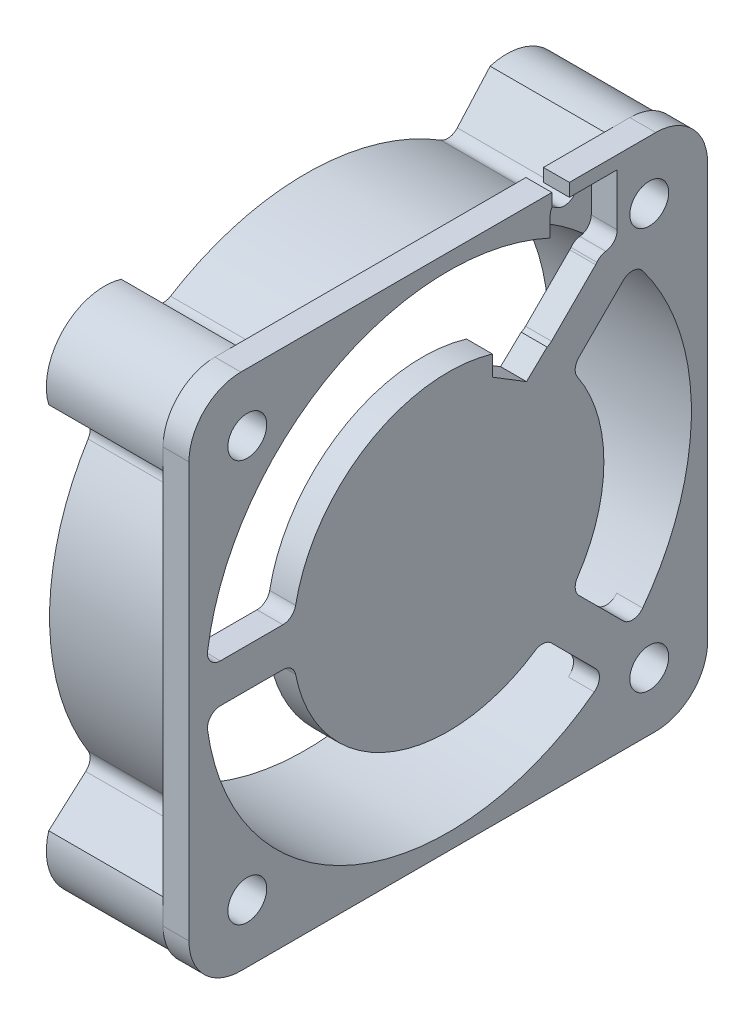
ISO-10303-21;
HEADER;
FILE_DESCRIPTION(('STEP AP214'),'2;1');
FILE_NAME('part.step','',(''),(''),'','','');
FILE_SCHEMA(('AUTOMOTIVE_DESIGN { 1 0 10303 214 1 1 1 1 }'));
ENDSEC;
DATA;
#1=APPLICATION_CONTEXT('core data for automotive mechanical design processes');
#2=APPLICATION_PROTOCOL_DEFINITION('international standard','automotive_design',2000,#1);
#3=PRODUCT_CONTEXT('',#1,'mechanical');
#4=PRODUCT('Part','Part','',(#3));
#5=PRODUCT_RELATED_PRODUCT_CATEGORY('part','',(#4));
#6=PRODUCT_DEFINITION_FORMATION('','',#4);
#7=PRODUCT_DEFINITION_CONTEXT('part definition',#1,'design');
#8=PRODUCT_DEFINITION('design','',#6,#7);
#9=PRODUCT_DEFINITION_SHAPE('','',#8);
#10=(LENGTH_UNIT() NAMED_UNIT(*) SI_UNIT(.MILLI.,.METRE.));
#11=(NAMED_UNIT(*) PLANE_ANGLE_UNIT() SI_UNIT($,.RADIAN.));
#12=(NAMED_UNIT(*) SI_UNIT($,.STERADIAN.) SOLID_ANGLE_UNIT());
#13=UNCERTAINTY_MEASURE_WITH_UNIT(LENGTH_MEASURE(1.E-05),#10,'distance_accuracy_value','');
#14=(GEOMETRIC_REPRESENTATION_CONTEXT(3) GLOBAL_UNCERTAINTY_ASSIGNED_CONTEXT((#13)) GLOBAL_UNIT_ASSIGNED_CONTEXT((#10,
#11,#12)) REPRESENTATION_CONTEXT('',''));
#15=CARTESIAN_POINT('',(0.,0.,0.));
#16=DIRECTION('',(0.,0.,1.));
#17=DIRECTION('',(1.,0.,0.));
#18=AXIS2_PLACEMENT_3D('',#15,#16,#17);
#19=CARTESIAN_POINT('',(-61.3,17.6279469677,10.9461402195));
#20=DIRECTION('',(-1.,0.,0.));
#21=DIRECTION('',(0.,0.,1.));
#22=AXIS2_PLACEMENT_3D('',#19,#20,#21);
#23=CYLINDRICAL_SURFACE('',#22,1.);
#24=CARTESIAN_POINT('',(-56.8,17.6279469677,10.9461402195));
#25=DIRECTION('',(-1.,0.,0.));
#26=DIRECTION('',(0.,0.,1.));
#27=AXIS2_PLACEMENT_3D('',#24,#25,#26);
#28=CIRCLE('',#27,1.);
#29=CARTESIAN_POINT('',(-56.8,16.7784073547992,10.4186153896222));
#30=VERTEX_POINT('',#29);
#31=CARTESIAN_POINT('',(-56.8,16.963827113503,11.6937663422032));
#32=VERTEX_POINT('',#31);
#33=EDGE_CURVE('E339',#30,#32,#28,.T.);
#34=ORIENTED_EDGE('',*,*,#33,.F.);
#35=DIRECTION('',(-1.,0.,0.));
#36=VECTOR('',#35,1.);
#37=CARTESIAN_POINT('',(-61.3,16.7784073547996,10.4186153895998));
#38=LINE('',#37,#36);
#39=CARTESIAN_POINT('',(-65.8,16.7784073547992,10.4186153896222));
#40=VERTEX_POINT('',#39);
#41=EDGE_CURVE('E341',#40,#30,#38,.F.);
#42=ORIENTED_EDGE('',*,*,#41,.F.);
#43=CARTESIAN_POINT('',(-65.8,17.6279469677,10.9461402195));
#44=DIRECTION('',(-1.,0.,0.));
#45=DIRECTION('',(0.,0.,1.));
#46=AXIS2_PLACEMENT_3D('',#43,#44,#45);
#47=CIRCLE('',#46,1.);
#48=CARTESIAN_POINT('',(-65.8,16.963827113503,11.6937663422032));
#49=VERTEX_POINT('',#48);
#50=EDGE_CURVE('E20',#49,#40,#47,.F.);
#51=ORIENTED_EDGE('',*,*,#50,.F.);
#52=DIRECTION('',(1.,0.,0.));
#53=VECTOR('',#52,1.);
#54=CARTESIAN_POINT('',(-65.8,16.9638271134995,11.6937663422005));
#55=LINE('',#54,#53);
#56=EDGE_CURVE('E344',#49,#32,#55,.T.);
#57=ORIENTED_EDGE('',*,*,#56,.T.);
#58=EDGE_LOOP('',(#34,#42,#51,#57));
#59=FACE_BOUND('',#58,.T.);
#60=ADVANCED_FACE('F17',(#59),#23,.F.);
#61=CARTESIAN_POINT('',(-61.3,10.9461402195,17.6279469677));
#62=DIRECTION('',(1.,0.,0.));
#63=DIRECTION('',(0.,0.,-1.));
#64=AXIS2_PLACEMENT_3D('',#61,#62,#63);
#65=CYLINDRICAL_SURFACE('',#64,1.);
#66=CARTESIAN_POINT('',(-56.8,10.9461402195,17.6279469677));
#67=DIRECTION('',(1.,0.,0.));
#68=DIRECTION('',(0.,0.,-1.));
#69=AXIS2_PLACEMENT_3D('',#66,#67,#68);
#70=CIRCLE('',#69,1.);
#71=CARTESIAN_POINT('',(-56.8,11.6937663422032,16.963827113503));
#72=VERTEX_POINT('',#71);
#73=CARTESIAN_POINT('',(-56.8,10.4186153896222,16.7784073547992));
#74=VERTEX_POINT('',#73);
#75=EDGE_CURVE('E406',#72,#74,#70,.F.);
#76=ORIENTED_EDGE('',*,*,#75,.F.);
#77=DIRECTION('',(1.,0.,0.));
#78=VECTOR('',#77,1.);
#79=CARTESIAN_POINT('',(-65.8,11.6937663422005,16.9638271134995));
#80=LINE('',#79,#78);
#81=CARTESIAN_POINT('',(-65.8,11.6937663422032,16.963827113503));
#82=VERTEX_POINT('',#81);
#83=EDGE_CURVE('E679',#82,#72,#80,.T.);
#84=ORIENTED_EDGE('',*,*,#83,.F.);
#85=CARTESIAN_POINT('',(-65.8,10.9461402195,17.6279469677));
#86=DIRECTION('',(1.,0.,0.));
#87=DIRECTION('',(0.,0.,-1.));
#88=AXIS2_PLACEMENT_3D('',#85,#86,#87);
#89=CIRCLE('',#88,1.);
#90=CARTESIAN_POINT('',(-65.8,10.4186153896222,16.7784073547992));
#91=VERTEX_POINT('',#90);
#92=EDGE_CURVE('E409',#91,#82,#89,.T.);
#93=ORIENTED_EDGE('',*,*,#92,.F.);
#94=DIRECTION('',(-1.,0.,0.));
#95=VECTOR('',#94,1.);
#96=CARTESIAN_POINT('',(-61.3,10.4186153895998,16.7784073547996));
#97=LINE('',#96,#95);
#98=EDGE_CURVE('E676',#74,#91,#97,.T.);
#99=ORIENTED_EDGE('',*,*,#98,.F.);
#100=EDGE_LOOP('',(#76,#84,#93,#99));
#101=FACE_BOUND('',#100,.T.);
#102=ADVANCED_FACE('F931',(#101),#65,.F.);
#103=CARTESIAN_POINT('',(-61.3,-10.9461402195,17.6279469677));
#104=DIRECTION('',(-1.,0.,0.));
#105=DIRECTION('',(0.,0.,1.));
#106=AXIS2_PLACEMENT_3D('',#103,#104,#105);
#107=CYLINDRICAL_SURFACE('',#106,1.);
#108=CARTESIAN_POINT('',(-56.8,-10.9461402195,17.6279469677));
#109=DIRECTION('',(-1.,0.,0.));
#110=DIRECTION('',(0.,0.,1.));
#111=AXIS2_PLACEMENT_3D('',#108,#109,#110);
#112=CIRCLE('',#111,1.);
#113=CARTESIAN_POINT('',(-56.8,-10.4186153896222,16.7784073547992));
#114=VERTEX_POINT('',#113);
#115=CARTESIAN_POINT('',(-56.8,-11.6937663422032,16.963827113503));
#116=VERTEX_POINT('',#115);
#117=EDGE_CURVE('E402',#114,#116,#112,.T.);
#118=ORIENTED_EDGE('',*,*,#117,.F.);
#119=DIRECTION('',(-1.,0.,0.));
#120=VECTOR('',#119,1.);
#121=CARTESIAN_POINT('',(-61.3,-10.4186153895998,16.7784073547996));
#122=LINE('',#121,#120);
#123=CARTESIAN_POINT('',(-65.8,-10.4186153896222,16.7784073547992));
#124=VERTEX_POINT('',#123);
#125=EDGE_CURVE('E673',#124,#114,#122,.F.);
#126=ORIENTED_EDGE('',*,*,#125,.F.);
#127=CARTESIAN_POINT('',(-65.8,-10.9461402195,17.6279469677));
#128=DIRECTION('',(-1.,0.,0.));
#129=DIRECTION('',(0.,0.,1.));
#130=AXIS2_PLACEMENT_3D('',#127,#128,#129);
#131=CIRCLE('',#130,1.);
#132=CARTESIAN_POINT('',(-65.8,-11.6937663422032,16.963827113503));
#133=VERTEX_POINT('',#132);
#134=EDGE_CURVE('E404',#133,#124,#131,.F.);
#135=ORIENTED_EDGE('',*,*,#134,.F.);
#136=DIRECTION('',(1.,0.,0.));
#137=VECTOR('',#136,1.);
#138=CARTESIAN_POINT('',(-65.8,-11.6937663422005,16.9638271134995));
#139=LINE('',#138,#137);
#140=EDGE_CURVE('E379',#133,#116,#139,.T.);
#141=ORIENTED_EDGE('',*,*,#140,.T.);
#142=EDGE_LOOP('',(#118,#126,#135,#141));
#143=FACE_BOUND('',#142,.T.);
#144=ADVANCED_FACE('F2645',(#143),#107,.F.);
#145=CARTESIAN_POINT('',(-61.3,-17.6279469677,10.9461402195));
#146=DIRECTION('',(1.,0.,0.));
#147=DIRECTION('',(0.,0.,-1.));
#148=AXIS2_PLACEMENT_3D('',#145,#146,#147);
#149=CYLINDRICAL_SURFACE('',#148,1.);
#150=CARTESIAN_POINT('',(-56.8,-17.6279469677,10.9461402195));
#151=DIRECTION('',(1.,0.,0.));
#152=DIRECTION('',(0.,0.,-1.));
#153=AXIS2_PLACEMENT_3D('',#150,#151,#152);
#154=CIRCLE('',#153,1.);
#155=CARTESIAN_POINT('',(-56.8,-16.963827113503,11.6937663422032));
#156=VERTEX_POINT('',#155);
#157=CARTESIAN_POINT('',(-56.8,-16.7784073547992,10.4186153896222));
#158=VERTEX_POINT('',#157);
#159=EDGE_CURVE('E397',#156,#158,#154,.F.);
#160=ORIENTED_EDGE('',*,*,#159,.F.);
#161=DIRECTION('',(1.,0.,0.));
#162=VECTOR('',#161,1.);
#163=CARTESIAN_POINT('',(-65.8,-16.9638271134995,11.6937663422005));
#164=LINE('',#163,#162);
#165=CARTESIAN_POINT('',(-65.8,-16.963827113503,11.6937663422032));
#166=VERTEX_POINT('',#165);
#167=EDGE_CURVE('E663',#166,#156,#164,.T.);
#168=ORIENTED_EDGE('',*,*,#167,.F.);
#169=CARTESIAN_POINT('',(-65.8,-17.6279469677,10.9461402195));
#170=DIRECTION('',(1.,0.,0.));
#171=DIRECTION('',(0.,0.,-1.));
#172=AXIS2_PLACEMENT_3D('',#169,#170,#171);
#173=CIRCLE('',#172,1.);
#174=CARTESIAN_POINT('',(-65.8,-16.7784073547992,10.4186153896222));
#175=VERTEX_POINT('',#174);
#176=EDGE_CURVE('E400',#175,#166,#173,.T.);
#177=ORIENTED_EDGE('',*,*,#176,.F.);
#178=DIRECTION('',(-1.,0.,0.));
#179=VECTOR('',#178,1.);
#180=CARTESIAN_POINT('',(-61.3,-16.7784073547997,10.4186153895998));
#181=LINE('',#180,#179);
#182=EDGE_CURVE('E660',#158,#175,#181,.T.);
#183=ORIENTED_EDGE('',*,*,#182,.F.);
#184=EDGE_LOOP('',(#160,#168,#177,#183));
#185=FACE_BOUND('',#184,.T.);
#186=ADVANCED_FACE('F2636',(#185),#149,.F.);
#187=CARTESIAN_POINT('',(-61.3,-17.6279469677,-10.9461402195));
#188=DIRECTION('',(-1.,0.,0.));
#189=DIRECTION('',(0.,0.,1.));
#190=AXIS2_PLACEMENT_3D('',#187,#188,#189);
#191=CYLINDRICAL_SURFACE('',#190,1.);
#192=CARTESIAN_POINT('',(-56.8,-17.6279469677,-10.9461402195));
#193=DIRECTION('',(-1.,0.,0.));
#194=DIRECTION('',(0.,0.,1.));
#195=AXIS2_PLACEMENT_3D('',#192,#193,#194);
#196=CIRCLE('',#195,1.);
#197=CARTESIAN_POINT('',(-56.8,-16.7784073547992,-10.4186153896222));
#198=VERTEX_POINT('',#197);
#199=CARTESIAN_POINT('',(-56.8,-16.963827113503,-11.6937663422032));
#200=VERTEX_POINT('',#199);
#201=EDGE_CURVE('E393',#198,#200,#196,.T.);
#202=ORIENTED_EDGE('',*,*,#201,.F.);
#203=DIRECTION('',(-1.,0.,0.));
#204=VECTOR('',#203,1.);
#205=CARTESIAN_POINT('',(-61.3,-16.7784073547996,-10.4186153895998));
#206=LINE('',#205,#204);
#207=CARTESIAN_POINT('',(-65.8,-16.7784073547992,-10.4186153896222));
#208=VERTEX_POINT('',#207);
#209=EDGE_CURVE('E657',#208,#198,#206,.F.);
#210=ORIENTED_EDGE('',*,*,#209,.F.);
#211=CARTESIAN_POINT('',(-65.8,-17.6279469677,-10.9461402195));
#212=DIRECTION('',(-1.,0.,0.));
#213=DIRECTION('',(0.,0.,1.));
#214=AXIS2_PLACEMENT_3D('',#211,#212,#213);
#215=CIRCLE('',#214,1.);
#216=CARTESIAN_POINT('',(-65.8,-16.963827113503,-11.6937663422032));
#217=VERTEX_POINT('',#216);
#218=EDGE_CURVE('E395',#217,#208,#215,.F.);
#219=ORIENTED_EDGE('',*,*,#218,.F.);
#220=DIRECTION('',(1.,0.,0.));
#221=VECTOR('',#220,1.);
#222=CARTESIAN_POINT('',(-65.8,-16.9638271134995,-11.6937663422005));
#223=LINE('',#222,#221);
#224=EDGE_CURVE('E375',#217,#200,#223,.T.);
#225=ORIENTED_EDGE('',*,*,#224,.T.);
#226=EDGE_LOOP('',(#202,#210,#219,#225));
#227=FACE_BOUND('',#226,.T.);
#228=ADVANCED_FACE('F2627',(#227),#191,.F.);
#229=CARTESIAN_POINT('',(-61.3,-10.9461402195,-17.6279469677));
#230=DIRECTION('',(1.,0.,0.));
#231=DIRECTION('',(0.,0.,-1.));
#232=AXIS2_PLACEMENT_3D('',#229,#230,#231);
#233=CYLINDRICAL_SURFACE('',#232,1.);
#234=CARTESIAN_POINT('',(-56.8,-10.9461402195,-17.6279469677));
#235=DIRECTION('',(1.,0.,0.));
#236=DIRECTION('',(0.,0.,-1.));
#237=AXIS2_PLACEMENT_3D('',#234,#235,#236);
#238=CIRCLE('',#237,1.);
#239=CARTESIAN_POINT('',(-56.8,-11.6937663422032,-16.963827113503));
#240=VERTEX_POINT('',#239);
#241=CARTESIAN_POINT('',(-56.8,-10.4186153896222,-16.7784073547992));
#242=VERTEX_POINT('',#241);
#243=EDGE_CURVE('E388',#240,#242,#238,.F.);
#244=ORIENTED_EDGE('',*,*,#243,.F.);
#245=DIRECTION('',(1.,0.,0.));
#246=VECTOR('',#245,1.);
#247=CARTESIAN_POINT('',(-65.8,-11.6937663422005,-16.9638271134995));
#248=LINE('',#247,#246);
#249=CARTESIAN_POINT('',(-65.8,-11.6937663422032,-16.963827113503));
#250=VERTEX_POINT('',#249);
#251=EDGE_CURVE('E647',#250,#240,#248,.T.);
#252=ORIENTED_EDGE('',*,*,#251,.F.);
#253=CARTESIAN_POINT('',(-65.8,-10.9461402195,-17.6279469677));
#254=DIRECTION('',(1.,0.,0.));
#255=DIRECTION('',(0.,0.,-1.));
#256=AXIS2_PLACEMENT_3D('',#253,#254,#255);
#257=CIRCLE('',#256,1.);
#258=CARTESIAN_POINT('',(-65.8,-10.4186153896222,-16.7784073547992));
#259=VERTEX_POINT('',#258);
#260=EDGE_CURVE('E391',#259,#250,#257,.T.);
#261=ORIENTED_EDGE('',*,*,#260,.F.);
#262=DIRECTION('',(-1.,0.,0.));
#263=VECTOR('',#262,1.);
#264=CARTESIAN_POINT('',(-61.3,-10.4186153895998,-16.7784073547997));
#265=LINE('',#264,#263);
#266=EDGE_CURVE('E644',#242,#259,#265,.T.);
#267=ORIENTED_EDGE('',*,*,#266,.F.);
#268=EDGE_LOOP('',(#244,#252,#261,#267));
#269=FACE_BOUND('',#268,.T.);
#270=ADVANCED_FACE('F2618',(#269),#233,.F.);
#271=CARTESIAN_POINT('',(-61.3,10.9461402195,-17.6279469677));
#272=DIRECTION('',(-1.,0.,0.));
#273=DIRECTION('',(0.,0.,1.));
#274=AXIS2_PLACEMENT_3D('',#271,#272,#273);
#275=CYLINDRICAL_SURFACE('',#274,1.);
#276=CARTESIAN_POINT('',(-56.8,10.9461402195,-17.6279469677));
#277=DIRECTION('',(-1.,0.,0.));
#278=DIRECTION('',(0.,0.,1.));
#279=AXIS2_PLACEMENT_3D('',#276,#277,#278);
#280=CIRCLE('',#279,1.);
#281=CARTESIAN_POINT('',(-56.8,10.4186153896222,-16.7784073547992));
#282=VERTEX_POINT('',#281);
#283=CARTESIAN_POINT('',(-56.8,11.6937663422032,-16.963827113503));
#284=VERTEX_POINT('',#283);
#285=EDGE_CURVE('E384',#282,#284,#280,.T.);
#286=ORIENTED_EDGE('',*,*,#285,.F.);
#287=DIRECTION('',(-1.,0.,0.));
#288=VECTOR('',#287,1.);
#289=CARTESIAN_POINT('',(-61.3,10.4186153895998,-16.7784073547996));
#290=LINE('',#289,#288);
#291=CARTESIAN_POINT('',(-65.8,10.4186153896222,-16.7784073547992));
#292=VERTEX_POINT('',#291);
#293=EDGE_CURVE('E641',#292,#282,#290,.F.);
#294=ORIENTED_EDGE('',*,*,#293,.F.);
#295=CARTESIAN_POINT('',(-65.8,10.9461402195,-17.6279469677));
#296=DIRECTION('',(-1.,0.,0.));
#297=DIRECTION('',(0.,0.,1.));
#298=AXIS2_PLACEMENT_3D('',#295,#296,#297);
#299=CIRCLE('',#298,1.);
#300=CARTESIAN_POINT('',(-65.8,11.6937663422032,-16.963827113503));
#301=VERTEX_POINT('',#300);
#302=EDGE_CURVE('E386',#301,#292,#299,.F.);
#303=ORIENTED_EDGE('',*,*,#302,.F.);
#304=DIRECTION('',(1.,0.,0.));
#305=VECTOR('',#304,1.);
#306=CARTESIAN_POINT('',(-65.8,11.6937663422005,-16.9638271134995));
#307=LINE('',#306,#305);
#308=EDGE_CURVE('E371',#301,#284,#307,.T.);
#309=ORIENTED_EDGE('',*,*,#308,.T.);
#310=EDGE_LOOP('',(#286,#294,#303,#309));
#311=FACE_BOUND('',#310,.T.);
#312=ADVANCED_FACE('F2609',(#311),#275,.F.);
#313=CARTESIAN_POINT('',(-61.3,17.6279469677,-10.9461402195));
#314=DIRECTION('',(1.,0.,0.));
#315=DIRECTION('',(0.,0.,-1.));
#316=AXIS2_PLACEMENT_3D('',#313,#314,#315);
#317=CYLINDRICAL_SURFACE('',#316,1.);
#318=CARTESIAN_POINT('',(-56.8,17.6279469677,-10.9461402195));
#319=DIRECTION('',(1.,0.,0.));
#320=DIRECTION('',(0.,0.,-1.));
#321=AXIS2_PLACEMENT_3D('',#318,#319,#320);
#322=CIRCLE('',#321,1.);
#323=CARTESIAN_POINT('',(-56.8,16.9638271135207,-11.6937663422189));
#324=VERTEX_POINT('',#323);
#325=CARTESIAN_POINT('',(-56.8,16.7784073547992,-10.4186153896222));
#326=VERTEX_POINT('',#325);
#327=EDGE_CURVE('E345',#324,#326,#322,.F.);
#328=ORIENTED_EDGE('',*,*,#327,.F.);
#329=DIRECTION('',(1.,0.,0.));
#330=VECTOR('',#329,1.);
#331=CARTESIAN_POINT('',(-65.8,16.9638271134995,-11.6937663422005));
#332=LINE('',#331,#330);
#333=CARTESIAN_POINT('',(-65.8,16.963827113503,-11.6937663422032));
#334=VERTEX_POINT('',#333);
#335=EDGE_CURVE('E365',#334,#324,#332,.T.);
#336=ORIENTED_EDGE('',*,*,#335,.F.);
#337=CARTESIAN_POINT('',(-65.8,17.6279469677,-10.9461402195));
#338=DIRECTION('',(1.,0.,0.));
#339=DIRECTION('',(0.,0.,-1.));
#340=AXIS2_PLACEMENT_3D('',#337,#338,#339);
#341=CIRCLE('',#340,1.);
#342=CARTESIAN_POINT('',(-65.8,16.7784073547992,-10.4186153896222));
#343=VERTEX_POINT('',#342);
#344=EDGE_CURVE('E382',#343,#334,#341,.T.);
#345=ORIENTED_EDGE('',*,*,#344,.F.);
#346=DIRECTION('',(-1.,0.,0.));
#347=VECTOR('',#346,1.);
#348=CARTESIAN_POINT('',(-61.3,16.7784073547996,-10.4186153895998));
#349=LINE('',#348,#347);
#350=EDGE_CURVE('E351',#326,#343,#349,.T.);
#351=ORIENTED_EDGE('',*,*,#350,.F.);
#352=EDGE_LOOP('',(#328,#336,#345,#351));
#353=FACE_BOUND('',#352,.T.);
#354=ADVANCED_FACE('F2600',(#353),#317,.F.);
#355=CARTESIAN_POINT('',(-60.8,0.,0.));
#356=DIRECTION('',(-1.,0.,0.));
#357=DIRECTION('',(0.,0.,1.));
#358=AXIS2_PLACEMENT_3D('',#355,#356,#357);
#359=PLANE('',#358);
#360=CARTESIAN_POINT('',(-60.8,0.,0.));
#361=DIRECTION('',(-1.,0.,0.));
#362=DIRECTION('',(0.,0.,1.));
#363=AXIS2_PLACEMENT_3D('',#360,#361,#362);
#364=CIRCLE('',#363,1.5);
#365=CARTESIAN_POINT('',(-60.8,0.,1.5));
#366=VERTEX_POINT('',#365);
#367=EDGE_CURVE('E584',#366,#366,#364,.F.);
#368=ORIENTED_EDGE('',*,*,#367,.F.);
#369=EDGE_LOOP('',(#368));
#370=FACE_BOUND('',#369,.T.);
#371=ADVANCED_FACE('F2592',(#370),#359,.T.);
#372=CARTESIAN_POINT('',(-65.8,19.8163993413,14.2277198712));
#373=DIRECTION('',(0.,-0.664119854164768,0.747626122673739));
#374=DIRECTION('',(0.,-0.747626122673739,-0.664119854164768));
#375=AXIS2_PLACEMENT_3D('',#372,#373,#374);
#376=PLANE('',#375);
#377=DIRECTION('',(0.,0.747626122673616,0.664119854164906));
#378=VECTOR('',#377,1.);
#379=CARTESIAN_POINT('',(-65.8,16.9638271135,11.6937663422));
#380=LINE('',#379,#378);
#381=CARTESIAN_POINT('',(-65.8,19.8163993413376,14.2277198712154));
#382=VERTEX_POINT('',#381);
#383=EDGE_CURVE('E338',#49,#382,#380,.T.);
#384=ORIENTED_EDGE('',*,*,#383,.T.);
#385=DIRECTION('',(-1.,0.,0.));
#386=VECTOR('',#385,1.);
#387=CARTESIAN_POINT('',(-61.3,19.8163993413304,14.227719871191));
#388=LINE('',#387,#386);
#389=CARTESIAN_POINT('',(-56.8,19.8163993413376,14.2277198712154));
#390=VERTEX_POINT('',#389);
#391=EDGE_CURVE('E380',#390,#382,#388,.T.);
#392=ORIENTED_EDGE('',*,*,#391,.F.);
#393=DIRECTION('',(0.,0.747626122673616,0.664119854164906));
#394=VECTOR('',#393,1.);
#395=CARTESIAN_POINT('',(-56.8,16.9638271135,11.6937663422));
#396=LINE('',#395,#394);
#397=EDGE_CURVE('E416',#32,#390,#396,.T.);
#398=ORIENTED_EDGE('',*,*,#397,.F.);
#399=ORIENTED_EDGE('',*,*,#56,.F.);
#400=EDGE_LOOP('',(#384,#392,#398,#399));
#401=FACE_BOUND('',#400,.T.);
#402=ADVANCED_FACE('F421',(#401),#376,.F.);
#403=CARTESIAN_POINT('',(-61.3,15.5,15.5));
#404=DIRECTION('',(-1.,0.,0.));
#405=DIRECTION('',(0.,0.,1.));
#406=AXIS2_PLACEMENT_3D('',#403,#404,#405);
#407=CYLINDRICAL_SURFACE('',#406,4.5);
#408=DIRECTION('',(1.,0.,0.));
#409=VECTOR('',#408,1.);
#410=CARTESIAN_POINT('',(-65.8,14.2277198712,19.8163993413));
#411=LINE('',#410,#409);
#412=CARTESIAN_POINT('',(-56.8,14.2277198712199,19.8163993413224));
#413=VERTEX_POINT('',#412);
#414=CARTESIAN_POINT('',(-65.8,14.2277198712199,19.8163993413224));
#415=VERTEX_POINT('',#414);
#416=EDGE_CURVE('E680',#413,#415,#411,.F.);
#417=ORIENTED_EDGE('',*,*,#416,.F.);
#418=CARTESIAN_POINT('',(-56.8,15.5,15.5));
#419=DIRECTION('',(-1.,0.,0.));
#420=DIRECTION('',(0.,0.,1.));
#421=AXIS2_PLACEMENT_3D('',#418,#419,#420);
#422=CIRCLE('',#421,4.5);
#423=CARTESIAN_POINT('',(-56.8,15.5,20.));
#424=VERTEX_POINT('',#423);
#425=EDGE_CURVE('E377',#413,#424,#422,.T.);
#426=ORIENTED_EDGE('',*,*,#425,.T.);
#427=CARTESIAN_POINT('',(-56.8,15.5,15.5));
#428=DIRECTION('',(-1.,0.,0.));
#429=DIRECTION('',(0.,0.,1.));
#430=AXIS2_PLACEMENT_3D('',#427,#428,#429);
#431=CIRCLE('',#430,4.5);
#432=CARTESIAN_POINT('',(-56.8,20.,15.5));
#433=VERTEX_POINT('',#432);
#434=EDGE_CURVE('E908',#433,#424,#431,.F.);
#435=ORIENTED_EDGE('',*,*,#434,.F.);
#436=CARTESIAN_POINT('',(-56.8,15.5,15.5));
#437=DIRECTION('',(-1.,0.,0.));
#438=DIRECTION('',(0.,0.,1.));
#439=AXIS2_PLACEMENT_3D('',#436,#437,#438);
#440=CIRCLE('',#439,4.5);
#441=EDGE_CURVE('E424',#390,#433,#440,.F.);
#442=ORIENTED_EDGE('',*,*,#441,.F.);
#443=ORIENTED_EDGE('',*,*,#391,.T.);
#444=CARTESIAN_POINT('',(-65.8,15.5,15.5));
#445=DIRECTION('',(-1.,0.,0.));
#446=DIRECTION('',(0.,0.,1.));
#447=AXIS2_PLACEMENT_3D('',#444,#445,#446);
#448=CIRCLE('',#447,4.5);
#449=EDGE_CURVE('E354',#382,#415,#448,.F.);
#450=ORIENTED_EDGE('',*,*,#449,.T.);
#451=EDGE_LOOP('',(#417,#426,#435,#442,#443,#450));
#452=FACE_BOUND('',#451,.T.);
#453=ADVANCED_FACE('F938',(#452),#407,.T.);
#454=CARTESIAN_POINT('',(-65.8,-14.2277198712,19.8163993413));
#455=DIRECTION('',(0.,-0.747626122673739,-0.664119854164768));
#456=DIRECTION('',(0.,0.664119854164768,-0.747626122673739));
#457=AXIS2_PLACEMENT_3D('',#454,#455,#456);
#458=PLANE('',#457);
#459=DIRECTION('',(0.,-0.664119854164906,0.747626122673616));
#460=VECTOR('',#459,1.);
#461=CARTESIAN_POINT('',(-65.8,-11.6937663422,16.9638271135));
#462=LINE('',#461,#460);
#463=CARTESIAN_POINT('',(-65.8,-14.2277198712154,19.8163993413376));
#464=VERTEX_POINT('',#463);
#465=EDGE_CURVE('E620',#133,#464,#462,.T.);
#466=ORIENTED_EDGE('',*,*,#465,.T.);
#467=DIRECTION('',(-1.,0.,0.));
#468=VECTOR('',#467,1.);
#469=CARTESIAN_POINT('',(-61.3,-14.227719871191,19.8163993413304));
#470=LINE('',#469,#468);
#471=CARTESIAN_POINT('',(-56.8,-14.2277198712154,19.8163993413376));
#472=VERTEX_POINT('',#471);
#473=EDGE_CURVE('E376',#472,#464,#470,.T.);
#474=ORIENTED_EDGE('',*,*,#473,.F.);
#475=DIRECTION('',(0.,-0.664119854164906,0.747626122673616));
#476=VECTOR('',#475,1.);
#477=CARTESIAN_POINT('',(-56.8,-11.6937663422,16.9638271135));
#478=LINE('',#477,#476);
#479=EDGE_CURVE('E907',#116,#472,#478,.T.);
#480=ORIENTED_EDGE('',*,*,#479,.F.);
#481=ORIENTED_EDGE('',*,*,#140,.F.);
#482=EDGE_LOOP('',(#466,#474,#480,#481));
#483=FACE_BOUND('',#482,.T.);
#484=ADVANCED_FACE('F2569',(#483),#458,.F.);
#485=CARTESIAN_POINT('',(-65.8,14.2277198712,19.8163993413));
#486=DIRECTION('',(0.,-0.747626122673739,0.664119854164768));
#487=DIRECTION('',(0.,-0.664119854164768,-0.747626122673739));
#488=AXIS2_PLACEMENT_3D('',#485,#486,#487);
#489=PLANE('',#488);
#490=DIRECTION('',(0.,-0.664119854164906,-0.747626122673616));
#491=VECTOR('',#490,1.);
#492=CARTESIAN_POINT('',(-65.8,14.2277198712,19.8163993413));
#493=LINE('',#492,#491);
#494=EDGE_CURVE('E623',#415,#82,#493,.T.);
#495=ORIENTED_EDGE('',*,*,#494,.T.);
#496=ORIENTED_EDGE('',*,*,#83,.T.);
#497=DIRECTION('',(0.,-0.664119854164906,-0.747626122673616));
#498=VECTOR('',#497,1.);
#499=CARTESIAN_POINT('',(-56.8,14.2277198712,19.8163993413));
#500=LINE('',#499,#498);
#501=EDGE_CURVE('E903',#413,#72,#500,.T.);
#502=ORIENTED_EDGE('',*,*,#501,.F.);
#503=ORIENTED_EDGE('',*,*,#416,.T.);
#504=EDGE_LOOP('',(#495,#496,#502,#503));
#505=FACE_BOUND('',#504,.T.);
#506=ADVANCED_FACE('F935',(#505),#489,.T.);
#507=CARTESIAN_POINT('',(-61.3,0.,0.));
#508=DIRECTION('',(-1.,0.,0.));
#509=DIRECTION('',(0.,0.,1.));
#510=AXIS2_PLACEMENT_3D('',#507,#508,#509);
#511=CYLINDRICAL_SURFACE('',#510,19.75);
#512=CARTESIAN_POINT('',(-65.8,0.,0.));
#513=DIRECTION('',(-1.,0.,0.));
#514=DIRECTION('',(0.,0.,1.));
#515=AXIS2_PLACEMENT_3D('',#512,#513,#514);
#516=CIRCLE('',#515,19.75);
#517=EDGE_CURVE('E622',#91,#124,#516,.F.);
#518=ORIENTED_EDGE('',*,*,#517,.T.);
#519=ORIENTED_EDGE('',*,*,#125,.T.);
#520=CARTESIAN_POINT('',(-56.8,0.,0.));
#521=DIRECTION('',(-1.,0.,0.));
#522=DIRECTION('',(0.,0.,1.));
#523=AXIS2_PLACEMENT_3D('',#520,#521,#522);
#524=CIRCLE('',#523,19.75);
#525=EDGE_CURVE('E900',#74,#114,#524,.F.);
#526=ORIENTED_EDGE('',*,*,#525,.F.);
#527=ORIENTED_EDGE('',*,*,#98,.T.);
#528=EDGE_LOOP('',(#518,#519,#526,#527));
#529=FACE_BOUND('',#528,.T.);
#530=ADVANCED_FACE('F923',(#529),#511,.T.);
#531=CARTESIAN_POINT('',(-61.3,-15.5,15.5));
#532=DIRECTION('',(-1.,0.,0.));
#533=DIRECTION('',(0.,0.,1.));
#534=AXIS2_PLACEMENT_3D('',#531,#532,#533);
#535=CYLINDRICAL_SURFACE('',#534,4.5);
#536=CARTESIAN_POINT('',(-56.8,-15.5,15.5));
#537=DIRECTION('',(-1.,0.,0.));
#538=DIRECTION('',(0.,0.,1.));
#539=AXIS2_PLACEMENT_3D('',#536,#537,#538);
#540=CIRCLE('',#539,4.5);
#541=CARTESIAN_POINT('',(-56.8,-15.5,20.));
#542=VERTEX_POINT('',#541);
#543=CARTESIAN_POINT('',(-56.8,-20.,15.5));
#544=VERTEX_POINT('',#543);
#545=EDGE_CURVE('E896',#542,#544,#540,.F.);
#546=ORIENTED_EDGE('',*,*,#545,.F.);
#547=CARTESIAN_POINT('',(-56.8,-15.5,15.5));
#548=DIRECTION('',(-1.,0.,0.));
#549=DIRECTION('',(0.,0.,1.));
#550=AXIS2_PLACEMENT_3D('',#547,#548,#549);
#551=CIRCLE('',#550,4.5);
#552=EDGE_CURVE('E904',#472,#542,#551,.F.);
#553=ORIENTED_EDGE('',*,*,#552,.F.);
#554=ORIENTED_EDGE('',*,*,#473,.T.);
#555=CARTESIAN_POINT('',(-65.8,-15.5,15.5));
#556=DIRECTION('',(-1.,0.,0.));
#557=DIRECTION('',(0.,0.,1.));
#558=AXIS2_PLACEMENT_3D('',#555,#556,#557);
#559=CIRCLE('',#558,4.5);
#560=CARTESIAN_POINT('',(-65.8,-19.8163993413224,14.2277198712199));
#561=VERTEX_POINT('',#560);
#562=EDGE_CURVE('E619',#464,#561,#559,.F.);
#563=ORIENTED_EDGE('',*,*,#562,.T.);
#564=DIRECTION('',(1.,0.,0.));
#565=VECTOR('',#564,1.);
#566=CARTESIAN_POINT('',(-65.8,-19.8163993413,14.2277198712));
#567=LINE('',#566,#565);
#568=CARTESIAN_POINT('',(-56.8,-19.8163993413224,14.2277198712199));
#569=VERTEX_POINT('',#568);
#570=EDGE_CURVE('E664',#569,#561,#567,.F.);
#571=ORIENTED_EDGE('',*,*,#570,.F.);
#572=CARTESIAN_POINT('',(-56.8,-15.5,15.5));
#573=DIRECTION('',(-1.,0.,0.));
#574=DIRECTION('',(0.,0.,1.));
#575=AXIS2_PLACEMENT_3D('',#572,#573,#574);
#576=CIRCLE('',#575,4.5);
#577=EDGE_CURVE('E373',#569,#544,#576,.T.);
#578=ORIENTED_EDGE('',*,*,#577,.T.);
#579=EDGE_LOOP('',(#546,#553,#554,#563,#571,#578));
#580=FACE_BOUND('',#579,.T.);
#581=ADVANCED_FACE('F2545',(#580),#535,.T.);
#582=CARTESIAN_POINT('',(-65.8,-19.8163993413,-14.2277198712));
#583=DIRECTION('',(0.,0.664119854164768,-0.747626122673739));
#584=DIRECTION('',(0.,0.747626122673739,0.664119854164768));
#585=AXIS2_PLACEMENT_3D('',#582,#583,#584);
#586=PLANE('',#585);
#587=DIRECTION('',(0.,-0.747626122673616,-0.664119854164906));
#588=VECTOR('',#587,1.);
#589=CARTESIAN_POINT('',(-65.8,-16.9638271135,-11.6937663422));
#590=LINE('',#589,#588);
#591=CARTESIAN_POINT('',(-65.8,-19.8163993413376,-14.2277198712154));
#592=VERTEX_POINT('',#591);
#593=EDGE_CURVE('E613',#217,#592,#590,.T.);
#594=ORIENTED_EDGE('',*,*,#593,.T.);
#595=DIRECTION('',(-1.,0.,0.));
#596=VECTOR('',#595,1.);
#597=CARTESIAN_POINT('',(-61.3,-19.8163993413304,-14.227719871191));
#598=LINE('',#597,#596);
#599=CARTESIAN_POINT('',(-56.8,-19.8163993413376,-14.2277198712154));
#600=VERTEX_POINT('',#599);
#601=EDGE_CURVE('E372',#600,#592,#598,.T.);
#602=ORIENTED_EDGE('',*,*,#601,.F.);
#603=DIRECTION('',(0.,-0.747626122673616,-0.664119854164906));
#604=VECTOR('',#603,1.);
#605=CARTESIAN_POINT('',(-56.8,-16.9638271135,-11.6937663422));
#606=LINE('',#605,#604);
#607=EDGE_CURVE('E895',#200,#600,#606,.T.);
#608=ORIENTED_EDGE('',*,*,#607,.F.);
#609=ORIENTED_EDGE('',*,*,#224,.F.);
#610=EDGE_LOOP('',(#594,#602,#608,#609));
#611=FACE_BOUND('',#610,.T.);
#612=ADVANCED_FACE('F2536',(#611),#586,.F.);
#613=CARTESIAN_POINT('',(-65.8,-19.8163993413,14.2277198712));
#614=DIRECTION('',(0.,-0.664119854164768,-0.747626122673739));
#615=DIRECTION('',(0.,0.747626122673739,-0.664119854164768));
#616=AXIS2_PLACEMENT_3D('',#613,#614,#615);
#617=PLANE('',#616);
#618=DIRECTION('',(0.,0.747626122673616,-0.664119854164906));
#619=VECTOR('',#618,1.);
#620=CARTESIAN_POINT('',(-65.8,-19.8163993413,14.2277198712));
#621=LINE('',#620,#619);
#622=EDGE_CURVE('E616',#561,#166,#621,.T.);
#623=ORIENTED_EDGE('',*,*,#622,.T.);
#624=ORIENTED_EDGE('',*,*,#167,.T.);
#625=DIRECTION('',(0.,0.747626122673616,-0.664119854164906));
#626=VECTOR('',#625,1.);
#627=CARTESIAN_POINT('',(-56.8,-19.8163993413,14.2277198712));
#628=LINE('',#627,#626);
#629=EDGE_CURVE('E891',#569,#156,#628,.T.);
#630=ORIENTED_EDGE('',*,*,#629,.F.);
#631=ORIENTED_EDGE('',*,*,#570,.T.);
#632=EDGE_LOOP('',(#623,#624,#630,#631));
#633=FACE_BOUND('',#632,.T.);
#634=ADVANCED_FACE('F2527',(#633),#617,.T.);
#635=CARTESIAN_POINT('',(-61.3,0.,0.));
#636=DIRECTION('',(-1.,0.,0.));
#637=DIRECTION('',(0.,0.,1.));
#638=AXIS2_PLACEMENT_3D('',#635,#636,#637);
#639=CYLINDRICAL_SURFACE('',#638,19.75);
#640=CARTESIAN_POINT('',(-65.8,0.,0.));
#641=DIRECTION('',(-1.,0.,0.));
#642=DIRECTION('',(0.,0.,1.));
#643=AXIS2_PLACEMENT_3D('',#640,#641,#642);
#644=CIRCLE('',#643,19.75);
#645=EDGE_CURVE('E615',#175,#208,#644,.F.);
#646=ORIENTED_EDGE('',*,*,#645,.T.);
#647=ORIENTED_EDGE('',*,*,#209,.T.);
#648=CARTESIAN_POINT('',(-56.8,0.,0.));
#649=DIRECTION('',(-1.,0.,0.));
#650=DIRECTION('',(0.,0.,1.));
#651=AXIS2_PLACEMENT_3D('',#648,#649,#650);
#652=CIRCLE('',#651,19.75);
#653=EDGE_CURVE('E888',#158,#198,#652,.F.);
#654=ORIENTED_EDGE('',*,*,#653,.F.);
#655=ORIENTED_EDGE('',*,*,#182,.T.);
#656=EDGE_LOOP('',(#646,#647,#654,#655));
#657=FACE_BOUND('',#656,.T.);
#658=ADVANCED_FACE('F2518',(#657),#639,.T.);
#659=CARTESIAN_POINT('',(-61.3,-15.5,-15.5));
#660=DIRECTION('',(-1.,0.,0.));
#661=DIRECTION('',(0.,0.,1.));
#662=AXIS2_PLACEMENT_3D('',#659,#660,#661);
#663=CYLINDRICAL_SURFACE('',#662,4.5);
#664=CARTESIAN_POINT('',(-56.8,-15.5,-15.5));
#665=DIRECTION('',(-1.,0.,0.));
#666=DIRECTION('',(0.,0.,1.));
#667=AXIS2_PLACEMENT_3D('',#664,#665,#666);
#668=CIRCLE('',#667,4.5);
#669=CARTESIAN_POINT('',(-56.8,-20.,-15.5));
#670=VERTEX_POINT('',#669);
#671=CARTESIAN_POINT('',(-56.8,-15.5,-20.));
#672=VERTEX_POINT('',#671);
#673=EDGE_CURVE('E884',#670,#672,#668,.F.);
#674=ORIENTED_EDGE('',*,*,#673,.F.);
#675=CARTESIAN_POINT('',(-56.8,-15.5,-15.5));
#676=DIRECTION('',(-1.,0.,0.));
#677=DIRECTION('',(0.,0.,1.));
#678=AXIS2_PLACEMENT_3D('',#675,#676,#677);
#679=CIRCLE('',#678,4.5);
#680=EDGE_CURVE('E892',#600,#670,#679,.F.);
#681=ORIENTED_EDGE('',*,*,#680,.F.);
#682=ORIENTED_EDGE('',*,*,#601,.T.);
#683=CARTESIAN_POINT('',(-65.8,-15.5,-15.5));
#684=DIRECTION('',(-1.,0.,0.));
#685=DIRECTION('',(0.,0.,1.));
#686=AXIS2_PLACEMENT_3D('',#683,#684,#685);
#687=CIRCLE('',#686,4.5);
#688=CARTESIAN_POINT('',(-65.8,-14.2277198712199,-19.8163993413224));
#689=VERTEX_POINT('',#688);
#690=EDGE_CURVE('E612',#592,#689,#687,.F.);
#691=ORIENTED_EDGE('',*,*,#690,.T.);
#692=DIRECTION('',(1.,0.,0.));
#693=VECTOR('',#692,1.);
#694=CARTESIAN_POINT('',(-65.8,-14.2277198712,-19.8163993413));
#695=LINE('',#694,#693);
#696=CARTESIAN_POINT('',(-56.8,-14.2277198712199,-19.8163993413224));
#697=VERTEX_POINT('',#696);
#698=EDGE_CURVE('E648',#697,#689,#695,.F.);
#699=ORIENTED_EDGE('',*,*,#698,.F.);
#700=CARTESIAN_POINT('',(-56.8,-15.5,-15.5));
#701=DIRECTION('',(-1.,0.,0.));
#702=DIRECTION('',(0.,0.,1.));
#703=AXIS2_PLACEMENT_3D('',#700,#701,#702);
#704=CIRCLE('',#703,4.5);
#705=EDGE_CURVE('E369',#697,#672,#704,.T.);
#706=ORIENTED_EDGE('',*,*,#705,.T.);
#707=EDGE_LOOP('',(#674,#681,#682,#691,#699,#706));
#708=FACE_BOUND('',#707,.T.);
#709=ADVANCED_FACE('F2509',(#708),#663,.T.);
#710=CARTESIAN_POINT('',(-65.8,14.2277198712,-19.8163993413));
#711=DIRECTION('',(0.,0.747626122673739,0.664119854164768));
#712=DIRECTION('',(0.,-0.664119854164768,0.747626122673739));
#713=AXIS2_PLACEMENT_3D('',#710,#711,#712);
#714=PLANE('',#713);
#715=DIRECTION('',(0.,0.664119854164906,-0.747626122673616));
#716=VECTOR('',#715,1.);
#717=CARTESIAN_POINT('',(-65.8,11.6937663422,-16.9638271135));
#718=LINE('',#717,#716);
#719=CARTESIAN_POINT('',(-65.8,14.2277198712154,-19.8163993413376));
#720=VERTEX_POINT('',#719);
#721=EDGE_CURVE('E606',#301,#720,#718,.T.);
#722=ORIENTED_EDGE('',*,*,#721,.T.);
#723=DIRECTION('',(-1.,0.,0.));
#724=VECTOR('',#723,1.);
#725=CARTESIAN_POINT('',(-61.3,14.227719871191,-19.8163993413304));
#726=LINE('',#725,#724);
#727=CARTESIAN_POINT('',(-56.8,14.2277198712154,-19.8163993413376));
#728=VERTEX_POINT('',#727);
#729=EDGE_CURVE('E368',#728,#720,#726,.T.);
#730=ORIENTED_EDGE('',*,*,#729,.F.);
#731=DIRECTION('',(0.,0.664119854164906,-0.747626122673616));
#732=VECTOR('',#731,1.);
#733=CARTESIAN_POINT('',(-56.8,11.6937663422,-16.9638271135));
#734=LINE('',#733,#732);
#735=EDGE_CURVE('E883',#284,#728,#734,.T.);
#736=ORIENTED_EDGE('',*,*,#735,.F.);
#737=ORIENTED_EDGE('',*,*,#308,.F.);
#738=EDGE_LOOP('',(#722,#730,#736,#737));
#739=FACE_BOUND('',#738,.T.);
#740=ADVANCED_FACE('F2500',(#739),#714,.F.);
#741=CARTESIAN_POINT('',(-65.8,-14.2277198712,-19.8163993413));
#742=DIRECTION('',(0.,0.747626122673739,-0.664119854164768));
#743=DIRECTION('',(0.,0.664119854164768,0.747626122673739));
#744=AXIS2_PLACEMENT_3D('',#741,#742,#743);
#745=PLANE('',#744);
#746=DIRECTION('',(0.,0.664119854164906,0.747626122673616));
#747=VECTOR('',#746,1.);
#748=CARTESIAN_POINT('',(-65.8,-14.2277198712,-19.8163993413));
#749=LINE('',#748,#747);
#750=EDGE_CURVE('E609',#689,#250,#749,.T.);
#751=ORIENTED_EDGE('',*,*,#750,.T.);
#752=ORIENTED_EDGE('',*,*,#251,.T.);
#753=DIRECTION('',(0.,0.664119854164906,0.747626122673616));
#754=VECTOR('',#753,1.);
#755=CARTESIAN_POINT('',(-56.8,-14.2277198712,-19.8163993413));
#756=LINE('',#755,#754);
#757=EDGE_CURVE('E879',#697,#240,#756,.T.);
#758=ORIENTED_EDGE('',*,*,#757,.F.);
#759=ORIENTED_EDGE('',*,*,#698,.T.);
#760=EDGE_LOOP('',(#751,#752,#758,#759));
#761=FACE_BOUND('',#760,.T.);
#762=ADVANCED_FACE('F2491',(#761),#745,.T.);
#763=CARTESIAN_POINT('',(-61.3,0.,0.));
#764=DIRECTION('',(-1.,0.,0.));
#765=DIRECTION('',(0.,0.,1.));
#766=AXIS2_PLACEMENT_3D('',#763,#764,#765);
#767=CYLINDRICAL_SURFACE('',#766,19.75);
#768=CARTESIAN_POINT('',(-65.8,0.,0.));
#769=DIRECTION('',(-1.,0.,0.));
#770=DIRECTION('',(0.,0.,1.));
#771=AXIS2_PLACEMENT_3D('',#768,#769,#770);
#772=CIRCLE('',#771,19.75);
#773=EDGE_CURVE('E608',#259,#292,#772,.F.);
#774=ORIENTED_EDGE('',*,*,#773,.T.);
#775=ORIENTED_EDGE('',*,*,#293,.T.);
#776=CARTESIAN_POINT('',(-56.8,0.,0.));
#777=DIRECTION('',(-1.,0.,0.));
#778=DIRECTION('',(0.,0.,1.));
#779=AXIS2_PLACEMENT_3D('',#776,#777,#778);
#780=CIRCLE('',#779,19.75);
#781=EDGE_CURVE('E876',#242,#282,#780,.F.);
#782=ORIENTED_EDGE('',*,*,#781,.F.);
#783=ORIENTED_EDGE('',*,*,#266,.T.);
#784=EDGE_LOOP('',(#774,#775,#782,#783));
#785=FACE_BOUND('',#784,.T.);
#786=ADVANCED_FACE('F2482',(#785),#767,.T.);
#787=CARTESIAN_POINT('',(-61.3,15.5,-15.5));
#788=DIRECTION('',(-1.,0.,0.));
#789=DIRECTION('',(0.,0.,1.));
#790=AXIS2_PLACEMENT_3D('',#787,#788,#789);
#791=CYLINDRICAL_SURFACE('',#790,4.5);
#792=CARTESIAN_POINT('',(-56.8,15.5,-15.5));
#793=DIRECTION('',(-1.,0.,0.));
#794=DIRECTION('',(0.,0.,1.));
#795=AXIS2_PLACEMENT_3D('',#792,#793,#794);
#796=CIRCLE('',#795,4.5);
#797=CARTESIAN_POINT('',(-56.8,15.5,-20.));
#798=VERTEX_POINT('',#797);
#799=CARTESIAN_POINT('',(-56.8,20.,-15.5));
#800=VERTEX_POINT('',#799);
#801=EDGE_CURVE('E872',#798,#800,#796,.F.);
#802=ORIENTED_EDGE('',*,*,#801,.F.);
#803=CARTESIAN_POINT('',(-56.8,15.5,-15.5));
#804=DIRECTION('',(-1.,0.,0.));
#805=DIRECTION('',(0.,0.,1.));
#806=AXIS2_PLACEMENT_3D('',#803,#804,#805);
#807=CIRCLE('',#806,4.5);
#808=EDGE_CURVE('E880',#728,#798,#807,.F.);
#809=ORIENTED_EDGE('',*,*,#808,.F.);
#810=ORIENTED_EDGE('',*,*,#729,.T.);
#811=CARTESIAN_POINT('',(-65.8,15.5,-15.5));
#812=DIRECTION('',(-1.,0.,0.));
#813=DIRECTION('',(0.,0.,1.));
#814=AXIS2_PLACEMENT_3D('',#811,#812,#813);
#815=CIRCLE('',#814,4.5);
#816=CARTESIAN_POINT('',(-65.8,19.8163993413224,-14.2277198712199));
#817=VERTEX_POINT('',#816);
#818=EDGE_CURVE('E605',#720,#817,#815,.F.);
#819=ORIENTED_EDGE('',*,*,#818,.T.);
#820=DIRECTION('',(1.,0.,0.));
#821=VECTOR('',#820,1.);
#822=CARTESIAN_POINT('',(-65.8,19.8163993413,-14.2277198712));
#823=LINE('',#822,#821);
#824=CARTESIAN_POINT('',(-56.8,19.8163993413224,-14.2277198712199));
#825=VERTEX_POINT('',#824);
#826=EDGE_CURVE('E637',#825,#817,#823,.F.);
#827=ORIENTED_EDGE('',*,*,#826,.F.);
#828=CARTESIAN_POINT('',(-56.8,15.5,-15.5));
#829=DIRECTION('',(-1.,0.,0.));
#830=DIRECTION('',(0.,0.,1.));
#831=AXIS2_PLACEMENT_3D('',#828,#829,#830);
#832=CIRCLE('',#831,4.5);
#833=EDGE_CURVE('E366',#825,#800,#832,.T.);
#834=ORIENTED_EDGE('',*,*,#833,.T.);
#835=EDGE_LOOP('',(#802,#809,#810,#819,#827,#834));
#836=FACE_BOUND('',#835,.T.);
#837=ADVANCED_FACE('F2474',(#836),#791,.T.);
#838=CARTESIAN_POINT('',(-61.3,0.,0.));
#839=DIRECTION('',(-1.,0.,0.));
#840=DIRECTION('',(0.,0.,1.));
#841=AXIS2_PLACEMENT_3D('',#838,#839,#840);
#842=CYLINDRICAL_SURFACE('',#841,19.75);
#843=CARTESIAN_POINT('',(-56.8,0.,0.));
#844=DIRECTION('',(-1.,0.,0.));
#845=DIRECTION('',(0.,0.,1.));
#846=AXIS2_PLACEMENT_3D('',#843,#844,#845);
#847=CIRCLE('',#846,19.75);
#848=CARTESIAN_POINT('',(-56.8,18.1186853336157,-7.85975456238));
#849=VERTEX_POINT('',#848);
#850=EDGE_CURVE('E869',#849,#326,#847,.T.);
#851=ORIENTED_EDGE('',*,*,#850,.T.);
#852=ORIENTED_EDGE('',*,*,#350,.T.);
#853=CARTESIAN_POINT('',(-65.8,0.,0.));
#854=DIRECTION('',(-1.,0.,0.));
#855=DIRECTION('',(0.,0.,1.));
#856=AXIS2_PLACEMENT_3D('',#853,#854,#855);
#857=CIRCLE('',#856,19.75);
#858=EDGE_CURVE('E335',#343,#40,#857,.F.);
#859=ORIENTED_EDGE('',*,*,#858,.T.);
#860=ORIENTED_EDGE('',*,*,#41,.T.);
#861=CARTESIAN_POINT('',(-56.8,0.,0.));
#862=DIRECTION('',(-1.,0.,0.));
#863=DIRECTION('',(0.,0.,1.));
#864=AXIS2_PLACEMENT_3D('',#861,#862,#863);
#865=CIRCLE('',#864,19.75);
#866=EDGE_CURVE('E418',#849,#30,#865,.F.);
#867=ORIENTED_EDGE('',*,*,#866,.F.);
#868=EDGE_LOOP('',(#851,#852,#859,#860,#867));
#869=FACE_BOUND('',#868,.T.);
#870=ADVANCED_FACE('F349',(#869),#842,.T.);
#871=CARTESIAN_POINT('',(-65.8,19.8163993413,-14.2277198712));
#872=DIRECTION('',(0.,0.664119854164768,0.747626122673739));
#873=DIRECTION('',(0.,-0.747626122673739,0.664119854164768));
#874=AXIS2_PLACEMENT_3D('',#871,#872,#873);
#875=PLANE('',#874);
#876=DIRECTION('',(0.,-0.747626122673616,0.664119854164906));
#877=VECTOR('',#876,1.);
#878=CARTESIAN_POINT('',(-65.8,19.8163993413,-14.2277198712));
#879=LINE('',#878,#877);
#880=EDGE_CURVE('E602',#817,#334,#879,.T.);
#881=ORIENTED_EDGE('',*,*,#880,.T.);
#882=ORIENTED_EDGE('',*,*,#335,.T.);
#883=DIRECTION('',(0.,0.747626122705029,-0.664119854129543));
#884=VECTOR('',#883,1.);
#885=CARTESIAN_POINT('',(-56.8,16.9638271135,-11.6937663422));
#886=LINE('',#885,#884);
#887=CARTESIAN_POINT('',(-56.8,18.4647403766,-13.0270347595));
#888=VERTEX_POINT('',#887);
#889=EDGE_CURVE('E868',#324,#888,#886,.T.);
#890=ORIENTED_EDGE('',*,*,#889,.T.);
#891=DIRECTION('',(0.,-0.747626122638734,0.664119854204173));
#892=VECTOR('',#891,1.);
#893=CARTESIAN_POINT('',(-56.8,19.8163993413,-14.2277198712));
#894=LINE('',#893,#892);
#895=EDGE_CURVE('E1363',#825,#888,#894,.T.);
#896=ORIENTED_EDGE('',*,*,#895,.F.);
#897=ORIENTED_EDGE('',*,*,#826,.T.);
#898=EDGE_LOOP('',(#881,#882,#890,#896,#897));
#899=FACE_BOUND('',#898,.T.);
#900=ADVANCED_FACE('F2457',(#899),#875,.T.);
#901=CARTESIAN_POINT('',(-55.8,13.,-12.2628968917));
#902=DIRECTION('',(1.,0.,0.));
#903=DIRECTION('',(0.,0.,-1.));
#904=AXIS2_PLACEMENT_3D('',#901,#902,#903);
#905=CYLINDRICAL_SURFACE('',#904,0.999999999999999);
#906=CARTESIAN_POINT('',(-54.8,13.,-12.2628968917));
#907=DIRECTION('',(1.,0.,0.));
#908=DIRECTION('',(0.,0.,-1.));
#909=AXIS2_PLACEMENT_3D('',#906,#907,#908);
#910=CIRCLE('',#909,0.999999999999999);
#911=CARTESIAN_POINT('',(-54.8,13.5968990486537,-11.4605805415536));
#912=VERTEX_POINT('',#911);
#913=CARTESIAN_POINT('',(-54.8,13.9930217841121,-12.1449658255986));
#914=VERTEX_POINT('',#913);
#915=EDGE_CURVE('E356',#912,#914,#910,.F.);
#916=ORIENTED_EDGE('',*,*,#915,.T.);
#917=DIRECTION('',(1.,0.,0.));
#918=VECTOR('',#917,1.);
#919=CARTESIAN_POINT('',(-55.8,13.9930217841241,-12.1449658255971));
#920=LINE('',#919,#918);
#921=CARTESIAN_POINT('',(-56.8,13.9930217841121,-12.1449658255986));
#922=VERTEX_POINT('',#921);
#923=EDGE_CURVE('E585',#914,#922,#920,.F.);
#924=ORIENTED_EDGE('',*,*,#923,.T.);
#925=CARTESIAN_POINT('',(-56.8,13.,-12.2628968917));
#926=DIRECTION('',(1.,0.,0.));
#927=DIRECTION('',(0.,0.,-1.));
#928=AXIS2_PLACEMENT_3D('',#925,#926,#927);
#929=CIRCLE('',#928,0.999999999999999);
#930=CARTESIAN_POINT('',(-56.8,13.5968990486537,-11.4605805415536));
#931=VERTEX_POINT('',#930);
#932=EDGE_CURVE('E363',#922,#931,#929,.T.);
#933=ORIENTED_EDGE('',*,*,#932,.T.);
#934=DIRECTION('',(1.,0.,0.));
#935=VECTOR('',#934,1.);
#936=CARTESIAN_POINT('',(-60.3,13.5968990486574,-11.4605805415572));
#937=LINE('',#936,#935);
#938=EDGE_CURVE('E590',#931,#912,#937,.T.);
#939=ORIENTED_EDGE('',*,*,#938,.T.);
#940=EDGE_LOOP('',(#916,#924,#933,#939));
#941=FACE_BOUND('',#940,.T.);
#942=ADVANCED_FACE('F2448',(#941),#905,.T.);
#943=CARTESIAN_POINT('',(-55.8,18.5059062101,-8.85975456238));
#944=DIRECTION('',(1.,0.,0.));
#945=DIRECTION('',(0.,0.,-1.));
#946=AXIS2_PLACEMENT_3D('',#943,#944,#945);
#947=CYLINDRICAL_SURFACE('',#946,1.);
#948=CARTESIAN_POINT('',(-54.8,18.5059062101,-8.85975456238));
#949=DIRECTION('',(1.,0.,0.));
#950=DIRECTION('',(0.,0.,-1.));
#951=AXIS2_PLACEMENT_3D('',#948,#949,#950);
#952=CIRCLE('',#951,1.);
#953=CARTESIAN_POINT('',(-54.8,18.5059062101,-7.85975456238));
#954=VERTEX_POINT('',#953);
#955=CARTESIAN_POINT('',(-54.8,19.0000000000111,-7.9903459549));
#956=VERTEX_POINT('',#955);
#957=EDGE_CURVE('E352',#954,#956,#952,.F.);
#958=ORIENTED_EDGE('',*,*,#957,.F.);
#959=DIRECTION('',(1.,0.,0.));
#960=VECTOR('',#959,1.);
#961=CARTESIAN_POINT('',(-53.6043365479,18.5059062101,-7.85975456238));
#962=LINE('',#961,#960);
#963=CARTESIAN_POINT('',(-56.8,18.5059062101,-7.85975456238));
#964=VERTEX_POINT('',#963);
#965=EDGE_CURVE('E626',#954,#964,#962,.F.);
#966=ORIENTED_EDGE('',*,*,#965,.T.);
#967=CARTESIAN_POINT('',(-56.8,18.5059062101,-8.85975456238));
#968=DIRECTION('',(1.,0.,0.));
#969=DIRECTION('',(0.,0.,-1.));
#970=AXIS2_PLACEMENT_3D('',#967,#968,#969);
#971=CIRCLE('',#970,1.);
#972=CARTESIAN_POINT('',(-56.8,19.0000000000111,-7.9903459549));
#973=VERTEX_POINT('',#972);
#974=EDGE_CURVE('E428',#973,#964,#971,.T.);
#975=ORIENTED_EDGE('',*,*,#974,.F.);
#976=DIRECTION('',(1.,0.,0.));
#977=VECTOR('',#976,1.);
#978=CARTESIAN_POINT('',(-56.8,19.,-7.9903459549));
#979=LINE('',#978,#977);
#980=EDGE_CURVE('E437',#973,#956,#979,.T.);
#981=ORIENTED_EDGE('',*,*,#980,.T.);
#982=EDGE_LOOP('',(#958,#966,#975,#981));
#983=FACE_BOUND('',#982,.T.);
#984=ADVANCED_FACE('F2439',(#983),#947,.F.);
#985=CARTESIAN_POINT('',(-65.8,0.,0.));
#986=DIRECTION('',(1.,0.,0.));
#987=DIRECTION('',(0.,0.,-1.));
#988=AXIS2_PLACEMENT_3D('',#985,#986,#987);
#989=PLANE('',#988);
#990=DIRECTION('',(0.,0.707106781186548,0.707106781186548));
#991=VECTOR('',#990,1.);
#992=CARTESIAN_POINT('',(-65.8,12.2296129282,-14.6237024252));
#993=LINE('',#992,#991);
#994=CARTESIAN_POINT('',(-65.8,12.2296129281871,-14.6237024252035));
#995=VERTEX_POINT('',#994);
#996=CARTESIAN_POINT('',(-65.8,14.6237024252,-12.2296129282));
#997=VERTEX_POINT('',#996);
#998=EDGE_CURVE('E491',#995,#997,#993,.T.);
#999=ORIENTED_EDGE('',*,*,#998,.F.);
#1000=DIRECTION('',(0.,-0.258819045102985,0.965925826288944));
#1001=VECTOR('',#1000,1.);
#1002=CARTESIAN_POINT('',(-65.8,13.105910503,-17.894089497));
#1003=LINE('',#1002,#1001);
#1004=CARTESIAN_POINT('',(-65.8,13.1059105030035,-17.8940894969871));
#1005=VERTEX_POINT('',#1004);
#1006=EDGE_CURVE('E497',#1005,#995,#1003,.T.);
#1007=ORIENTED_EDGE('',*,*,#1006,.F.);
#1008=DIRECTION('',(0.,-0.965925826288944,0.258819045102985));
#1009=VECTOR('',#1008,1.);
#1010=CARTESIAN_POINT('',(-65.8,16.3762975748,-18.7703870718));
#1011=LINE('',#1010,#1009);
#1012=CARTESIAN_POINT('',(-65.8,16.3762975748,-18.7703870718));
#1013=VERTEX_POINT('',#1012);
#1014=EDGE_CURVE('E503',#1013,#1005,#1011,.T.);
#1015=ORIENTED_EDGE('',*,*,#1014,.F.);
#1016=DIRECTION('',(0.,-0.707106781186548,-0.707106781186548));
#1017=VECTOR('',#1016,1.);
#1018=CARTESIAN_POINT('',(-65.8,18.7703870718,-16.3762975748));
#1019=LINE('',#1018,#1017);
#1020=CARTESIAN_POINT('',(-65.8,18.7703870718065,-16.3762975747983));
#1021=VERTEX_POINT('',#1020);
#1022=EDGE_CURVE('E509',#1021,#1013,#1019,.T.);
#1023=ORIENTED_EDGE('',*,*,#1022,.F.);
#1024=DIRECTION('',(0.,0.258819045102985,-0.965925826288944));
#1025=VECTOR('',#1024,1.);
#1026=CARTESIAN_POINT('',(-65.8,17.894089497,-13.105910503));
#1027=LINE('',#1026,#1025);
#1028=CARTESIAN_POINT('',(-65.8,17.8940894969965,-13.1059105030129));
#1029=VERTEX_POINT('',#1028);
#1030=EDGE_CURVE('E479',#1029,#1021,#1027,.T.);
#1031=ORIENTED_EDGE('',*,*,#1030,.F.);
#1032=DIRECTION('',(0.,0.965925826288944,-0.258819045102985));
#1033=VECTOR('',#1032,1.);
#1034=CARTESIAN_POINT('',(-65.8,14.6237024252,-12.2296129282));
#1035=LINE('',#1034,#1033);
#1036=EDGE_CURVE('E485',#997,#1029,#1035,.T.);
#1037=ORIENTED_EDGE('',*,*,#1036,.F.);
#1038=EDGE_LOOP('',(#999,#1007,#1015,#1023,#1031,#1037));
#1039=FACE_BOUND('',#1038,.T.);
#1040=DIRECTION('',(0.,0.707106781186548,-0.707106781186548));
#1041=VECTOR('',#1040,1.);
#1042=CARTESIAN_POINT('',(-65.8,-14.6237024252,-12.2296129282));
#1043=LINE('',#1042,#1041);
#1044=CARTESIAN_POINT('',(-65.8,-14.6237024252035,-12.2296129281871));
#1045=VERTEX_POINT('',#1044);
#1046=CARTESIAN_POINT('',(-65.8,-12.2296129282,-14.6237024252));
#1047=VERTEX_POINT('',#1046);
#1048=EDGE_CURVE('E455',#1045,#1047,#1043,.T.);
#1049=ORIENTED_EDGE('',*,*,#1048,.F.);
#1050=DIRECTION('',(0.,0.965925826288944,0.258819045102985));
#1051=VECTOR('',#1050,1.);
#1052=CARTESIAN_POINT('',(-65.8,-17.894089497,-13.105910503));
#1053=LINE('',#1052,#1051);
#1054=CARTESIAN_POINT('',(-65.8,-17.8940894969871,-13.1059105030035));
#1055=VERTEX_POINT('',#1054);
#1056=EDGE_CURVE('E461',#1055,#1045,#1053,.T.);
#1057=ORIENTED_EDGE('',*,*,#1056,.F.);
#1058=DIRECTION('',(0.,0.258819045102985,0.965925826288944));
#1059=VECTOR('',#1058,1.);
#1060=CARTESIAN_POINT('',(-65.8,-18.7703870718,-16.3762975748));
#1061=LINE('',#1060,#1059);
#1062=CARTESIAN_POINT('',(-65.8,-18.7703870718,-16.3762975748));
#1063=VERTEX_POINT('',#1062);
#1064=EDGE_CURVE('E467',#1063,#1055,#1061,.T.);
#1065=ORIENTED_EDGE('',*,*,#1064,.F.);
#1066=DIRECTION('',(0.,-0.707106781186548,0.707106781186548));
#1067=VECTOR('',#1066,1.);
#1068=CARTESIAN_POINT('',(-65.8,-16.3762975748,-18.7703870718));
#1069=LINE('',#1068,#1067);
#1070=CARTESIAN_POINT('',(-65.8,-16.3762975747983,-18.7703870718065));
#1071=VERTEX_POINT('',#1070);
#1072=EDGE_CURVE('E473',#1071,#1063,#1069,.T.);
#1073=ORIENTED_EDGE('',*,*,#1072,.F.);
#1074=DIRECTION('',(0.,-0.965925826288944,-0.258819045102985));
#1075=VECTOR('',#1074,1.);
#1076=CARTESIAN_POINT('',(-65.8,-13.105910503,-17.894089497));
#1077=LINE('',#1076,#1075);
#1078=CARTESIAN_POINT('',(-65.8,-13.1059105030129,-17.8940894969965));
#1079=VERTEX_POINT('',#1078);
#1080=EDGE_CURVE('E443',#1079,#1071,#1077,.T.);
#1081=ORIENTED_EDGE('',*,*,#1080,.F.);
#1082=DIRECTION('',(0.,-0.258819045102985,-0.965925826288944));
#1083=VECTOR('',#1082,1.);
#1084=CARTESIAN_POINT('',(-65.8,-12.2296129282,-14.6237024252));
#1085=LINE('',#1084,#1083);
#1086=EDGE_CURVE('E449',#1047,#1079,#1085,.T.);
#1087=ORIENTED_EDGE('',*,*,#1086,.F.);
#1088=EDGE_LOOP('',(#1049,#1057,#1065,#1073,#1081,#1087));
#1089=FACE_BOUND('',#1088,.T.);
#1090=DIRECTION('',(0.,-0.707106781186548,-0.707106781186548));
#1091=VECTOR('',#1090,1.);
#1092=CARTESIAN_POINT('',(-65.8,-12.2296129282,14.6237024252));
#1093=LINE('',#1092,#1091);
#1094=CARTESIAN_POINT('',(-65.8,-12.2296129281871,14.6237024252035));
#1095=VERTEX_POINT('',#1094);
#1096=CARTESIAN_POINT('',(-65.8,-14.6237024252,12.2296129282));
#1097=VERTEX_POINT('',#1096);
#1098=EDGE_CURVE('E527',#1095,#1097,#1093,.T.);
#1099=ORIENTED_EDGE('',*,*,#1098,.F.);
#1100=DIRECTION('',(0.,0.258819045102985,-0.965925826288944));
#1101=VECTOR('',#1100,1.);
#1102=CARTESIAN_POINT('',(-65.8,-13.105910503,17.894089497));
#1103=LINE('',#1102,#1101);
#1104=CARTESIAN_POINT('',(-65.8,-13.1059105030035,17.8940894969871));
#1105=VERTEX_POINT('',#1104);
#1106=EDGE_CURVE('E533',#1105,#1095,#1103,.T.);
#1107=ORIENTED_EDGE('',*,*,#1106,.F.);
#1108=DIRECTION('',(0.,0.965925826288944,-0.258819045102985));
#1109=VECTOR('',#1108,1.);
#1110=CARTESIAN_POINT('',(-65.8,-16.3762975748,18.7703870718));
#1111=LINE('',#1110,#1109);
#1112=CARTESIAN_POINT('',(-65.8,-16.3762975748,18.7703870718));
#1113=VERTEX_POINT('',#1112);
#1114=EDGE_CURVE('E539',#1113,#1105,#1111,.T.);
#1115=ORIENTED_EDGE('',*,*,#1114,.F.);
#1116=DIRECTION('',(0.,0.707106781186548,0.707106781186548));
#1117=VECTOR('',#1116,1.);
#1118=CARTESIAN_POINT('',(-65.8,-18.7703870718,16.3762975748));
#1119=LINE('',#1118,#1117);
#1120=CARTESIAN_POINT('',(-65.8,-18.7703870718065,16.3762975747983));
#1121=VERTEX_POINT('',#1120);
#1122=EDGE_CURVE('E545',#1121,#1113,#1119,.T.);
#1123=ORIENTED_EDGE('',*,*,#1122,.F.);
#1124=DIRECTION('',(0.,-0.258819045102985,0.965925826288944));
#1125=VECTOR('',#1124,1.);
#1126=CARTESIAN_POINT('',(-65.8,-17.894089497,13.105910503));
#1127=LINE('',#1126,#1125);
#1128=CARTESIAN_POINT('',(-65.8,-17.8940894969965,13.1059105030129));
#1129=VERTEX_POINT('',#1128);
#1130=EDGE_CURVE('E515',#1129,#1121,#1127,.T.);
#1131=ORIENTED_EDGE('',*,*,#1130,.F.);
#1132=DIRECTION('',(0.,-0.965925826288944,0.258819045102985));
#1133=VECTOR('',#1132,1.);
#1134=CARTESIAN_POINT('',(-65.8,-14.6237024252,12.2296129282));
#1135=LINE('',#1134,#1133);
#1136=EDGE_CURVE('E521',#1097,#1129,#1135,.T.);
#1137=ORIENTED_EDGE('',*,*,#1136,.F.);
#1138=EDGE_LOOP('',(#1099,#1107,#1115,#1123,#1131,#1137));
#1139=FACE_BOUND('',#1138,.T.);
#1140=CARTESIAN_POINT('',(-65.8,0.,0.));
#1141=DIRECTION('',(-1.,0.,0.));
#1142=DIRECTION('',(0.,0.,1.));
#1143=AXIS2_PLACEMENT_3D('',#1140,#1141,#1142);
#1144=CIRCLE('',#1143,18.75);
#1145=CARTESIAN_POINT('',(-65.8,0.,18.75));
#1146=VERTEX_POINT('',#1145);
#1147=EDGE_CURVE('E846',#1146,#1146,#1144,.F.);
#1148=ORIENTED_EDGE('',*,*,#1147,.T.);
#1149=EDGE_LOOP('',(#1148));
#1150=FACE_BOUND('',#1149,.T.);
#1151=DIRECTION('',(0.,-0.707106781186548,0.707106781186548));
#1152=VECTOR('',#1151,1.);
#1153=CARTESIAN_POINT('',(-65.8,14.6237024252,12.2296129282));
#1154=LINE('',#1153,#1152);
#1155=CARTESIAN_POINT('',(-65.8,14.6237024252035,12.2296129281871));
#1156=VERTEX_POINT('',#1155);
#1157=CARTESIAN_POINT('',(-65.8,12.2296129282,14.6237024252));
#1158=VERTEX_POINT('',#1157);
#1159=EDGE_CURVE('E563',#1156,#1158,#1154,.T.);
#1160=ORIENTED_EDGE('',*,*,#1159,.F.);
#1161=DIRECTION('',(0.,-0.965925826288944,-0.258819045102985));
#1162=VECTOR('',#1161,1.);
#1163=CARTESIAN_POINT('',(-65.8,17.894089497,13.105910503));
#1164=LINE('',#1163,#1162);
#1165=CARTESIAN_POINT('',(-65.8,17.8940894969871,13.1059105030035));
#1166=VERTEX_POINT('',#1165);
#1167=EDGE_CURVE('E569',#1166,#1156,#1164,.T.);
#1168=ORIENTED_EDGE('',*,*,#1167,.F.);
#1169=DIRECTION('',(0.,-0.258819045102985,-0.965925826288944));
#1170=VECTOR('',#1169,1.);
#1171=CARTESIAN_POINT('',(-65.8,18.7703870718,16.3762975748));
#1172=LINE('',#1171,#1170);
#1173=CARTESIAN_POINT('',(-65.8,18.7703870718,16.3762975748));
#1174=VERTEX_POINT('',#1173);
#1175=EDGE_CURVE('E575',#1174,#1166,#1172,.T.);
#1176=ORIENTED_EDGE('',*,*,#1175,.F.);
#1177=DIRECTION('',(0.,0.707106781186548,-0.707106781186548));
#1178=VECTOR('',#1177,1.);
#1179=CARTESIAN_POINT('',(-65.8,16.3762975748,18.7703870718));
#1180=LINE('',#1179,#1178);
#1181=CARTESIAN_POINT('',(-65.8,16.3762975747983,18.7703870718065));
#1182=VERTEX_POINT('',#1181);
#1183=EDGE_CURVE('E581',#1182,#1174,#1180,.T.);
#1184=ORIENTED_EDGE('',*,*,#1183,.F.);
#1185=DIRECTION('',(0.,0.965925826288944,0.258819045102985));
#1186=VECTOR('',#1185,1.);
#1187=CARTESIAN_POINT('',(-65.8,13.105910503,17.894089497));
#1188=LINE('',#1187,#1186);
#1189=CARTESIAN_POINT('',(-65.8,13.1059105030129,17.8940894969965));
#1190=VERTEX_POINT('',#1189);
#1191=EDGE_CURVE('E551',#1190,#1182,#1188,.T.);
#1192=ORIENTED_EDGE('',*,*,#1191,.F.);
#1193=DIRECTION('',(0.,0.258819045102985,0.965925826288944));
#1194=VECTOR('',#1193,1.);
#1195=CARTESIAN_POINT('',(-65.8,12.2296129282,14.6237024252));
#1196=LINE('',#1195,#1194);
#1197=EDGE_CURVE('E557',#1158,#1190,#1196,.T.);
#1198=ORIENTED_EDGE('',*,*,#1197,.F.);
#1199=EDGE_LOOP('',(#1160,#1168,#1176,#1184,#1192,#1198));
#1200=FACE_BOUND('',#1199,.T.);
#1201=ORIENTED_EDGE('',*,*,#818,.F.);
#1202=ORIENTED_EDGE('',*,*,#721,.F.);
#1203=ORIENTED_EDGE('',*,*,#302,.T.);
#1204=ORIENTED_EDGE('',*,*,#773,.F.);
#1205=ORIENTED_EDGE('',*,*,#260,.T.);
#1206=ORIENTED_EDGE('',*,*,#750,.F.);
#1207=ORIENTED_EDGE('',*,*,#690,.F.);
#1208=ORIENTED_EDGE('',*,*,#593,.F.);
#1209=ORIENTED_EDGE('',*,*,#218,.T.);
#1210=ORIENTED_EDGE('',*,*,#645,.F.);
#1211=ORIENTED_EDGE('',*,*,#176,.T.);
#1212=ORIENTED_EDGE('',*,*,#622,.F.);
#1213=ORIENTED_EDGE('',*,*,#562,.F.);
#1214=ORIENTED_EDGE('',*,*,#465,.F.);
#1215=ORIENTED_EDGE('',*,*,#134,.T.);
#1216=ORIENTED_EDGE('',*,*,#517,.F.);
#1217=ORIENTED_EDGE('',*,*,#92,.T.);
#1218=ORIENTED_EDGE('',*,*,#494,.F.);
#1219=ORIENTED_EDGE('',*,*,#449,.F.);
#1220=ORIENTED_EDGE('',*,*,#383,.F.);
#1221=ORIENTED_EDGE('',*,*,#50,.T.);
#1222=ORIENTED_EDGE('',*,*,#858,.F.);
#1223=ORIENTED_EDGE('',*,*,#344,.T.);
#1224=ORIENTED_EDGE('',*,*,#880,.F.);
#1225=EDGE_LOOP('',(#1201,#1202,#1203,#1204,#1205,#1206,#1207,#1208,#1209,#1210,#1211,#1212,
#1213,#1214,#1215,#1216,#1217,#1218,#1219,#1220,#1221,#1222,#1223,#1224));
#1226=FACE_BOUND('',#1225,.T.);
#1227=ADVANCED_FACE('F333',(#1039,#1089,#1139,#1150,#1200,#1226),#989,.F.);
#1228=CARTESIAN_POINT('',(-58.8,0.,0.));
#1229=DIRECTION('',(-1.,0.,0.));
#1230=DIRECTION('',(0.,0.,1.));
#1231=AXIS2_PLACEMENT_3D('',#1228,#1229,#1230);
#1232=CYLINDRICAL_SURFACE('',#1231,1.5);
#1233=CARTESIAN_POINT('',(-56.8,0.,0.));
#1234=DIRECTION('',(-1.,0.,0.));
#1235=DIRECTION('',(0.,0.,1.));
#1236=AXIS2_PLACEMENT_3D('',#1233,#1234,#1235);
#1237=CIRCLE('',#1236,1.5);
#1238=CARTESIAN_POINT('',(-56.8,0.,1.5));
#1239=VERTEX_POINT('',#1238);
#1240=EDGE_CURVE('E788',#1239,#1239,#1237,.F.);
#1241=ORIENTED_EDGE('',*,*,#1240,.F.);
#1242=EDGE_LOOP('',(#1241));
#1243=FACE_BOUND('',#1242,.T.);
#1244=ORIENTED_EDGE('',*,*,#367,.T.);
#1245=EDGE_LOOP('',(#1244));
#1246=FACE_BOUND('',#1245,.T.);
#1247=ADVANCED_FACE('F2422',(#1243,#1246),#1232,.T.);
#1248=CARTESIAN_POINT('',(-65.8,16.3762975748,18.7703870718));
#1249=DIRECTION('',(0.,-0.707106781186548,-0.707106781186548));
#1250=DIRECTION('',(0.,0.707106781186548,-0.707106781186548));
#1251=AXIS2_PLACEMENT_3D('',#1248,#1249,#1250);
#1252=PLANE('',#1251);
#1253=DIRECTION('',(1.,0.,0.));
#1254=VECTOR('',#1253,1.);
#1255=CARTESIAN_POINT('',(-65.8,18.7703870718,16.3762975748));
#1256=LINE('',#1255,#1254);
#1257=CARTESIAN_POINT('',(-62.8,18.7703870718,16.3762975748));
#1258=VERTEX_POINT('',#1257);
#1259=EDGE_CURVE('E578',#1258,#1174,#1256,.F.);
#1260=ORIENTED_EDGE('',*,*,#1259,.F.);
#1261=DIRECTION('',(0.,0.707106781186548,-0.707106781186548));
#1262=VECTOR('',#1261,1.);
#1263=CARTESIAN_POINT('',(-62.8,16.3762975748,18.7703870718));
#1264=LINE('',#1263,#1262);
#1265=CARTESIAN_POINT('',(-62.8,16.3762975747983,18.7703870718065));
#1266=VERTEX_POINT('',#1265);
#1267=EDGE_CURVE('E791',#1266,#1258,#1264,.T.);
#1268=ORIENTED_EDGE('',*,*,#1267,.F.);
#1269=DIRECTION('',(1.,0.,0.));
#1270=VECTOR('',#1269,1.);
#1271=CARTESIAN_POINT('',(-65.8,16.3762975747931,18.7703870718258));
#1272=LINE('',#1271,#1270);
#1273=EDGE_CURVE('E548',#1182,#1266,#1272,.T.);
#1274=ORIENTED_EDGE('',*,*,#1273,.F.);
#1275=ORIENTED_EDGE('',*,*,#1183,.T.);
#1276=EDGE_LOOP('',(#1260,#1268,#1274,#1275));
#1277=FACE_BOUND('',#1276,.T.);
#1278=ADVANCED_FACE('F2413',(#1277),#1252,.T.);
#1279=CARTESIAN_POINT('',(-65.8,18.7703870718,16.3762975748));
#1280=DIRECTION('',(0.,-0.965925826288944,0.258819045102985));
#1281=DIRECTION('',(0.,-0.258819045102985,-0.965925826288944));
#1282=AXIS2_PLACEMENT_3D('',#1279,#1280,#1281);
#1283=PLANE('',#1282);
#1284=DIRECTION('',(1.,0.,0.));
#1285=VECTOR('',#1284,1.);
#1286=CARTESIAN_POINT('',(-65.8,17.894089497,13.105910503));
#1287=LINE('',#1286,#1285);
#1288=CARTESIAN_POINT('',(-62.8,17.8940894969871,13.1059105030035));
#1289=VERTEX_POINT('',#1288);
#1290=EDGE_CURVE('E572',#1289,#1166,#1287,.F.);
#1291=ORIENTED_EDGE('',*,*,#1290,.F.);
#1292=DIRECTION('',(0.,-0.258819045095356,-0.965925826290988));
#1293=VECTOR('',#1292,1.);
#1294=CARTESIAN_POINT('',(-62.8,18.7703870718,16.3762975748));
#1295=LINE('',#1294,#1293);
#1296=EDGE_CURVE('E1309',#1258,#1289,#1295,.T.);
#1297=ORIENTED_EDGE('',*,*,#1296,.F.);
#1298=ORIENTED_EDGE('',*,*,#1259,.T.);
#1299=ORIENTED_EDGE('',*,*,#1175,.T.);
#1300=EDGE_LOOP('',(#1291,#1297,#1298,#1299));
#1301=FACE_BOUND('',#1300,.T.);
#1302=ADVANCED_FACE('F2404',(#1301),#1283,.T.);
#1303=CARTESIAN_POINT('',(-65.8,17.894089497,13.105910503));
#1304=DIRECTION('',(0.,-0.258819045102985,0.965925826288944));
#1305=DIRECTION('',(0.,-0.965925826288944,-0.258819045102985));
#1306=AXIS2_PLACEMENT_3D('',#1303,#1304,#1305);
#1307=PLANE('',#1306);
#1308=DIRECTION('',(1.,0.,0.));
#1309=VECTOR('',#1308,1.);
#1310=CARTESIAN_POINT('',(-65.8,14.6237024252,12.2296129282));
#1311=LINE('',#1310,#1309);
#1312=CARTESIAN_POINT('',(-62.8,14.6237024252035,12.2296129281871));
#1313=VERTEX_POINT('',#1312);
#1314=EDGE_CURVE('E566',#1313,#1156,#1311,.F.);
#1315=ORIENTED_EDGE('',*,*,#1314,.F.);
#1316=DIRECTION('',(0.,-0.965925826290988,-0.258819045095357));
#1317=VECTOR('',#1316,1.);
#1318=CARTESIAN_POINT('',(-62.8,17.894089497,13.105910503));
#1319=LINE('',#1318,#1317);
#1320=EDGE_CURVE('E1306',#1289,#1313,#1319,.T.);
#1321=ORIENTED_EDGE('',*,*,#1320,.F.);
#1322=ORIENTED_EDGE('',*,*,#1290,.T.);
#1323=ORIENTED_EDGE('',*,*,#1167,.T.);
#1324=EDGE_LOOP('',(#1315,#1321,#1322,#1323));
#1325=FACE_BOUND('',#1324,.T.);
#1326=ADVANCED_FACE('F2395',(#1325),#1307,.T.);
#1327=CARTESIAN_POINT('',(-65.8,14.6237024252,12.2296129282));
#1328=DIRECTION('',(0.,0.707106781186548,0.707106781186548));
#1329=DIRECTION('',(0.,-0.707106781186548,0.707106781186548));
#1330=AXIS2_PLACEMENT_3D('',#1327,#1328,#1329);
#1331=PLANE('',#1330);
#1332=DIRECTION('',(1.,0.,0.));
#1333=VECTOR('',#1332,1.);
#1334=CARTESIAN_POINT('',(-65.8,12.2296129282,14.6237024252));
#1335=LINE('',#1334,#1333);
#1336=CARTESIAN_POINT('',(-62.8,12.2296129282,14.6237024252));
#1337=VERTEX_POINT('',#1336);
#1338=EDGE_CURVE('E560',#1337,#1158,#1335,.F.);
#1339=ORIENTED_EDGE('',*,*,#1338,.F.);
#1340=DIRECTION('',(0.,-0.707106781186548,0.707106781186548));
#1341=VECTOR('',#1340,1.);
#1342=CARTESIAN_POINT('',(-62.8,14.6237024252,12.2296129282));
#1343=LINE('',#1342,#1341);
#1344=EDGE_CURVE('E1303',#1313,#1337,#1343,.T.);
#1345=ORIENTED_EDGE('',*,*,#1344,.F.);
#1346=ORIENTED_EDGE('',*,*,#1314,.T.);
#1347=ORIENTED_EDGE('',*,*,#1159,.T.);
#1348=EDGE_LOOP('',(#1339,#1345,#1346,#1347));
#1349=FACE_BOUND('',#1348,.T.);
#1350=ADVANCED_FACE('F2386',(#1349),#1331,.T.);
#1351=CARTESIAN_POINT('',(-65.8,12.2296129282,14.6237024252));
#1352=DIRECTION('',(0.,0.965925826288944,-0.258819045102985));
#1353=DIRECTION('',(0.,0.258819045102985,0.965925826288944));
#1354=AXIS2_PLACEMENT_3D('',#1351,#1352,#1353);
#1355=PLANE('',#1354);
#1356=DIRECTION('',(1.,0.,0.));
#1357=VECTOR('',#1356,1.);
#1358=CARTESIAN_POINT('',(-65.8,13.105910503,17.894089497));
#1359=LINE('',#1358,#1357);
#1360=CARTESIAN_POINT('',(-62.8,13.1059105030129,17.8940894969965));
#1361=VERTEX_POINT('',#1360);
#1362=EDGE_CURVE('E554',#1361,#1190,#1359,.F.);
#1363=ORIENTED_EDGE('',*,*,#1362,.F.);
#1364=DIRECTION('',(0.,0.258819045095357,0.965925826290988));
#1365=VECTOR('',#1364,1.);
#1366=CARTESIAN_POINT('',(-62.8,12.2296129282,14.6237024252));
#1367=LINE('',#1366,#1365);
#1368=EDGE_CURVE('E1300',#1337,#1361,#1367,.T.);
#1369=ORIENTED_EDGE('',*,*,#1368,.F.);
#1370=ORIENTED_EDGE('',*,*,#1338,.T.);
#1371=ORIENTED_EDGE('',*,*,#1197,.T.);
#1372=EDGE_LOOP('',(#1363,#1369,#1370,#1371));
#1373=FACE_BOUND('',#1372,.T.);
#1374=ADVANCED_FACE('F2377',(#1373),#1355,.T.);
#1375=CARTESIAN_POINT('',(-65.8,13.105910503,17.894089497));
#1376=DIRECTION('',(0.,0.258819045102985,-0.965925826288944));
#1377=DIRECTION('',(0.,0.965925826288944,0.258819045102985));
#1378=AXIS2_PLACEMENT_3D('',#1375,#1376,#1377);
#1379=PLANE('',#1378);
#1380=ORIENTED_EDGE('',*,*,#1273,.T.);
#1381=DIRECTION('',(0.,0.965925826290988,0.258819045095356));
#1382=VECTOR('',#1381,1.);
#1383=CARTESIAN_POINT('',(-62.8,13.105910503,17.894089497));
#1384=LINE('',#1383,#1382);
#1385=EDGE_CURVE('E1297',#1361,#1266,#1384,.T.);
#1386=ORIENTED_EDGE('',*,*,#1385,.F.);
#1387=ORIENTED_EDGE('',*,*,#1362,.T.);
#1388=ORIENTED_EDGE('',*,*,#1191,.T.);
#1389=EDGE_LOOP('',(#1380,#1386,#1387,#1388));
#1390=FACE_BOUND('',#1389,.T.);
#1391=ADVANCED_FACE('F2368',(#1390),#1379,.T.);
#1392=CARTESIAN_POINT('',(-65.8,-18.7703870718,16.3762975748));
#1393=DIRECTION('',(0.,0.707106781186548,-0.707106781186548));
#1394=DIRECTION('',(0.,0.707106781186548,0.707106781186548));
#1395=AXIS2_PLACEMENT_3D('',#1392,#1393,#1394);
#1396=PLANE('',#1395);
#1397=DIRECTION('',(1.,0.,0.));
#1398=VECTOR('',#1397,1.);
#1399=CARTESIAN_POINT('',(-65.8,-16.3762975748,18.7703870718));
#1400=LINE('',#1399,#1398);
#1401=CARTESIAN_POINT('',(-62.8,-16.3762975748,18.7703870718));
#1402=VERTEX_POINT('',#1401);
#1403=EDGE_CURVE('E542',#1402,#1113,#1400,.F.);
#1404=ORIENTED_EDGE('',*,*,#1403,.F.);
#1405=DIRECTION('',(0.,0.707106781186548,0.707106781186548));
#1406=VECTOR('',#1405,1.);
#1407=CARTESIAN_POINT('',(-62.8,-18.7703870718,16.3762975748));
#1408=LINE('',#1407,#1406);
#1409=CARTESIAN_POINT('',(-62.8,-18.7703870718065,16.3762975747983));
#1410=VERTEX_POINT('',#1409);
#1411=EDGE_CURVE('E1294',#1410,#1402,#1408,.T.);
#1412=ORIENTED_EDGE('',*,*,#1411,.F.);
#1413=DIRECTION('',(1.,0.,0.));
#1414=VECTOR('',#1413,1.);
#1415=CARTESIAN_POINT('',(-65.8,-18.7703870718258,16.3762975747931));
#1416=LINE('',#1415,#1414);
#1417=EDGE_CURVE('E512',#1121,#1410,#1416,.T.);
#1418=ORIENTED_EDGE('',*,*,#1417,.F.);
#1419=ORIENTED_EDGE('',*,*,#1122,.T.);
#1420=EDGE_LOOP('',(#1404,#1412,#1418,#1419));
#1421=FACE_BOUND('',#1420,.T.);
#1422=ADVANCED_FACE('F2359',(#1421),#1396,.T.);
#1423=CARTESIAN_POINT('',(-65.8,-16.3762975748,18.7703870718));
#1424=DIRECTION('',(0.,-0.258819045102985,-0.965925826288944));
#1425=DIRECTION('',(0.,0.965925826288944,-0.258819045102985));
#1426=AXIS2_PLACEMENT_3D('',#1423,#1424,#1425);
#1427=PLANE('',#1426);
#1428=DIRECTION('',(1.,0.,0.));
#1429=VECTOR('',#1428,1.);
#1430=CARTESIAN_POINT('',(-65.8,-13.105910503,17.894089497));
#1431=LINE('',#1430,#1429);
#1432=CARTESIAN_POINT('',(-62.8,-13.1059105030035,17.8940894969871));
#1433=VERTEX_POINT('',#1432);
#1434=EDGE_CURVE('E536',#1433,#1105,#1431,.F.);
#1435=ORIENTED_EDGE('',*,*,#1434,.F.);
#1436=DIRECTION('',(0.,0.965925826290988,-0.258819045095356));
#1437=VECTOR('',#1436,1.);
#1438=CARTESIAN_POINT('',(-62.8,-16.3762975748,18.7703870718));
#1439=LINE('',#1438,#1437);
#1440=EDGE_CURVE('E1291',#1402,#1433,#1439,.T.);
#1441=ORIENTED_EDGE('',*,*,#1440,.F.);
#1442=ORIENTED_EDGE('',*,*,#1403,.T.);
#1443=ORIENTED_EDGE('',*,*,#1114,.T.);
#1444=EDGE_LOOP('',(#1435,#1441,#1442,#1443));
#1445=FACE_BOUND('',#1444,.T.);
#1446=ADVANCED_FACE('F2350',(#1445),#1427,.T.);
#1447=CARTESIAN_POINT('',(-65.8,-13.105910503,17.894089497));
#1448=DIRECTION('',(0.,-0.965925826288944,-0.258819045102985));
#1449=DIRECTION('',(0.,0.258819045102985,-0.965925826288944));
#1450=AXIS2_PLACEMENT_3D('',#1447,#1448,#1449);
#1451=PLANE('',#1450);
#1452=DIRECTION('',(1.,0.,0.));
#1453=VECTOR('',#1452,1.);
#1454=CARTESIAN_POINT('',(-65.8,-12.2296129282,14.6237024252));
#1455=LINE('',#1454,#1453);
#1456=CARTESIAN_POINT('',(-62.8,-12.2296129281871,14.6237024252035));
#1457=VERTEX_POINT('',#1456);
#1458=EDGE_CURVE('E530',#1457,#1095,#1455,.F.);
#1459=ORIENTED_EDGE('',*,*,#1458,.F.);
#1460=DIRECTION('',(0.,0.258819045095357,-0.965925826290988));
#1461=VECTOR('',#1460,1.);
#1462=CARTESIAN_POINT('',(-62.8,-13.105910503,17.894089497));
#1463=LINE('',#1462,#1461);
#1464=EDGE_CURVE('E1288',#1433,#1457,#1463,.T.);
#1465=ORIENTED_EDGE('',*,*,#1464,.F.);
#1466=ORIENTED_EDGE('',*,*,#1434,.T.);
#1467=ORIENTED_EDGE('',*,*,#1106,.T.);
#1468=EDGE_LOOP('',(#1459,#1465,#1466,#1467));
#1469=FACE_BOUND('',#1468,.T.);
#1470=ADVANCED_FACE('F2341',(#1469),#1451,.T.);
#1471=CARTESIAN_POINT('',(-65.8,-12.2296129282,14.6237024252));
#1472=DIRECTION('',(0.,-0.707106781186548,0.707106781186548));
#1473=DIRECTION('',(0.,-0.707106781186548,-0.707106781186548));
#1474=AXIS2_PLACEMENT_3D('',#1471,#1472,#1473);
#1475=PLANE('',#1474);
#1476=DIRECTION('',(1.,0.,0.));
#1477=VECTOR('',#1476,1.);
#1478=CARTESIAN_POINT('',(-65.8,-14.6237024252,12.2296129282));
#1479=LINE('',#1478,#1477);
#1480=CARTESIAN_POINT('',(-62.8,-14.6237024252,12.2296129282));
#1481=VERTEX_POINT('',#1480);
#1482=EDGE_CURVE('E524',#1481,#1097,#1479,.F.);
#1483=ORIENTED_EDGE('',*,*,#1482,.F.);
#1484=DIRECTION('',(0.,-0.707106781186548,-0.707106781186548));
#1485=VECTOR('',#1484,1.);
#1486=CARTESIAN_POINT('',(-62.8,-12.2296129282,14.6237024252));
#1487=LINE('',#1486,#1485);
#1488=EDGE_CURVE('E1285',#1457,#1481,#1487,.T.);
#1489=ORIENTED_EDGE('',*,*,#1488,.F.);
#1490=ORIENTED_EDGE('',*,*,#1458,.T.);
#1491=ORIENTED_EDGE('',*,*,#1098,.T.);
#1492=EDGE_LOOP('',(#1483,#1489,#1490,#1491));
#1493=FACE_BOUND('',#1492,.T.);
#1494=ADVANCED_FACE('F2332',(#1493),#1475,.T.);
#1495=CARTESIAN_POINT('',(-65.8,-14.6237024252,12.2296129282));
#1496=DIRECTION('',(0.,0.258819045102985,0.965925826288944));
#1497=DIRECTION('',(0.,-0.965925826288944,0.258819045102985));
#1498=AXIS2_PLACEMENT_3D('',#1495,#1496,#1497);
#1499=PLANE('',#1498);
#1500=DIRECTION('',(1.,0.,0.));
#1501=VECTOR('',#1500,1.);
#1502=CARTESIAN_POINT('',(-65.8,-17.894089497,13.105910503));
#1503=LINE('',#1502,#1501);
#1504=CARTESIAN_POINT('',(-62.8,-17.8940894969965,13.1059105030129));
#1505=VERTEX_POINT('',#1504);
#1506=EDGE_CURVE('E518',#1505,#1129,#1503,.F.);
#1507=ORIENTED_EDGE('',*,*,#1506,.F.);
#1508=DIRECTION('',(0.,-0.965925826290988,0.258819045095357));
#1509=VECTOR('',#1508,1.);
#1510=CARTESIAN_POINT('',(-62.8,-14.6237024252,12.2296129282));
#1511=LINE('',#1510,#1509);
#1512=EDGE_CURVE('E1282',#1481,#1505,#1511,.T.);
#1513=ORIENTED_EDGE('',*,*,#1512,.F.);
#1514=ORIENTED_EDGE('',*,*,#1482,.T.);
#1515=ORIENTED_EDGE('',*,*,#1136,.T.);
#1516=EDGE_LOOP('',(#1507,#1513,#1514,#1515));
#1517=FACE_BOUND('',#1516,.T.);
#1518=ADVANCED_FACE('F2323',(#1517),#1499,.T.);
#1519=CARTESIAN_POINT('',(-65.8,-17.894089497,13.105910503));
#1520=DIRECTION('',(0.,0.965925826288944,0.258819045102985));
#1521=DIRECTION('',(0.,-0.258819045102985,0.965925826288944));
#1522=AXIS2_PLACEMENT_3D('',#1519,#1520,#1521);
#1523=PLANE('',#1522);
#1524=ORIENTED_EDGE('',*,*,#1417,.T.);
#1525=DIRECTION('',(0.,-0.258819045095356,0.965925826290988));
#1526=VECTOR('',#1525,1.);
#1527=CARTESIAN_POINT('',(-62.8,-17.894089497,13.105910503));
#1528=LINE('',#1527,#1526);
#1529=EDGE_CURVE('E1279',#1505,#1410,#1528,.T.);
#1530=ORIENTED_EDGE('',*,*,#1529,.F.);
#1531=ORIENTED_EDGE('',*,*,#1506,.T.);
#1532=ORIENTED_EDGE('',*,*,#1130,.T.);
#1533=EDGE_LOOP('',(#1524,#1530,#1531,#1532));
#1534=FACE_BOUND('',#1533,.T.);
#1535=ADVANCED_FACE('F2314',(#1534),#1523,.T.);
#1536=CARTESIAN_POINT('',(-65.8,18.7703870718,-16.3762975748));
#1537=DIRECTION('',(0.,-0.707106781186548,0.707106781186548));
#1538=DIRECTION('',(0.,-0.707106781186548,-0.707106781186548));
#1539=AXIS2_PLACEMENT_3D('',#1536,#1537,#1538);
#1540=PLANE('',#1539);
#1541=DIRECTION('',(1.,0.,0.));
#1542=VECTOR('',#1541,1.);
#1543=CARTESIAN_POINT('',(-65.8,16.3762975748,-18.7703870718));
#1544=LINE('',#1543,#1542);
#1545=CARTESIAN_POINT('',(-62.8,16.3762975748,-18.7703870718));
#1546=VERTEX_POINT('',#1545);
#1547=EDGE_CURVE('E506',#1546,#1013,#1544,.F.);
#1548=ORIENTED_EDGE('',*,*,#1547,.F.);
#1549=DIRECTION('',(0.,-0.707106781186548,-0.707106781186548));
#1550=VECTOR('',#1549,1.);
#1551=CARTESIAN_POINT('',(-62.8,18.7703870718,-16.3762975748));
#1552=LINE('',#1551,#1550);
#1553=CARTESIAN_POINT('',(-62.8,18.7703870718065,-16.3762975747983));
#1554=VERTEX_POINT('',#1553);
#1555=EDGE_CURVE('E1276',#1554,#1546,#1552,.T.);
#1556=ORIENTED_EDGE('',*,*,#1555,.F.);
#1557=DIRECTION('',(1.,0.,0.));
#1558=VECTOR('',#1557,1.);
#1559=CARTESIAN_POINT('',(-65.8,18.7703870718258,-16.3762975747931));
#1560=LINE('',#1559,#1558);
#1561=EDGE_CURVE('E476',#1021,#1554,#1560,.T.);
#1562=ORIENTED_EDGE('',*,*,#1561,.F.);
#1563=ORIENTED_EDGE('',*,*,#1022,.T.);
#1564=EDGE_LOOP('',(#1548,#1556,#1562,#1563));
#1565=FACE_BOUND('',#1564,.T.);
#1566=ADVANCED_FACE('F2305',(#1565),#1540,.T.);
#1567=CARTESIAN_POINT('',(-65.8,16.3762975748,-18.7703870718));
#1568=DIRECTION('',(0.,0.258819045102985,0.965925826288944));
#1569=DIRECTION('',(0.,-0.965925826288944,0.258819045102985));
#1570=AXIS2_PLACEMENT_3D('',#1567,#1568,#1569);
#1571=PLANE('',#1570);
#1572=DIRECTION('',(1.,0.,0.));
#1573=VECTOR('',#1572,1.);
#1574=CARTESIAN_POINT('',(-65.8,13.105910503,-17.894089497));
#1575=LINE('',#1574,#1573);
#1576=CARTESIAN_POINT('',(-62.8,13.1059105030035,-17.8940894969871));
#1577=VERTEX_POINT('',#1576);
#1578=EDGE_CURVE('E500',#1577,#1005,#1575,.F.);
#1579=ORIENTED_EDGE('',*,*,#1578,.F.);
#1580=DIRECTION('',(0.,-0.965925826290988,0.258819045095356));
#1581=VECTOR('',#1580,1.);
#1582=CARTESIAN_POINT('',(-62.8,16.3762975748,-18.7703870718));
#1583=LINE('',#1582,#1581);
#1584=EDGE_CURVE('E1273',#1546,#1577,#1583,.T.);
#1585=ORIENTED_EDGE('',*,*,#1584,.F.);
#1586=ORIENTED_EDGE('',*,*,#1547,.T.);
#1587=ORIENTED_EDGE('',*,*,#1014,.T.);
#1588=EDGE_LOOP('',(#1579,#1585,#1586,#1587));
#1589=FACE_BOUND('',#1588,.T.);
#1590=ADVANCED_FACE('F2296',(#1589),#1571,.T.);
#1591=CARTESIAN_POINT('',(-65.8,13.105910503,-17.894089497));
#1592=DIRECTION('',(0.,0.965925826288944,0.258819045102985));
#1593=DIRECTION('',(0.,-0.258819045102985,0.965925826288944));
#1594=AXIS2_PLACEMENT_3D('',#1591,#1592,#1593);
#1595=PLANE('',#1594);
#1596=DIRECTION('',(1.,0.,0.));
#1597=VECTOR('',#1596,1.);
#1598=CARTESIAN_POINT('',(-65.8,12.2296129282,-14.6237024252));
#1599=LINE('',#1598,#1597);
#1600=CARTESIAN_POINT('',(-62.8,12.2296129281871,-14.6237024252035));
#1601=VERTEX_POINT('',#1600);
#1602=EDGE_CURVE('E494',#1601,#995,#1599,.F.);
#1603=ORIENTED_EDGE('',*,*,#1602,.F.);
#1604=DIRECTION('',(0.,-0.258819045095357,0.965925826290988));
#1605=VECTOR('',#1604,1.);
#1606=CARTESIAN_POINT('',(-62.8,13.105910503,-17.894089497));
#1607=LINE('',#1606,#1605);
#1608=EDGE_CURVE('E1270',#1577,#1601,#1607,.T.);
#1609=ORIENTED_EDGE('',*,*,#1608,.F.);
#1610=ORIENTED_EDGE('',*,*,#1578,.T.);
#1611=ORIENTED_EDGE('',*,*,#1006,.T.);
#1612=EDGE_LOOP('',(#1603,#1609,#1610,#1611));
#1613=FACE_BOUND('',#1612,.T.);
#1614=ADVANCED_FACE('F2287',(#1613),#1595,.T.);
#1615=CARTESIAN_POINT('',(-65.8,12.2296129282,-14.6237024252));
#1616=DIRECTION('',(0.,0.707106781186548,-0.707106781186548));
#1617=DIRECTION('',(0.,0.707106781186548,0.707106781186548));
#1618=AXIS2_PLACEMENT_3D('',#1615,#1616,#1617);
#1619=PLANE('',#1618);
#1620=DIRECTION('',(1.,0.,0.));
#1621=VECTOR('',#1620,1.);
#1622=CARTESIAN_POINT('',(-65.8,14.6237024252,-12.2296129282));
#1623=LINE('',#1622,#1621);
#1624=CARTESIAN_POINT('',(-62.8,14.6237024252,-12.2296129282));
#1625=VERTEX_POINT('',#1624);
#1626=EDGE_CURVE('E488',#1625,#997,#1623,.F.);
#1627=ORIENTED_EDGE('',*,*,#1626,.F.);
#1628=DIRECTION('',(0.,0.707106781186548,0.707106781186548));
#1629=VECTOR('',#1628,1.);
#1630=CARTESIAN_POINT('',(-62.8,12.2296129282,-14.6237024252));
#1631=LINE('',#1630,#1629);
#1632=EDGE_CURVE('E1267',#1601,#1625,#1631,.T.);
#1633=ORIENTED_EDGE('',*,*,#1632,.F.);
#1634=ORIENTED_EDGE('',*,*,#1602,.T.);
#1635=ORIENTED_EDGE('',*,*,#998,.T.);
#1636=EDGE_LOOP('',(#1627,#1633,#1634,#1635));
#1637=FACE_BOUND('',#1636,.T.);
#1638=ADVANCED_FACE('F2278',(#1637),#1619,.T.);
#1639=CARTESIAN_POINT('',(-65.8,14.6237024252,-12.2296129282));
#1640=DIRECTION('',(0.,-0.258819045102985,-0.965925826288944));
#1641=DIRECTION('',(0.,0.965925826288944,-0.258819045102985));
#1642=AXIS2_PLACEMENT_3D('',#1639,#1640,#1641);
#1643=PLANE('',#1642);
#1644=DIRECTION('',(1.,0.,0.));
#1645=VECTOR('',#1644,1.);
#1646=CARTESIAN_POINT('',(-65.8,17.894089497,-13.105910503));
#1647=LINE('',#1646,#1645);
#1648=CARTESIAN_POINT('',(-62.8,17.8940894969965,-13.1059105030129));
#1649=VERTEX_POINT('',#1648);
#1650=EDGE_CURVE('E482',#1649,#1029,#1647,.F.);
#1651=ORIENTED_EDGE('',*,*,#1650,.F.);
#1652=DIRECTION('',(0.,0.965925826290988,-0.258819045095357));
#1653=VECTOR('',#1652,1.);
#1654=CARTESIAN_POINT('',(-62.8,14.6237024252,-12.2296129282));
#1655=LINE('',#1654,#1653);
#1656=EDGE_CURVE('E1264',#1625,#1649,#1655,.T.);
#1657=ORIENTED_EDGE('',*,*,#1656,.F.);
#1658=ORIENTED_EDGE('',*,*,#1626,.T.);
#1659=ORIENTED_EDGE('',*,*,#1036,.T.);
#1660=EDGE_LOOP('',(#1651,#1657,#1658,#1659));
#1661=FACE_BOUND('',#1660,.T.);
#1662=ADVANCED_FACE('F2269',(#1661),#1643,.T.);
#1663=CARTESIAN_POINT('',(-65.8,17.894089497,-13.105910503));
#1664=DIRECTION('',(0.,-0.965925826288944,-0.258819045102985));
#1665=DIRECTION('',(0.,0.258819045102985,-0.965925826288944));
#1666=AXIS2_PLACEMENT_3D('',#1663,#1664,#1665);
#1667=PLANE('',#1666);
#1668=ORIENTED_EDGE('',*,*,#1561,.T.);
#1669=DIRECTION('',(0.,0.258819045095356,-0.965925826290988));
#1670=VECTOR('',#1669,1.);
#1671=CARTESIAN_POINT('',(-62.8,17.894089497,-13.105910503));
#1672=LINE('',#1671,#1670);
#1673=EDGE_CURVE('E1261',#1649,#1554,#1672,.T.);
#1674=ORIENTED_EDGE('',*,*,#1673,.F.);
#1675=ORIENTED_EDGE('',*,*,#1650,.T.);
#1676=ORIENTED_EDGE('',*,*,#1030,.T.);
#1677=EDGE_LOOP('',(#1668,#1674,#1675,#1676));
#1678=FACE_BOUND('',#1677,.T.);
#1679=ADVANCED_FACE('F1654',(#1678),#1667,.T.);
#1680=CARTESIAN_POINT('',(-65.8,-16.3762975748,-18.7703870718));
#1681=DIRECTION('',(0.,0.707106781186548,0.707106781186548));
#1682=DIRECTION('',(0.,-0.707106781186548,0.707106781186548));
#1683=AXIS2_PLACEMENT_3D('',#1680,#1681,#1682);
#1684=PLANE('',#1683);
#1685=DIRECTION('',(1.,0.,0.));
#1686=VECTOR('',#1685,1.);
#1687=CARTESIAN_POINT('',(-65.8,-18.7703870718,-16.3762975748));
#1688=LINE('',#1687,#1686);
#1689=CARTESIAN_POINT('',(-62.8,-18.7703870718,-16.3762975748));
#1690=VERTEX_POINT('',#1689);
#1691=EDGE_CURVE('E470',#1690,#1063,#1688,.F.);
#1692=ORIENTED_EDGE('',*,*,#1691,.F.);
#1693=DIRECTION('',(0.,-0.707106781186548,0.707106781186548));
#1694=VECTOR('',#1693,1.);
#1695=CARTESIAN_POINT('',(-62.8,-16.3762975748,-18.7703870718));
#1696=LINE('',#1695,#1694);
#1697=CARTESIAN_POINT('',(-62.8,-16.3762975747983,-18.7703870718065));
#1698=VERTEX_POINT('',#1697);
#1699=EDGE_CURVE('E1258',#1698,#1690,#1696,.T.);
#1700=ORIENTED_EDGE('',*,*,#1699,.F.);
#1701=DIRECTION('',(1.,0.,0.));
#1702=VECTOR('',#1701,1.);
#1703=CARTESIAN_POINT('',(-65.8,-16.3762975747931,-18.7703870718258));
#1704=LINE('',#1703,#1702);
#1705=EDGE_CURVE('E438',#1071,#1698,#1704,.T.);
#1706=ORIENTED_EDGE('',*,*,#1705,.F.);
#1707=ORIENTED_EDGE('',*,*,#1072,.T.);
#1708=EDGE_LOOP('',(#1692,#1700,#1706,#1707));
#1709=FACE_BOUND('',#1708,.T.);
#1710=ADVANCED_FACE('F1643',(#1709),#1684,.T.);
#1711=CARTESIAN_POINT('',(-65.8,-18.7703870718,-16.3762975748));
#1712=DIRECTION('',(0.,0.965925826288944,-0.258819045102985));
#1713=DIRECTION('',(0.,0.258819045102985,0.965925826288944));
#1714=AXIS2_PLACEMENT_3D('',#1711,#1712,#1713);
#1715=PLANE('',#1714);
#1716=DIRECTION('',(1.,0.,0.));
#1717=VECTOR('',#1716,1.);
#1718=CARTESIAN_POINT('',(-65.8,-17.894089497,-13.105910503));
#1719=LINE('',#1718,#1717);
#1720=CARTESIAN_POINT('',(-62.8,-17.8940894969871,-13.1059105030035));
#1721=VERTEX_POINT('',#1720);
#1722=EDGE_CURVE('E464',#1721,#1055,#1719,.F.);
#1723=ORIENTED_EDGE('',*,*,#1722,.F.);
#1724=DIRECTION('',(0.,0.258819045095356,0.965925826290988));
#1725=VECTOR('',#1724,1.);
#1726=CARTESIAN_POINT('',(-62.8,-18.7703870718,-16.3762975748));
#1727=LINE('',#1726,#1725);
#1728=EDGE_CURVE('E1255',#1690,#1721,#1727,.T.);
#1729=ORIENTED_EDGE('',*,*,#1728,.F.);
#1730=ORIENTED_EDGE('',*,*,#1691,.T.);
#1731=ORIENTED_EDGE('',*,*,#1064,.T.);
#1732=EDGE_LOOP('',(#1723,#1729,#1730,#1731));
#1733=FACE_BOUND('',#1732,.T.);
#1734=ADVANCED_FACE('F1645',(#1733),#1715,.T.);
#1735=CARTESIAN_POINT('',(-65.8,-17.894089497,-13.105910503));
#1736=DIRECTION('',(0.,0.258819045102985,-0.965925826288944));
#1737=DIRECTION('',(0.,0.965925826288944,0.258819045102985));
#1738=AXIS2_PLACEMENT_3D('',#1735,#1736,#1737);
#1739=PLANE('',#1738);
#1740=DIRECTION('',(1.,0.,0.));
#1741=VECTOR('',#1740,1.);
#1742=CARTESIAN_POINT('',(-65.8,-14.6237024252,-12.2296129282));
#1743=LINE('',#1742,#1741);
#1744=CARTESIAN_POINT('',(-62.8,-14.6237024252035,-12.2296129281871));
#1745=VERTEX_POINT('',#1744);
#1746=EDGE_CURVE('E458',#1745,#1045,#1743,.F.);
#1747=ORIENTED_EDGE('',*,*,#1746,.F.);
#1748=DIRECTION('',(0.,0.965925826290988,0.258819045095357));
#1749=VECTOR('',#1748,1.);
#1750=CARTESIAN_POINT('',(-62.8,-17.894089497,-13.105910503));
#1751=LINE('',#1750,#1749);
#1752=EDGE_CURVE('E1252',#1721,#1745,#1751,.T.);
#1753=ORIENTED_EDGE('',*,*,#1752,.F.);
#1754=ORIENTED_EDGE('',*,*,#1722,.T.);
#1755=ORIENTED_EDGE('',*,*,#1056,.T.);
#1756=EDGE_LOOP('',(#1747,#1753,#1754,#1755));
#1757=FACE_BOUND('',#1756,.T.);
#1758=ADVANCED_FACE('F1633',(#1757),#1739,.T.);
#1759=CARTESIAN_POINT('',(-65.8,-14.6237024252,-12.2296129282));
#1760=DIRECTION('',(0.,-0.707106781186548,-0.707106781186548));
#1761=DIRECTION('',(0.,0.707106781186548,-0.707106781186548));
#1762=AXIS2_PLACEMENT_3D('',#1759,#1760,#1761);
#1763=PLANE('',#1762);
#1764=DIRECTION('',(1.,0.,0.));
#1765=VECTOR('',#1764,1.);
#1766=CARTESIAN_POINT('',(-65.8,-12.2296129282,-14.6237024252));
#1767=LINE('',#1766,#1765);
#1768=CARTESIAN_POINT('',(-62.8,-12.2296129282,-14.6237024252));
#1769=VERTEX_POINT('',#1768);
#1770=EDGE_CURVE('E452',#1769,#1047,#1767,.F.);
#1771=ORIENTED_EDGE('',*,*,#1770,.F.);
#1772=DIRECTION('',(0.,0.707106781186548,-0.707106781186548));
#1773=VECTOR('',#1772,1.);
#1774=CARTESIAN_POINT('',(-62.8,-14.6237024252,-12.2296129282));
#1775=LINE('',#1774,#1773);
#1776=EDGE_CURVE('E1249',#1745,#1769,#1775,.T.);
#1777=ORIENTED_EDGE('',*,*,#1776,.F.);
#1778=ORIENTED_EDGE('',*,*,#1746,.T.);
#1779=ORIENTED_EDGE('',*,*,#1048,.T.);
#1780=EDGE_LOOP('',(#1771,#1777,#1778,#1779));
#1781=FACE_BOUND('',#1780,.T.);
#1782=ADVANCED_FACE('F1622',(#1781),#1763,.T.);
#1783=CARTESIAN_POINT('',(-65.8,-12.2296129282,-14.6237024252));
#1784=DIRECTION('',(0.,-0.965925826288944,0.258819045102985));
#1785=DIRECTION('',(0.,-0.258819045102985,-0.965925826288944));
#1786=AXIS2_PLACEMENT_3D('',#1783,#1784,#1785);
#1787=PLANE('',#1786);
#1788=DIRECTION('',(1.,0.,0.));
#1789=VECTOR('',#1788,1.);
#1790=CARTESIAN_POINT('',(-65.8,-13.105910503,-17.894089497));
#1791=LINE('',#1790,#1789);
#1792=CARTESIAN_POINT('',(-62.8,-13.1059105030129,-17.8940894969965));
#1793=VERTEX_POINT('',#1792);
#1794=EDGE_CURVE('E446',#1793,#1079,#1791,.F.);
#1795=ORIENTED_EDGE('',*,*,#1794,.F.);
#1796=DIRECTION('',(0.,-0.258819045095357,-0.965925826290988));
#1797=VECTOR('',#1796,1.);
#1798=CARTESIAN_POINT('',(-62.8,-12.2296129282,-14.6237024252));
#1799=LINE('',#1798,#1797);
#1800=EDGE_CURVE('E1246',#1769,#1793,#1799,.T.);
#1801=ORIENTED_EDGE('',*,*,#1800,.F.);
#1802=ORIENTED_EDGE('',*,*,#1770,.T.);
#1803=ORIENTED_EDGE('',*,*,#1086,.T.);
#1804=EDGE_LOOP('',(#1795,#1801,#1802,#1803));
#1805=FACE_BOUND('',#1804,.T.);
#1806=ADVANCED_FACE('F1626',(#1805),#1787,.T.);
#1807=CARTESIAN_POINT('',(-65.8,-13.105910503,-17.894089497));
#1808=DIRECTION('',(0.,-0.258819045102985,0.965925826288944));
#1809=DIRECTION('',(0.,-0.965925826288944,-0.258819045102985));
#1810=AXIS2_PLACEMENT_3D('',#1807,#1808,#1809);
#1811=PLANE('',#1810);
#1812=ORIENTED_EDGE('',*,*,#1705,.T.);
#1813=DIRECTION('',(0.,-0.965925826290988,-0.258819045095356));
#1814=VECTOR('',#1813,1.);
#1815=CARTESIAN_POINT('',(-62.8,-13.105910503,-17.894089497));
#1816=LINE('',#1815,#1814);
#1817=EDGE_CURVE('E959',#1793,#1698,#1816,.T.);
#1818=ORIENTED_EDGE('',*,*,#1817,.F.);
#1819=ORIENTED_EDGE('',*,*,#1794,.T.);
#1820=ORIENTED_EDGE('',*,*,#1080,.T.);
#1821=EDGE_LOOP('',(#1812,#1818,#1819,#1820));
#1822=FACE_BOUND('',#1821,.T.);
#1823=ADVANCED_FACE('F1641',(#1822),#1811,.T.);
#1824=CARTESIAN_POINT('',(-56.8,20.834081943,-7.9903459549));
#1825=DIRECTION('',(0.,0.,1.));
#1826=DIRECTION('',(1.,0.,0.));
#1827=AXIS2_PLACEMENT_3D('',#1824,#1825,#1826);
#1828=PLANE('',#1827);
#1829=DIRECTION('',(0.,1.,0.));
#1830=VECTOR('',#1829,1.);
#1831=CARTESIAN_POINT('',(-56.8,0.,-7.9903459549));
#1832=LINE('',#1831,#1830);
#1833=CARTESIAN_POINT('',(-56.8,20.,-7.9903459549));
#1834=VERTEX_POINT('',#1833);
#1835=EDGE_CURVE('E426',#1834,#973,#1832,.F.);
#1836=ORIENTED_EDGE('',*,*,#1835,.F.);
#1837=DIRECTION('',(1.,0.,0.));
#1838=VECTOR('',#1837,1.);
#1839=CARTESIAN_POINT('',(-65.8,20.,-7.9903459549));
#1840=LINE('',#1839,#1838);
#1841=CARTESIAN_POINT('',(-54.8,20.,-7.9903459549));
#1842=VERTEX_POINT('',#1841);
#1843=EDGE_CURVE('E957',#1842,#1834,#1840,.F.);
#1844=ORIENTED_EDGE('',*,*,#1843,.F.);
#1845=DIRECTION('',(0.,1.,0.));
#1846=VECTOR('',#1845,1.);
#1847=CARTESIAN_POINT('',(-54.8,20.834081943,-7.9903459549));
#1848=LINE('',#1847,#1846);
#1849=EDGE_CURVE('E434',#956,#1842,#1848,.T.);
#1850=ORIENTED_EDGE('',*,*,#1849,.F.);
#1851=ORIENTED_EDGE('',*,*,#980,.F.);
#1852=EDGE_LOOP('',(#1836,#1844,#1850,#1851));
#1853=FACE_BOUND('',#1852,.T.);
#1854=ADVANCED_FACE('F967',(#1853),#1828,.F.);
#1855=CARTESIAN_POINT('',(-56.8,0.,0.));
#1856=DIRECTION('',(-1.,0.,0.));
#1857=DIRECTION('',(0.,0.,1.));
#1858=AXIS2_PLACEMENT_3D('',#1855,#1856,#1857);
#1859=PLANE('',#1858);
#1860=DIRECTION('',(0.,0.,1.));
#1861=VECTOR('',#1860,1.);
#1862=CARTESIAN_POINT('',(-56.8,20.,-20.));
#1863=LINE('',#1862,#1861);
#1864=EDGE_CURVE('E942',#1834,#433,#1863,.T.);
#1865=ORIENTED_EDGE('',*,*,#1864,.F.);
#1866=ORIENTED_EDGE('',*,*,#1835,.T.);
#1867=ORIENTED_EDGE('',*,*,#974,.T.);
#1868=DIRECTION('',(0.,1.,0.));
#1869=VECTOR('',#1868,1.);
#1870=CARTESIAN_POINT('',(-56.8,20.,-7.85975456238));
#1871=LINE('',#1870,#1869);
#1872=EDGE_CURVE('E631',#964,#849,#1871,.F.);
#1873=ORIENTED_EDGE('',*,*,#1872,.T.);
#1874=ORIENTED_EDGE('',*,*,#866,.T.);
#1875=ORIENTED_EDGE('',*,*,#33,.T.);
#1876=ORIENTED_EDGE('',*,*,#397,.T.);
#1877=ORIENTED_EDGE('',*,*,#441,.T.);
#1878=EDGE_LOOP('',(#1865,#1866,#1867,#1873,#1874,#1875,#1876,#1877));
#1879=FACE_BOUND('',#1878,.T.);
#1880=ADVANCED_FACE('F413',(#1879),#1859,.T.);
#1881=CARTESIAN_POINT('',(-56.8,0.,0.));
#1882=DIRECTION('',(-1.,0.,0.));
#1883=DIRECTION('',(0.,0.,1.));
#1884=AXIS2_PLACEMENT_3D('',#1881,#1882,#1883);
#1885=PLANE('',#1884);
#1886=CARTESIAN_POINT('',(-56.8,16.,16.));
#1887=DIRECTION('',(1.,0.,0.));
#1888=DIRECTION('',(0.,0.,-1.));
#1889=AXIS2_PLACEMENT_3D('',#1886,#1887,#1888);
#1890=CIRCLE('',#1889,4.);
#1891=CARTESIAN_POINT('',(-56.8,20.,16.));
#1892=VERTEX_POINT('',#1891);
#1893=CARTESIAN_POINT('',(-56.8,16.,20.));
#1894=VERTEX_POINT('',#1893);
#1895=EDGE_CURVE('E783',#1892,#1894,#1890,.T.);
#1896=ORIENTED_EDGE('',*,*,#1895,.F.);
#1897=DIRECTION('',(0.,0.,1.));
#1898=VECTOR('',#1897,1.);
#1899=CARTESIAN_POINT('',(-56.8,20.,-20.));
#1900=LINE('',#1899,#1898);
#1901=EDGE_CURVE('E947',#433,#1892,#1900,.T.);
#1902=ORIENTED_EDGE('',*,*,#1901,.F.);
#1903=ORIENTED_EDGE('',*,*,#434,.T.);
#1904=DIRECTION('',(0.,1.,0.));
#1905=VECTOR('',#1904,1.);
#1906=CARTESIAN_POINT('',(-56.8,0.,20.));
#1907=LINE('',#1906,#1905);
#1908=EDGE_CURVE('E910',#424,#1894,#1907,.T.);
#1909=ORIENTED_EDGE('',*,*,#1908,.T.);
#1910=EDGE_LOOP('',(#1896,#1902,#1903,#1909));
#1911=FACE_BOUND('',#1910,.T.);
#1912=ADVANCED_FACE('F948',(#1911),#1885,.T.);
#1913=CARTESIAN_POINT('',(-56.8,0.,0.));
#1914=DIRECTION('',(-1.,0.,0.));
#1915=DIRECTION('',(0.,0.,1.));
#1916=AXIS2_PLACEMENT_3D('',#1913,#1914,#1915);
#1917=PLANE('',#1916);
#1918=ORIENTED_EDGE('',*,*,#525,.T.);
#1919=ORIENTED_EDGE('',*,*,#117,.T.);
#1920=ORIENTED_EDGE('',*,*,#479,.T.);
#1921=ORIENTED_EDGE('',*,*,#552,.T.);
#1922=DIRECTION('',(0.,1.,0.));
#1923=VECTOR('',#1922,1.);
#1924=CARTESIAN_POINT('',(-56.8,-20.,20.));
#1925=LINE('',#1924,#1923);
#1926=EDGE_CURVE('E1238',#542,#424,#1925,.T.);
#1927=ORIENTED_EDGE('',*,*,#1926,.T.);
#1928=ORIENTED_EDGE('',*,*,#425,.F.);
#1929=ORIENTED_EDGE('',*,*,#501,.T.);
#1930=ORIENTED_EDGE('',*,*,#75,.T.);
#1931=EDGE_LOOP('',(#1918,#1919,#1920,#1921,#1927,#1928,#1929,#1930));
#1932=FACE_BOUND('',#1931,.T.);
#1933=ADVANCED_FACE('F1849',(#1932),#1917,.T.);
#1934=CARTESIAN_POINT('',(-56.8,0.,0.));
#1935=DIRECTION('',(-1.,0.,0.));
#1936=DIRECTION('',(0.,0.,1.));
#1937=AXIS2_PLACEMENT_3D('',#1934,#1935,#1936);
#1938=PLANE('',#1937);
#1939=CARTESIAN_POINT('',(-56.8,-16.,16.));
#1940=DIRECTION('',(1.,0.,0.));
#1941=DIRECTION('',(0.,0.,-1.));
#1942=AXIS2_PLACEMENT_3D('',#1939,#1940,#1941);
#1943=CIRCLE('',#1942,4.);
#1944=CARTESIAN_POINT('',(-56.8,-16.,20.));
#1945=VERTEX_POINT('',#1944);
#1946=CARTESIAN_POINT('',(-56.8,-20.,16.));
#1947=VERTEX_POINT('',#1946);
#1948=EDGE_CURVE('E778',#1945,#1947,#1943,.T.);
#1949=ORIENTED_EDGE('',*,*,#1948,.F.);
#1950=DIRECTION('',(0.,1.,0.));
#1951=VECTOR('',#1950,1.);
#1952=CARTESIAN_POINT('',(-56.8,-20.,20.));
#1953=LINE('',#1952,#1951);
#1954=EDGE_CURVE('E1240',#1945,#542,#1953,.T.);
#1955=ORIENTED_EDGE('',*,*,#1954,.T.);
#1956=ORIENTED_EDGE('',*,*,#545,.T.);
#1957=DIRECTION('',(0.,0.,1.));
#1958=VECTOR('',#1957,1.);
#1959=CARTESIAN_POINT('',(-56.8,-20.,0.));
#1960=LINE('',#1959,#1958);
#1961=EDGE_CURVE('E899',#544,#1947,#1960,.T.);
#1962=ORIENTED_EDGE('',*,*,#1961,.T.);
#1963=EDGE_LOOP('',(#1949,#1955,#1956,#1962));
#1964=FACE_BOUND('',#1963,.T.);
#1965=ADVANCED_FACE('F1845',(#1964),#1938,.T.);
#1966=CARTESIAN_POINT('',(-56.8,0.,0.));
#1967=DIRECTION('',(-1.,0.,0.));
#1968=DIRECTION('',(0.,0.,1.));
#1969=AXIS2_PLACEMENT_3D('',#1966,#1967,#1968);
#1970=PLANE('',#1969);
#1971=ORIENTED_EDGE('',*,*,#653,.T.);
#1972=ORIENTED_EDGE('',*,*,#201,.T.);
#1973=ORIENTED_EDGE('',*,*,#607,.T.);
#1974=ORIENTED_EDGE('',*,*,#680,.T.);
#1975=DIRECTION('',(0.,0.,-1.));
#1976=VECTOR('',#1975,1.);
#1977=CARTESIAN_POINT('',(-56.8,-20.,20.));
#1978=LINE('',#1977,#1976);
#1979=EDGE_CURVE('E1235',#544,#670,#1978,.T.);
#1980=ORIENTED_EDGE('',*,*,#1979,.F.);
#1981=ORIENTED_EDGE('',*,*,#577,.F.);
#1982=ORIENTED_EDGE('',*,*,#629,.T.);
#1983=ORIENTED_EDGE('',*,*,#159,.T.);
#1984=EDGE_LOOP('',(#1971,#1972,#1973,#1974,#1980,#1981,#1982,#1983));
#1985=FACE_BOUND('',#1984,.T.);
#1986=ADVANCED_FACE('F1841',(#1985),#1970,.T.);
#1987=CARTESIAN_POINT('',(-56.8,0.,0.));
#1988=DIRECTION('',(-1.,0.,0.));
#1989=DIRECTION('',(0.,0.,1.));
#1990=AXIS2_PLACEMENT_3D('',#1987,#1988,#1989);
#1991=PLANE('',#1990);
#1992=CARTESIAN_POINT('',(-56.8,-16.,-16.));
#1993=DIRECTION('',(1.,0.,0.));
#1994=DIRECTION('',(0.,0.,-1.));
#1995=AXIS2_PLACEMENT_3D('',#1992,#1993,#1994);
#1996=CIRCLE('',#1995,4.);
#1997=CARTESIAN_POINT('',(-56.8,-20.,-16.));
#1998=VERTEX_POINT('',#1997);
#1999=CARTESIAN_POINT('',(-56.8,-16.,-20.));
#2000=VERTEX_POINT('',#1999);
#2001=EDGE_CURVE('E773',#1998,#2000,#1996,.T.);
#2002=ORIENTED_EDGE('',*,*,#2001,.F.);
#2003=DIRECTION('',(0.,0.,-1.));
#2004=VECTOR('',#2003,1.);
#2005=CARTESIAN_POINT('',(-56.8,-20.,20.));
#2006=LINE('',#2005,#2004);
#2007=EDGE_CURVE('E1232',#670,#1998,#2006,.T.);
#2008=ORIENTED_EDGE('',*,*,#2007,.F.);
#2009=ORIENTED_EDGE('',*,*,#673,.T.);
#2010=DIRECTION('',(0.,1.,0.));
#2011=VECTOR('',#2010,1.);
#2012=CARTESIAN_POINT('',(-56.8,0.,-20.));
#2013=LINE('',#2012,#2011);
#2014=EDGE_CURVE('E887',#672,#2000,#2013,.F.);
#2015=ORIENTED_EDGE('',*,*,#2014,.T.);
#2016=EDGE_LOOP('',(#2002,#2008,#2009,#2015));
#2017=FACE_BOUND('',#2016,.T.);
#2018=ADVANCED_FACE('F1837',(#2017),#1991,.T.);
#2019=CARTESIAN_POINT('',(-56.8,0.,0.));
#2020=DIRECTION('',(-1.,0.,0.));
#2021=DIRECTION('',(0.,0.,1.));
#2022=AXIS2_PLACEMENT_3D('',#2019,#2020,#2021);
#2023=PLANE('',#2022);
#2024=ORIENTED_EDGE('',*,*,#781,.T.);
#2025=ORIENTED_EDGE('',*,*,#285,.T.);
#2026=ORIENTED_EDGE('',*,*,#735,.T.);
#2027=ORIENTED_EDGE('',*,*,#808,.T.);
#2028=DIRECTION('',(0.,1.,0.));
#2029=VECTOR('',#2028,1.);
#2030=CARTESIAN_POINT('',(-56.8,20.,-20.));
#2031=LINE('',#2030,#2029);
#2032=EDGE_CURVE('E1227',#798,#672,#2031,.F.);
#2033=ORIENTED_EDGE('',*,*,#2032,.T.);
#2034=ORIENTED_EDGE('',*,*,#705,.F.);
#2035=ORIENTED_EDGE('',*,*,#757,.T.);
#2036=ORIENTED_EDGE('',*,*,#243,.T.);
#2037=EDGE_LOOP('',(#2024,#2025,#2026,#2027,#2033,#2034,#2035,#2036));
#2038=FACE_BOUND('',#2037,.T.);
#2039=ADVANCED_FACE('F1833',(#2038),#2023,.T.);
#2040=CARTESIAN_POINT('',(-56.8,0.,0.));
#2041=DIRECTION('',(-1.,0.,0.));
#2042=DIRECTION('',(0.,0.,1.));
#2043=AXIS2_PLACEMENT_3D('',#2040,#2041,#2042);
#2044=PLANE('',#2043);
#2045=CARTESIAN_POINT('',(-56.8,16.,-16.));
#2046=DIRECTION('',(1.,0.,0.));
#2047=DIRECTION('',(0.,0.,-1.));
#2048=AXIS2_PLACEMENT_3D('',#2045,#2046,#2047);
#2049=CIRCLE('',#2048,4.);
#2050=CARTESIAN_POINT('',(-56.8,16.,-20.));
#2051=VERTEX_POINT('',#2050);
#2052=CARTESIAN_POINT('',(-56.8,20.,-16.));
#2053=VERTEX_POINT('',#2052);
#2054=EDGE_CURVE('E768',#2051,#2053,#2049,.T.);
#2055=ORIENTED_EDGE('',*,*,#2054,.F.);
#2056=DIRECTION('',(0.,1.,0.));
#2057=VECTOR('',#2056,1.);
#2058=CARTESIAN_POINT('',(-56.8,20.,-20.));
#2059=LINE('',#2058,#2057);
#2060=EDGE_CURVE('E1229',#2051,#798,#2059,.F.);
#2061=ORIENTED_EDGE('',*,*,#2060,.T.);
#2062=ORIENTED_EDGE('',*,*,#801,.T.);
#2063=DIRECTION('',(0.,0.,1.));
#2064=VECTOR('',#2063,1.);
#2065=CARTESIAN_POINT('',(-56.8,20.,0.));
#2066=LINE('',#2065,#2064);
#2067=EDGE_CURVE('E875',#800,#2053,#2066,.F.);
#2068=ORIENTED_EDGE('',*,*,#2067,.T.);
#2069=EDGE_LOOP('',(#2055,#2061,#2062,#2068));
#2070=FACE_BOUND('',#2069,.T.);
#2071=ADVANCED_FACE('F1830',(#2070),#2044,.T.);
#2072=CARTESIAN_POINT('',(-56.8,0.,0.));
#2073=DIRECTION('',(-1.,0.,0.));
#2074=DIRECTION('',(0.,0.,1.));
#2075=AXIS2_PLACEMENT_3D('',#2072,#2073,#2074);
#2076=PLANE('',#2075);
#2077=DIRECTION('',(0.,1.,0.));
#2078=VECTOR('',#2077,1.);
#2079=CARTESIAN_POINT('',(-56.8,0.,-13.0270347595));
#2080=LINE('',#2079,#2078);
#2081=CARTESIAN_POINT('',(-56.8,19.,-13.0270347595));
#2082=VERTEX_POINT('',#2081);
#2083=EDGE_CURVE('E1360',#888,#2082,#2080,.T.);
#2084=ORIENTED_EDGE('',*,*,#2083,.T.);
#2085=DIRECTION('',(0.,0.,1.));
#2086=VECTOR('',#2085,1.);
#2087=CARTESIAN_POINT('',(-56.8,19.,0.));
#2088=LINE('',#2087,#2086);
#2089=CARTESIAN_POINT('',(-56.8,19.,-9.33782653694));
#2090=VERTEX_POINT('',#2089);
#2091=EDGE_CURVE('E1214',#2082,#2090,#2088,.T.);
#2092=ORIENTED_EDGE('',*,*,#2091,.T.);
#2093=DIRECTION('',(0.,1.,0.));
#2094=VECTOR('',#2093,1.);
#2095=CARTESIAN_POINT('',(-56.8,18.7423110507,-9.33782653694));
#2096=LINE('',#2095,#2094);
#2097=CARTESIAN_POINT('',(-56.8,20.,-9.33782653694));
#2098=VERTEX_POINT('',#2097);
#2099=EDGE_CURVE('E1355',#2090,#2098,#2096,.T.);
#2100=ORIENTED_EDGE('',*,*,#2099,.T.);
#2101=DIRECTION('',(0.,0.,1.));
#2102=VECTOR('',#2101,1.);
#2103=CARTESIAN_POINT('',(-56.8,20.,-20.));
#2104=LINE('',#2103,#2102);
#2105=EDGE_CURVE('E1219',#800,#2098,#2104,.T.);
#2106=ORIENTED_EDGE('',*,*,#2105,.F.);
#2107=ORIENTED_EDGE('',*,*,#833,.F.);
#2108=ORIENTED_EDGE('',*,*,#895,.T.);
#2109=EDGE_LOOP('',(#2084,#2092,#2100,#2106,#2107,#2108));
#2110=FACE_BOUND('',#2109,.T.);
#2111=ADVANCED_FACE('F1484',(#2110),#2076,.T.);
#2112=CARTESIAN_POINT('',(-56.8,18.7423110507,-9.33782653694));
#2113=DIRECTION('',(0.,0.,-1.));
#2114=DIRECTION('',(-1.,0.,0.));
#2115=AXIS2_PLACEMENT_3D('',#2112,#2113,#2114);
#2116=PLANE('',#2115);
#2117=DIRECTION('',(0.,1.,0.));
#2118=VECTOR('',#2117,1.);
#2119=CARTESIAN_POINT('',(-54.8,18.7423110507,-9.33782653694));
#2120=LINE('',#2119,#2118);
#2121=CARTESIAN_POINT('',(-54.8,20.,-9.33782653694));
#2122=VERTEX_POINT('',#2121);
#2123=CARTESIAN_POINT('',(-54.8,19.,-9.33782653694));
#2124=VERTEX_POINT('',#2123);
#2125=EDGE_CURVE('E871',#2122,#2124,#2120,.F.);
#2126=ORIENTED_EDGE('',*,*,#2125,.F.);
#2127=DIRECTION('',(1.,0.,0.));
#2128=VECTOR('',#2127,1.);
#2129=CARTESIAN_POINT('',(-65.8,20.,-9.33782653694));
#2130=LINE('',#2129,#2128);
#2131=EDGE_CURVE('E1220',#2098,#2122,#2130,.T.);
#2132=ORIENTED_EDGE('',*,*,#2131,.F.);
#2133=ORIENTED_EDGE('',*,*,#2099,.F.);
#2134=DIRECTION('',(1.,0.,0.));
#2135=VECTOR('',#2134,1.);
#2136=CARTESIAN_POINT('',(-65.8,19.,-9.33782653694));
#2137=LINE('',#2136,#2135);
#2138=EDGE_CURVE('E1211',#2090,#2124,#2137,.T.);
#2139=ORIENTED_EDGE('',*,*,#2138,.T.);
#2140=EDGE_LOOP('',(#2126,#2132,#2133,#2139));
#2141=FACE_BOUND('',#2140,.T.);
#2142=ADVANCED_FACE('F1476',(#2141),#2116,.F.);
#2143=CARTESIAN_POINT('',(-56.8,0.,0.));
#2144=DIRECTION('',(-1.,0.,0.));
#2145=DIRECTION('',(0.,0.,1.));
#2146=AXIS2_PLACEMENT_3D('',#2143,#2144,#2145);
#2147=PLANE('',#2146);
#2148=DIRECTION('',(0.,1.,0.));
#2149=VECTOR('',#2148,1.);
#2150=CARTESIAN_POINT('',(-56.8,20.,-13.0270347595));
#2151=LINE('',#2150,#2149);
#2152=CARTESIAN_POINT('',(-56.8,14.9860435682,-13.0270347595));
#2153=VERTEX_POINT('',#2152);
#2154=EDGE_CURVE('E1202',#2153,#888,#2151,.T.);
#2155=ORIENTED_EDGE('',*,*,#2154,.T.);
#2156=ORIENTED_EDGE('',*,*,#889,.F.);
#2157=ORIENTED_EDGE('',*,*,#327,.T.);
#2158=ORIENTED_EDGE('',*,*,#850,.F.);
#2159=DIRECTION('',(0.,1.,0.));
#2160=VECTOR('',#2159,1.);
#2161=CARTESIAN_POINT('',(-56.8,20.,-7.85975456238));
#2162=LINE('',#2161,#2160);
#2163=CARTESIAN_POINT('',(-56.8,17.0231242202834,-7.85975456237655));
#2164=VERTEX_POINT('',#2163);
#2165=EDGE_CURVE('E633',#849,#2164,#2162,.F.);
#2166=ORIENTED_EDGE('',*,*,#2165,.T.);
#2167=CARTESIAN_POINT('',(-56.8,0.,0.));
#2168=DIRECTION('',(-1.,0.,0.));
#2169=DIRECTION('',(0.,0.,1.));
#2170=AXIS2_PLACEMENT_3D('',#2167,#2168,#2169);
#2171=CIRCLE('',#2170,18.75);
#2172=CARTESIAN_POINT('',(-56.8,14.0600953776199,-12.4046853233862));
#2173=VERTEX_POINT('',#2172);
#2174=EDGE_CURVE('E844',#2164,#2173,#2171,.T.);
#2175=ORIENTED_EDGE('',*,*,#2174,.T.);
#2176=CARTESIAN_POINT('',(-56.8,14.9860435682,-12.0270347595));
#2177=DIRECTION('',(1.,0.,0.));
#2178=DIRECTION('',(0.,0.,-1.));
#2179=AXIS2_PLACEMENT_3D('',#2176,#2177,#2178);
#2180=CIRCLE('',#2179,1.);
#2181=EDGE_CURVE('E588',#2173,#2153,#2180,.T.);
#2182=ORIENTED_EDGE('',*,*,#2181,.T.);
#2183=EDGE_LOOP('',(#2155,#2156,#2157,#2158,#2166,#2175,#2182));
#2184=FACE_BOUND('',#2183,.T.);
#2185=ADVANCED_FACE('F1821',(#2184),#2147,.F.);
#2186=CARTESIAN_POINT('',(-55.8,14.9860435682,-12.0270347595));
#2187=DIRECTION('',(1.,0.,0.));
#2188=DIRECTION('',(0.,0.,-1.));
#2189=AXIS2_PLACEMENT_3D('',#2186,#2187,#2188);
#2190=CYLINDRICAL_SURFACE('',#2189,1.);
#2191=ORIENTED_EDGE('',*,*,#2181,.F.);
#2192=CARTESIAN_POINT('',(-56.8,14.9860435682,-12.0270347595));
#2193=DIRECTION('',(1.,0.,0.));
#2194=DIRECTION('',(0.,0.,-1.));
#2195=AXIS2_PLACEMENT_3D('',#2192,#2193,#2194);
#2196=CIRCLE('',#2195,1.);
#2197=EDGE_CURVE('E792',#922,#2173,#2196,.T.);
#2198=ORIENTED_EDGE('',*,*,#2197,.F.);
#2199=ORIENTED_EDGE('',*,*,#923,.F.);
#2200=CARTESIAN_POINT('',(-54.8,14.9860435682,-12.0270347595));
#2201=DIRECTION('',(1.,0.,0.));
#2202=DIRECTION('',(0.,0.,-1.));
#2203=AXIS2_PLACEMENT_3D('',#2200,#2201,#2202);
#2204=CIRCLE('',#2203,1.);
#2205=CARTESIAN_POINT('',(-54.8,14.9860435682,-13.0270347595));
#2206=VERTEX_POINT('',#2205);
#2207=EDGE_CURVE('E589',#2206,#914,#2204,.F.);
#2208=ORIENTED_EDGE('',*,*,#2207,.F.);
#2209=DIRECTION('',(-1.,0.,0.));
#2210=VECTOR('',#2209,1.);
#2211=CARTESIAN_POINT('',(-56.8,14.9860435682,-13.0270347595));
#2212=LINE('',#2211,#2210);
#2213=EDGE_CURVE('E1194',#2206,#2153,#2212,.T.);
#2214=ORIENTED_EDGE('',*,*,#2213,.T.);
#2215=EDGE_LOOP('',(#2191,#2198,#2199,#2208,#2214));
#2216=FACE_BOUND('',#2215,.T.);
#2217=ADVANCED_FACE('F1817',(#2216),#2190,.F.);
#2218=CARTESIAN_POINT('',(-60.3,14.1937980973,-10.6582641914));
#2219=DIRECTION('',(1.,0.,0.));
#2220=DIRECTION('',(0.,0.,-1.));
#2221=AXIS2_PLACEMENT_3D('',#2218,#2219,#2220);
#2222=CYLINDRICAL_SURFACE('',#2221,1.);
#2223=CARTESIAN_POINT('',(-56.8,14.1937980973,-10.6582641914));
#2224=DIRECTION('',(1.,0.,0.));
#2225=DIRECTION('',(0.,0.,-1.));
#2226=AXIS2_PLACEMENT_3D('',#2223,#2224,#2225);
#2227=CIRCLE('',#2226,1.);
#2228=CARTESIAN_POINT('',(-56.8,13.4866913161,-11.3653709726));
#2229=VERTEX_POINT('',#2228);
#2230=EDGE_CURVE('E795',#2229,#931,#2227,.T.);
#2231=ORIENTED_EDGE('',*,*,#2230,.F.);
#2232=DIRECTION('',(1.,0.,0.));
#2233=VECTOR('',#2232,1.);
#2234=CARTESIAN_POINT('',(-54.8,13.4866913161,-11.3653709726));
#2235=LINE('',#2234,#2233);
#2236=CARTESIAN_POINT('',(-54.8,13.4866913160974,-11.3653709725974));
#2237=VERTEX_POINT('',#2236);
#2238=EDGE_CURVE('E1190',#2229,#2237,#2235,.T.);
#2239=ORIENTED_EDGE('',*,*,#2238,.T.);
#2240=CARTESIAN_POINT('',(-54.8,14.1937980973,-10.6582641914));
#2241=DIRECTION('',(1.,0.,0.));
#2242=DIRECTION('',(0.,0.,-1.));
#2243=AXIS2_PLACEMENT_3D('',#2240,#2241,#2242);
#2244=CIRCLE('',#2243,1.);
#2245=EDGE_CURVE('E594',#912,#2237,#2244,.F.);
#2246=ORIENTED_EDGE('',*,*,#2245,.F.);
#2247=ORIENTED_EDGE('',*,*,#938,.F.);
#2248=EDGE_LOOP('',(#2231,#2239,#2246,#2247));
#2249=FACE_BOUND('',#2248,.T.);
#2250=ADVANCED_FACE('F1813',(#2249),#2222,.F.);
#2251=CARTESIAN_POINT('',(-60.3,10.7885762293,-7.25304232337));
#2252=DIRECTION('',(1.,0.,0.));
#2253=DIRECTION('',(0.,0.,-1.));
#2254=AXIS2_PLACEMENT_3D('',#2251,#2252,#2253);
#2255=CYLINDRICAL_SURFACE('',#2254,1.);
#2256=CARTESIAN_POINT('',(-54.8,10.7885762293,-7.25304232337));
#2257=DIRECTION('',(1.,0.,0.));
#2258=DIRECTION('',(0.,0.,-1.));
#2259=AXIS2_PLACEMENT_3D('',#2256,#2257,#2258);
#2260=CIRCLE('',#2259,1.);
#2261=CARTESIAN_POINT('',(-54.8,10.0814694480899,-7.9601491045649));
#2262=VERTEX_POINT('',#2261);
#2263=CARTESIAN_POINT('',(-54.8,9.8588092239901,-7.6211908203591));
#2264=VERTEX_POINT('',#2263);
#2265=EDGE_CURVE('E593',#2262,#2264,#2260,.F.);
#2266=ORIENTED_EDGE('',*,*,#2265,.F.);
#2267=DIRECTION('',(1.,0.,0.));
#2268=VECTOR('',#2267,1.);
#2269=CARTESIAN_POINT('',(-54.8,10.081469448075,-7.960149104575));
#2270=LINE('',#2269,#2268);
#2271=CARTESIAN_POINT('',(-56.8,10.08146944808,-7.96014910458));
#2272=VERTEX_POINT('',#2271);
#2273=EDGE_CURVE('E1193',#2262,#2272,#2270,.F.);
#2274=ORIENTED_EDGE('',*,*,#2273,.T.);
#2275=CARTESIAN_POINT('',(-56.8,10.7885762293,-7.25304232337));
#2276=DIRECTION('',(1.,0.,0.));
#2277=DIRECTION('',(0.,0.,-1.));
#2278=AXIS2_PLACEMENT_3D('',#2275,#2276,#2277);
#2279=CIRCLE('',#2278,1.);
#2280=CARTESIAN_POINT('',(-56.8,9.85880922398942,-7.62119082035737));
#2281=VERTEX_POINT('',#2280);
#2282=EDGE_CURVE('E798',#2281,#2272,#2279,.T.);
#2283=ORIENTED_EDGE('',*,*,#2282,.F.);
#2284=DIRECTION('',(1.,0.,0.));
#2285=VECTOR('',#2284,1.);
#2286=CARTESIAN_POINT('',(-54.8,9.85880922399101,-7.62119082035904));
#2287=LINE('',#2286,#2285);
#2288=EDGE_CURVE('E1177',#2281,#2264,#2287,.T.);
#2289=ORIENTED_EDGE('',*,*,#2288,.T.);
#2290=EDGE_LOOP('',(#2266,#2274,#2283,#2289));
#2291=FACE_BOUND('',#2290,.T.);
#2292=ADVANCED_FACE('F1809',(#2291),#2255,.F.);
#2293=CARTESIAN_POINT('',(-54.8,9.95878696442,-3.40365719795));
#2294=DIRECTION('',(0.,0.,1.));
#2295=DIRECTION('',(1.,0.,0.));
#2296=AXIS2_PLACEMENT_3D('',#2293,#2294,#2295);
#2297=PLANE('',#2296);
#2298=DIRECTION('',(1.,0.,0.));
#2299=VECTOR('',#2298,1.);
#2300=CARTESIAN_POINT('',(-60.3,11.5071767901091,-3.40365719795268));
#2301=LINE('',#2300,#2299);
#2302=CARTESIAN_POINT('',(-54.8,11.5071767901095,-3.40365719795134));
#2303=VERTEX_POINT('',#2302);
#2304=CARTESIAN_POINT('',(-56.8,11.5071767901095,-3.40365719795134));
#2305=VERTEX_POINT('',#2304);
#2306=EDGE_CURVE('E1172',#2303,#2305,#2301,.F.);
#2307=ORIENTED_EDGE('',*,*,#2306,.F.);
#2308=DIRECTION('',(0.,1.,0.));
#2309=VECTOR('',#2308,1.);
#2310=CARTESIAN_POINT('',(-54.8,9.95878696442,-3.40365719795));
#2311=LINE('',#2310,#2309);
#2312=CARTESIAN_POINT('',(-54.8,9.95878696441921,-3.40365719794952));
#2313=VERTEX_POINT('',#2312);
#2314=EDGE_CURVE('E863',#2313,#2303,#2311,.T.);
#2315=ORIENTED_EDGE('',*,*,#2314,.F.);
#2316=DIRECTION('',(1.,0.,0.));
#2317=VECTOR('',#2316,1.);
#2318=CARTESIAN_POINT('',(-54.8,9.95878696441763,-3.40365719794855));
#2319=LINE('',#2318,#2317);
#2320=CARTESIAN_POINT('',(-56.8,9.95878696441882,-3.40365719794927));
#2321=VERTEX_POINT('',#2320);
#2322=EDGE_CURVE('E595',#2313,#2321,#2319,.F.);
#2323=ORIENTED_EDGE('',*,*,#2322,.T.);
#2324=DIRECTION('',(0.,1.,0.));
#2325=VECTOR('',#2324,1.);
#2326=CARTESIAN_POINT('',(-56.8,0.,-3.40365719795));
#2327=LINE('',#2326,#2325);
#2328=EDGE_CURVE('E801',#2305,#2321,#2327,.F.);
#2329=ORIENTED_EDGE('',*,*,#2328,.F.);
#2330=EDGE_LOOP('',(#2307,#2315,#2323,#2329));
#2331=FACE_BOUND('',#2330,.T.);
#2332=ADVANCED_FACE('F1805',(#2331),#2297,.F.);
#2333=CARTESIAN_POINT('',(-60.3,2.5,12.7573508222));
#2334=DIRECTION('',(1.,0.,0.));
#2335=DIRECTION('',(0.,0.,-1.));
#2336=AXIS2_PLACEMENT_3D('',#2333,#2334,#2335);
#2337=CYLINDRICAL_SURFACE('',#2336,1.);
#2338=DIRECTION('',(1.,0.,0.));
#2339=VECTOR('',#2338,1.);
#2340=CARTESIAN_POINT('',(-54.8,1.5,12.7573508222));
#2341=LINE('',#2340,#2339);
#2342=CARTESIAN_POINT('',(-54.8,1.5,12.7573508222));
#2343=VERTEX_POINT('',#2342);
#2344=CARTESIAN_POINT('',(-56.8,1.5,12.7573508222));
#2345=VERTEX_POINT('',#2344);
#2346=EDGE_CURVE('E1166',#2343,#2345,#2341,.F.);
#2347=ORIENTED_EDGE('',*,*,#2346,.F.);
#2348=CARTESIAN_POINT('',(-54.8,2.5,12.7573508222));
#2349=DIRECTION('',(1.,0.,0.));
#2350=DIRECTION('',(0.,0.,-1.));
#2351=AXIS2_PLACEMENT_3D('',#2348,#2349,#2350);
#2352=CIRCLE('',#2351,1.);
#2353=CARTESIAN_POINT('',(-54.8,2.30769230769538,11.7760161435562));
#2354=VERTEX_POINT('',#2353);
#2355=EDGE_CURVE('E861',#2354,#2343,#2352,.F.);
#2356=ORIENTED_EDGE('',*,*,#2355,.F.);
#2357=DIRECTION('',(1.,0.,0.));
#2358=VECTOR('',#2357,1.);
#2359=CARTESIAN_POINT('',(-60.3,2.30769230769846,11.7760161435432));
#2360=LINE('',#2359,#2358);
#2361=CARTESIAN_POINT('',(-56.8,2.30769230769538,11.7760161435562));
#2362=VERTEX_POINT('',#2361);
#2363=EDGE_CURVE('E767',#2362,#2354,#2360,.T.);
#2364=ORIENTED_EDGE('',*,*,#2363,.F.);
#2365=CARTESIAN_POINT('',(-56.8,2.5,12.7573508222));
#2366=DIRECTION('',(1.,0.,0.));
#2367=DIRECTION('',(0.,0.,-1.));
#2368=AXIS2_PLACEMENT_3D('',#2365,#2366,#2367);
#2369=CIRCLE('',#2368,1.);
#2370=EDGE_CURVE('E802',#2345,#2362,#2369,.T.);
#2371=ORIENTED_EDGE('',*,*,#2370,.F.);
#2372=EDGE_LOOP('',(#2347,#2356,#2364,#2371));
#2373=FACE_BOUND('',#2372,.T.);
#2374=ADVANCED_FACE('F1801',(#2373),#2337,.F.);
#2375=CARTESIAN_POINT('',(-60.3,2.5,17.5730617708));
#2376=DIRECTION('',(1.,0.,0.));
#2377=DIRECTION('',(0.,0.,-1.));
#2378=AXIS2_PLACEMENT_3D('',#2375,#2376,#2377);
#2379=CYLINDRICAL_SURFACE('',#2378,0.999999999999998);
#2380=DIRECTION('',(1.,0.,0.));
#2381=VECTOR('',#2380,1.);
#2382=CARTESIAN_POINT('',(-60.3,2.64084507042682,18.5630934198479));
#2383=LINE('',#2382,#2381);
#2384=CARTESIAN_POINT('',(-56.8,2.64084507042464,18.5630934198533));
#2385=VERTEX_POINT('',#2384);
#2386=CARTESIAN_POINT('',(-54.8,2.64084507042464,18.5630934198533));
#2387=VERTEX_POINT('',#2386);
#2388=EDGE_CURVE('E1160',#2385,#2387,#2383,.T.);
#2389=ORIENTED_EDGE('',*,*,#2388,.T.);
#2390=CARTESIAN_POINT('',(-54.8,2.5,17.5730617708));
#2391=DIRECTION('',(1.,0.,0.));
#2392=DIRECTION('',(0.,0.,-1.));
#2393=AXIS2_PLACEMENT_3D('',#2390,#2391,#2392);
#2394=CIRCLE('',#2393,0.999999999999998);
#2395=CARTESIAN_POINT('',(-54.8,1.5,17.5730617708));
#2396=VERTEX_POINT('',#2395);
#2397=EDGE_CURVE('E634',#2396,#2387,#2394,.F.);
#2398=ORIENTED_EDGE('',*,*,#2397,.F.);
#2399=DIRECTION('',(1.,0.,0.));
#2400=VECTOR('',#2399,1.);
#2401=CARTESIAN_POINT('',(-54.8,1.5,17.5730617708));
#2402=LINE('',#2401,#2400);
#2403=CARTESIAN_POINT('',(-56.8,1.5,17.5730617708));
#2404=VERTEX_POINT('',#2403);
#2405=EDGE_CURVE('E1169',#2404,#2396,#2402,.T.);
#2406=ORIENTED_EDGE('',*,*,#2405,.F.);
#2407=CARTESIAN_POINT('',(-56.8,2.5,17.5730617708));
#2408=DIRECTION('',(1.,0.,0.));
#2409=DIRECTION('',(0.,0.,-1.));
#2410=AXIS2_PLACEMENT_3D('',#2407,#2408,#2409);
#2411=CIRCLE('',#2410,0.999999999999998);
#2412=EDGE_CURVE('E805',#2385,#2404,#2411,.T.);
#2413=ORIENTED_EDGE('',*,*,#2412,.F.);
#2414=EDGE_LOOP('',(#2389,#2398,#2406,#2413));
#2415=FACE_BOUND('',#2414,.T.);
#2416=ADVANCED_FACE('F1797',(#2415),#2379,.F.);
#2417=CARTESIAN_POINT('',(-53.6043365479,20.,-7.85975456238));
#2418=DIRECTION('',(0.,0.,1.));
#2419=DIRECTION('',(1.,0.,0.));
#2420=AXIS2_PLACEMENT_3D('',#2417,#2418,#2419);
#2421=PLANE('',#2420);
#2422=DIRECTION('',(0.,1.,0.));
#2423=VECTOR('',#2422,1.);
#2424=CARTESIAN_POINT('',(-54.8,20.,-7.85975456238));
#2425=LINE('',#2424,#2423);
#2426=CARTESIAN_POINT('',(-54.8,17.0231242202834,-7.85975456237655));
#2427=VERTEX_POINT('',#2426);
#2428=EDGE_CURVE('E630',#2427,#954,#2425,.T.);
#2429=ORIENTED_EDGE('',*,*,#2428,.F.);
#2430=DIRECTION('',(1.,0.,0.));
#2431=VECTOR('',#2430,1.);
#2432=CARTESIAN_POINT('',(-60.3,17.023124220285,-7.85975456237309));
#2433=LINE('',#2432,#2431);
#2434=EDGE_CURVE('E1158',#2427,#2164,#2433,.F.);
#2435=ORIENTED_EDGE('',*,*,#2434,.T.);
#2436=ORIENTED_EDGE('',*,*,#2165,.F.);
#2437=ORIENTED_EDGE('',*,*,#1872,.F.);
#2438=ORIENTED_EDGE('',*,*,#965,.F.);
#2439=EDGE_LOOP('',(#2429,#2435,#2436,#2437,#2438));
#2440=FACE_BOUND('',#2439,.T.);
#2441=ADVANCED_FACE('F1793',(#2440),#2421,.F.);
#2442=CARTESIAN_POINT('',(-60.3,-2.5,12.7573508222));
#2443=DIRECTION('',(1.,0.,0.));
#2444=DIRECTION('',(0.,0.,-1.));
#2445=AXIS2_PLACEMENT_3D('',#2442,#2443,#2444);
#2446=CYLINDRICAL_SURFACE('',#2445,1.);
#2447=DIRECTION('',(1.,0.,0.));
#2448=VECTOR('',#2447,1.);
#2449=CARTESIAN_POINT('',(-60.3,-2.30769230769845,11.7760161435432));
#2450=LINE('',#2449,#2448);
#2451=CARTESIAN_POINT('',(-54.8,-2.30769230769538,11.7760161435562));
#2452=VERTEX_POINT('',#2451);
#2453=CARTESIAN_POINT('',(-56.8,-2.30769230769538,11.7760161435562));
#2454=VERTEX_POINT('',#2453);
#2455=EDGE_CURVE('E763',#2452,#2454,#2450,.F.);
#2456=ORIENTED_EDGE('',*,*,#2455,.F.);
#2457=CARTESIAN_POINT('',(-54.8,-2.5,12.7573508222));
#2458=DIRECTION('',(1.,0.,0.));
#2459=DIRECTION('',(0.,0.,-1.));
#2460=AXIS2_PLACEMENT_3D('',#2457,#2458,#2459);
#2461=CIRCLE('',#2460,1.);
#2462=CARTESIAN_POINT('',(-54.8,-1.5,12.7573508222));
#2463=VERTEX_POINT('',#2462);
#2464=EDGE_CURVE('E629',#2463,#2452,#2461,.F.);
#2465=ORIENTED_EDGE('',*,*,#2464,.F.);
#2466=DIRECTION('',(1.,0.,0.));
#2467=VECTOR('',#2466,1.);
#2468=CARTESIAN_POINT('',(-54.8,-1.5,12.7573508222));
#2469=LINE('',#2468,#2467);
#2470=CARTESIAN_POINT('',(-56.8,-1.5,12.7573508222));
#2471=VERTEX_POINT('',#2470);
#2472=EDGE_CURVE('E1157',#2463,#2471,#2469,.F.);
#2473=ORIENTED_EDGE('',*,*,#2472,.T.);
#2474=CARTESIAN_POINT('',(-56.8,-2.5,12.7573508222));
#2475=DIRECTION('',(1.,0.,0.));
#2476=DIRECTION('',(0.,0.,-1.));
#2477=AXIS2_PLACEMENT_3D('',#2474,#2475,#2476);
#2478=CIRCLE('',#2477,1.);
#2479=EDGE_CURVE('E814',#2454,#2471,#2478,.T.);
#2480=ORIENTED_EDGE('',*,*,#2479,.F.);
#2481=EDGE_LOOP('',(#2456,#2465,#2473,#2480));
#2482=FACE_BOUND('',#2481,.T.);
#2483=ADVANCED_FACE('F1789',(#2482),#2446,.F.);
#2484=CARTESIAN_POINT('',(-60.3,-10.7885762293,-7.25304232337));
#2485=DIRECTION('',(1.,0.,0.));
#2486=DIRECTION('',(0.,0.,-1.));
#2487=AXIS2_PLACEMENT_3D('',#2484,#2485,#2486);
#2488=CYLINDRICAL_SURFACE('',#2487,1.);
#2489=DIRECTION('',(1.,0.,0.));
#2490=VECTOR('',#2489,1.);
#2491=CARTESIAN_POINT('',(-54.8,-10.081469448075,-7.960149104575));
#2492=LINE('',#2491,#2490);
#2493=CARTESIAN_POINT('',(-54.8,-10.0814694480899,-7.9601491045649));
#2494=VERTEX_POINT('',#2493);
#2495=CARTESIAN_POINT('',(-56.8,-10.08146944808,-7.96014910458));
#2496=VERTEX_POINT('',#2495);
#2497=EDGE_CURVE('E1143',#2494,#2496,#2492,.F.);
#2498=ORIENTED_EDGE('',*,*,#2497,.F.);
#2499=CARTESIAN_POINT('',(-54.8,-10.7885762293,-7.25304232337));
#2500=DIRECTION('',(1.,0.,0.));
#2501=DIRECTION('',(0.,0.,-1.));
#2502=AXIS2_PLACEMENT_3D('',#2499,#2500,#2501);
#2503=CIRCLE('',#2502,1.);
#2504=CARTESIAN_POINT('',(-54.8,-9.95868575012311,-6.69511599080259));
#2505=VERTEX_POINT('',#2504);
#2506=EDGE_CURVE('E857',#2505,#2494,#2503,.F.);
#2507=ORIENTED_EDGE('',*,*,#2506,.F.);
#2508=DIRECTION('',(1.,0.,0.));
#2509=VECTOR('',#2508,1.);
#2510=CARTESIAN_POINT('',(-60.3,-9.95868575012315,-6.69511599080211));
#2511=LINE('',#2510,#2509);
#2512=CARTESIAN_POINT('',(-56.8,-9.95868575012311,-6.69511599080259));
#2513=VERTEX_POINT('',#2512);
#2514=EDGE_CURVE('E1148',#2513,#2505,#2511,.T.);
#2515=ORIENTED_EDGE('',*,*,#2514,.F.);
#2516=CARTESIAN_POINT('',(-56.8,-10.7885762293,-7.25304232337));
#2517=DIRECTION('',(1.,0.,0.));
#2518=DIRECTION('',(0.,0.,-1.));
#2519=AXIS2_PLACEMENT_3D('',#2516,#2517,#2518);
#2520=CIRCLE('',#2519,1.);
#2521=EDGE_CURVE('E817',#2496,#2513,#2520,.T.);
#2522=ORIENTED_EDGE('',*,*,#2521,.F.);
#2523=EDGE_LOOP('',(#2498,#2507,#2515,#2522));
#2524=FACE_BOUND('',#2523,.T.);
#2525=ADVANCED_FACE('F1785',(#2524),#2488,.F.);
#2526=CARTESIAN_POINT('',(-60.3,-14.1937980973,-10.6582641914));
#2527=DIRECTION('',(1.,0.,0.));
#2528=DIRECTION('',(0.,0.,-1.));
#2529=AXIS2_PLACEMENT_3D('',#2526,#2527,#2528);
#2530=CYLINDRICAL_SURFACE('',#2529,1.);
#2531=DIRECTION('',(1.,0.,0.));
#2532=VECTOR('',#2531,1.);
#2533=CARTESIAN_POINT('',(-60.3,-14.9934486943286,-11.2587297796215));
#2534=LINE('',#2533,#2532);
#2535=CARTESIAN_POINT('',(-56.8,-14.9934486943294,-11.2587297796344));
#2536=VERTEX_POINT('',#2535);
#2537=CARTESIAN_POINT('',(-54.8,-14.9934486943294,-11.2587297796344));
#2538=VERTEX_POINT('',#2537);
#2539=EDGE_CURVE('E1137',#2536,#2538,#2534,.T.);
#2540=ORIENTED_EDGE('',*,*,#2539,.T.);
#2541=CARTESIAN_POINT('',(-54.8,-14.1937980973,-10.6582641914));
#2542=DIRECTION('',(1.,0.,0.));
#2543=DIRECTION('',(0.,0.,-1.));
#2544=AXIS2_PLACEMENT_3D('',#2541,#2542,#2543);
#2545=CIRCLE('',#2544,1.);
#2546=CARTESIAN_POINT('',(-54.8,-13.4866913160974,-11.3653709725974));
#2547=VERTEX_POINT('',#2546);
#2548=EDGE_CURVE('E855',#2547,#2538,#2545,.F.);
#2549=ORIENTED_EDGE('',*,*,#2548,.F.);
#2550=DIRECTION('',(1.,0.,0.));
#2551=VECTOR('',#2550,1.);
#2552=CARTESIAN_POINT('',(-54.8,-13.4866913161,-11.3653709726));
#2553=LINE('',#2552,#2551);
#2554=CARTESIAN_POINT('',(-56.8,-13.4866913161,-11.3653709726));
#2555=VERTEX_POINT('',#2554);
#2556=EDGE_CURVE('E762',#2555,#2547,#2553,.T.);
#2557=ORIENTED_EDGE('',*,*,#2556,.F.);
#2558=CARTESIAN_POINT('',(-56.8,-14.1937980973,-10.6582641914));
#2559=DIRECTION('',(1.,0.,0.));
#2560=DIRECTION('',(0.,0.,-1.));
#2561=AXIS2_PLACEMENT_3D('',#2558,#2559,#2560);
#2562=CIRCLE('',#2561,1.);
#2563=EDGE_CURVE('E820',#2536,#2555,#2562,.T.);
#2564=ORIENTED_EDGE('',*,*,#2563,.F.);
#2565=EDGE_LOOP('',(#2540,#2549,#2557,#2564));
#2566=FACE_BOUND('',#2565,.T.);
#2567=ADVANCED_FACE('F1781',(#2566),#2530,.F.);
#2568=CARTESIAN_POINT('',(-60.3,-2.5,17.5730617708));
#2569=DIRECTION('',(1.,0.,0.));
#2570=DIRECTION('',(0.,0.,-1.));
#2571=AXIS2_PLACEMENT_3D('',#2568,#2569,#2570);
#2572=CYLINDRICAL_SURFACE('',#2571,1.);
#2573=DIRECTION('',(1.,0.,0.));
#2574=VECTOR('',#2573,1.);
#2575=CARTESIAN_POINT('',(-54.8,-1.5,17.5730617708));
#2576=LINE('',#2575,#2574);
#2577=CARTESIAN_POINT('',(-56.8,-1.5,17.5730617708));
#2578=VERTEX_POINT('',#2577);
#2579=CARTESIAN_POINT('',(-54.8,-1.5,17.5730617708));
#2580=VERTEX_POINT('',#2579);
#2581=EDGE_CURVE('E1154',#2578,#2580,#2576,.T.);
#2582=ORIENTED_EDGE('',*,*,#2581,.T.);
#2583=CARTESIAN_POINT('',(-54.8,-2.5,17.5730617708));
#2584=DIRECTION('',(1.,0.,0.));
#2585=DIRECTION('',(0.,0.,-1.));
#2586=AXIS2_PLACEMENT_3D('',#2583,#2584,#2585);
#2587=CIRCLE('',#2586,1.);
#2588=CARTESIAN_POINT('',(-54.8,-2.64084507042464,18.5630934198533));
#2589=VERTEX_POINT('',#2588);
#2590=EDGE_CURVE('E853',#2589,#2580,#2587,.F.);
#2591=ORIENTED_EDGE('',*,*,#2590,.F.);
#2592=DIRECTION('',(1.,0.,0.));
#2593=VECTOR('',#2592,1.);
#2594=CARTESIAN_POINT('',(-60.3,-2.64084507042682,18.563093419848));
#2595=LINE('',#2594,#2593);
#2596=CARTESIAN_POINT('',(-56.8,-2.64084507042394,18.5630934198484));
#2597=VERTEX_POINT('',#2596);
#2598=EDGE_CURVE('E1134',#2589,#2597,#2595,.F.);
#2599=ORIENTED_EDGE('',*,*,#2598,.T.);
#2600=CARTESIAN_POINT('',(-56.8,-2.5,17.5730617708));
#2601=DIRECTION('',(1.,0.,0.));
#2602=DIRECTION('',(0.,0.,-1.));
#2603=AXIS2_PLACEMENT_3D('',#2600,#2601,#2602);
#2604=CIRCLE('',#2603,1.);
#2605=EDGE_CURVE('E811',#2578,#2597,#2604,.T.);
#2606=ORIENTED_EDGE('',*,*,#2605,.F.);
#2607=EDGE_LOOP('',(#2582,#2591,#2599,#2606));
#2608=FACE_BOUND('',#2607,.T.);
#2609=ADVANCED_FACE('F1777',(#2608),#2572,.F.);
#2610=CARTESIAN_POINT('',(-60.3,7.25304232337,-10.7885762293));
#2611=DIRECTION('',(1.,0.,0.));
#2612=DIRECTION('',(0.,0.,-1.));
#2613=AXIS2_PLACEMENT_3D('',#2610,#2611,#2612);
#2614=CYLINDRICAL_SURFACE('',#2613,1.);
#2615=DIRECTION('',(1.,0.,0.));
#2616=VECTOR('',#2615,1.);
#2617=CARTESIAN_POINT('',(-54.8,7.96014910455,-10.0814694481));
#2618=LINE('',#2617,#2616);
#2619=CARTESIAN_POINT('',(-56.8,7.960149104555,-10.081469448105));
#2620=VERTEX_POINT('',#2619);
#2621=CARTESIAN_POINT('',(-54.8,7.9601491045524,-10.0814694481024));
#2622=VERTEX_POINT('',#2621);
#2623=EDGE_CURVE('E757',#2620,#2622,#2618,.T.);
#2624=ORIENTED_EDGE('',*,*,#2623,.T.);
#2625=CARTESIAN_POINT('',(-54.8,7.25304232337,-10.7885762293));
#2626=DIRECTION('',(1.,0.,0.));
#2627=DIRECTION('',(0.,0.,-1.));
#2628=AXIS2_PLACEMENT_3D('',#2625,#2626,#2627);
#2629=CIRCLE('',#2628,1.);
#2630=CARTESIAN_POINT('',(-54.8,6.6951159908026,-9.95868575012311));
#2631=VERTEX_POINT('',#2630);
#2632=EDGE_CURVE('E851',#2631,#2622,#2629,.F.);
#2633=ORIENTED_EDGE('',*,*,#2632,.F.);
#2634=DIRECTION('',(1.,0.,0.));
#2635=VECTOR('',#2634,1.);
#2636=CARTESIAN_POINT('',(-60.3,6.69511599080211,-9.95868575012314));
#2637=LINE('',#2636,#2635);
#2638=CARTESIAN_POINT('',(-56.8,6.6951159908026,-9.95868575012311));
#2639=VERTEX_POINT('',#2638);
#2640=EDGE_CURVE('E1131',#2639,#2631,#2637,.T.);
#2641=ORIENTED_EDGE('',*,*,#2640,.F.);
#2642=CARTESIAN_POINT('',(-56.8,7.25304232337,-10.7885762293));
#2643=DIRECTION('',(1.,0.,0.));
#2644=DIRECTION('',(0.,0.,-1.));
#2645=AXIS2_PLACEMENT_3D('',#2642,#2643,#2644);
#2646=CIRCLE('',#2645,1.);
#2647=EDGE_CURVE('E832',#2620,#2639,#2646,.T.);
#2648=ORIENTED_EDGE('',*,*,#2647,.F.);
#2649=EDGE_LOOP('',(#2624,#2633,#2641,#2648));
#2650=FACE_BOUND('',#2649,.T.);
#2651=ADVANCED_FACE('F1774',(#2650),#2614,.F.);
#2652=CARTESIAN_POINT('',(-60.3,10.6582641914,-14.1937980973));
#2653=DIRECTION('',(1.,0.,0.));
#2654=DIRECTION('',(0.,0.,-1.));
#2655=AXIS2_PLACEMENT_3D('',#2652,#2653,#2654);
#2656=CYLINDRICAL_SURFACE('',#2655,1.);
#2657=DIRECTION('',(1.,0.,0.));
#2658=VECTOR('',#2657,1.);
#2659=CARTESIAN_POINT('',(-60.3,11.2587297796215,-14.9934486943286));
#2660=LINE('',#2659,#2658);
#2661=CARTESIAN_POINT('',(-56.8,11.2587297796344,-14.9934486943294));
#2662=VERTEX_POINT('',#2661);
#2663=CARTESIAN_POINT('',(-54.8,11.2587297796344,-14.9934486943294));
#2664=VERTEX_POINT('',#2663);
#2665=EDGE_CURVE('E1109',#2662,#2664,#2660,.T.);
#2666=ORIENTED_EDGE('',*,*,#2665,.T.);
#2667=CARTESIAN_POINT('',(-54.8,10.6582641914,-14.1937980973));
#2668=DIRECTION('',(1.,0.,0.));
#2669=DIRECTION('',(0.,0.,-1.));
#2670=AXIS2_PLACEMENT_3D('',#2667,#2668,#2669);
#2671=CIRCLE('',#2670,1.);
#2672=CARTESIAN_POINT('',(-54.8,11.3653709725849,-13.4866913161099));
#2673=VERTEX_POINT('',#2672);
#2674=EDGE_CURVE('E849',#2673,#2664,#2671,.F.);
#2675=ORIENTED_EDGE('',*,*,#2674,.F.);
#2676=DIRECTION('',(1.,0.,0.));
#2677=VECTOR('',#2676,1.);
#2678=CARTESIAN_POINT('',(-54.8,11.365370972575,-13.486691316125));
#2679=LINE('',#2678,#2677);
#2680=CARTESIAN_POINT('',(-56.8,11.365370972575,-13.486691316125));
#2681=VERTEX_POINT('',#2680);
#2682=EDGE_CURVE('E1123',#2673,#2681,#2679,.F.);
#2683=ORIENTED_EDGE('',*,*,#2682,.T.);
#2684=CARTESIAN_POINT('',(-56.8,10.6582641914,-14.1937980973));
#2685=DIRECTION('',(1.,0.,0.));
#2686=DIRECTION('',(0.,0.,-1.));
#2687=AXIS2_PLACEMENT_3D('',#2684,#2685,#2686);
#2688=CIRCLE('',#2687,1.);
#2689=EDGE_CURVE('E835',#2662,#2681,#2688,.T.);
#2690=ORIENTED_EDGE('',*,*,#2689,.F.);
#2691=EDGE_LOOP('',(#2666,#2675,#2683,#2690));
#2692=FACE_BOUND('',#2691,.T.);
#2693=ADVANCED_FACE('F1118',(#2692),#2656,.F.);
#2694=CARTESIAN_POINT('',(-60.3,-7.25304232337,-10.7885762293));
#2695=DIRECTION('',(1.,0.,0.));
#2696=DIRECTION('',(0.,0.,-1.));
#2697=AXIS2_PLACEMENT_3D('',#2694,#2695,#2696);
#2698=CYLINDRICAL_SURFACE('',#2697,1.);
#2699=DIRECTION('',(1.,0.,0.));
#2700=VECTOR('',#2699,1.);
#2701=CARTESIAN_POINT('',(-60.3,-6.69511599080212,-9.95868575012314));
#2702=LINE('',#2701,#2700);
#2703=CARTESIAN_POINT('',(-54.8,-6.6951159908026,-9.95868575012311));
#2704=VERTEX_POINT('',#2703);
#2705=CARTESIAN_POINT('',(-56.8,-6.6951159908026,-9.95868575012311));
#2706=VERTEX_POINT('',#2705);
#2707=EDGE_CURVE('E758',#2704,#2706,#2702,.F.);
#2708=ORIENTED_EDGE('',*,*,#2707,.F.);
#2709=CARTESIAN_POINT('',(-54.8,-7.25304232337,-10.7885762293));
#2710=DIRECTION('',(1.,0.,0.));
#2711=DIRECTION('',(0.,0.,-1.));
#2712=AXIS2_PLACEMENT_3D('',#2709,#2710,#2711);
#2713=CIRCLE('',#2712,1.);
#2714=CARTESIAN_POINT('',(-54.8,-7.9601491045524,-10.0814694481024));
#2715=VERTEX_POINT('',#2714);
#2716=EDGE_CURVE('E35',#2715,#2704,#2713,.F.);
#2717=ORIENTED_EDGE('',*,*,#2716,.F.);
#2718=DIRECTION('',(1.,0.,0.));
#2719=VECTOR('',#2718,1.);
#2720=CARTESIAN_POINT('',(-54.8,-7.96014910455,-10.0814694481));
#2721=LINE('',#2720,#2719);
#2722=CARTESIAN_POINT('',(-56.8,-7.960149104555,-10.081469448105));
#2723=VERTEX_POINT('',#2722);
#2724=EDGE_CURVE('E1108',#2723,#2715,#2721,.T.);
#2725=ORIENTED_EDGE('',*,*,#2724,.F.);
#2726=CARTESIAN_POINT('',(-56.8,-7.25304232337,-10.7885762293));
#2727=DIRECTION('',(1.,0.,0.));
#2728=DIRECTION('',(0.,0.,-1.));
#2729=AXIS2_PLACEMENT_3D('',#2726,#2727,#2728);
#2730=CIRCLE('',#2729,1.);
#2731=EDGE_CURVE('E829',#2706,#2723,#2730,.T.);
#2732=ORIENTED_EDGE('',*,*,#2731,.F.);
#2733=EDGE_LOOP('',(#2708,#2717,#2725,#2732));
#2734=FACE_BOUND('',#2733,.T.);
#2735=ADVANCED_FACE('F1769',(#2734),#2698,.F.);
#2736=CARTESIAN_POINT('',(-60.3,-10.6582641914,-14.1937980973));
#2737=DIRECTION('',(1.,0.,0.));
#2738=DIRECTION('',(0.,0.,-1.));
#2739=AXIS2_PLACEMENT_3D('',#2736,#2737,#2738);
#2740=CYLINDRICAL_SURFACE('',#2739,1.);
#2741=DIRECTION('',(1.,0.,0.));
#2742=VECTOR('',#2741,1.);
#2743=CARTESIAN_POINT('',(-54.8,-11.365370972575,-13.486691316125));
#2744=LINE('',#2743,#2742);
#2745=CARTESIAN_POINT('',(-54.8,-11.3653709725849,-13.4866913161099));
#2746=VERTEX_POINT('',#2745);
#2747=CARTESIAN_POINT('',(-56.8,-11.365370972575,-13.486691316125));
#2748=VERTEX_POINT('',#2747);
#2749=EDGE_CURVE('E1099',#2746,#2748,#2744,.F.);
#2750=ORIENTED_EDGE('',*,*,#2749,.F.);
#2751=CARTESIAN_POINT('',(-54.8,-10.6582641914,-14.1937980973));
#2752=DIRECTION('',(1.,0.,0.));
#2753=DIRECTION('',(0.,0.,-1.));
#2754=AXIS2_PLACEMENT_3D('',#2751,#2752,#2753);
#2755=CIRCLE('',#2754,1.);
#2756=CARTESIAN_POINT('',(-54.8,-11.2587297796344,-14.9934486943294));
#2757=VERTEX_POINT('',#2756);
#2758=EDGE_CURVE('E841',#2757,#2746,#2755,.F.);
#2759=ORIENTED_EDGE('',*,*,#2758,.F.);
#2760=DIRECTION('',(1.,0.,0.));
#2761=VECTOR('',#2760,1.);
#2762=CARTESIAN_POINT('',(-60.3,-11.2587297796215,-14.9934486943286));
#2763=LINE('',#2762,#2761);
#2764=CARTESIAN_POINT('',(-56.8,-11.2587297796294,-14.9934486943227));
#2765=VERTEX_POINT('',#2764);
#2766=EDGE_CURVE('E1097',#2757,#2765,#2763,.F.);
#2767=ORIENTED_EDGE('',*,*,#2766,.T.);
#2768=CARTESIAN_POINT('',(-56.8,-10.6582641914,-14.1937980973));
#2769=DIRECTION('',(1.,0.,0.));
#2770=DIRECTION('',(0.,0.,-1.));
#2771=AXIS2_PLACEMENT_3D('',#2768,#2769,#2770);
#2772=CIRCLE('',#2771,1.);
#2773=EDGE_CURVE('E826',#2748,#2765,#2772,.T.);
#2774=ORIENTED_EDGE('',*,*,#2773,.F.);
#2775=EDGE_LOOP('',(#2750,#2759,#2767,#2774));
#2776=FACE_BOUND('',#2775,.T.);
#2777=ADVANCED_FACE('F1096',(#2776),#2740,.F.);
#2778=CARTESIAN_POINT('',(-56.8,0.,0.));
#2779=DIRECTION('',(-1.,0.,0.));
#2780=DIRECTION('',(0.,0.,1.));
#2781=AXIS2_PLACEMENT_3D('',#2778,#2779,#2780);
#2782=PLANE('',#2781);
#2783=ORIENTED_EDGE('',*,*,#1240,.T.);
#2784=EDGE_LOOP('',(#2783));
#2785=FACE_BOUND('',#2784,.T.);
#2786=ORIENTED_EDGE('',*,*,#932,.F.);
#2787=ORIENTED_EDGE('',*,*,#2197,.T.);
#2788=CARTESIAN_POINT('',(-56.8,0.,0.));
#2789=DIRECTION('',(-1.,0.,0.));
#2790=DIRECTION('',(0.,0.,1.));
#2791=AXIS2_PLACEMENT_3D('',#2788,#2789,#2790);
#2792=CIRCLE('',#2791,18.75);
#2793=EDGE_CURVE('E838',#2173,#2662,#2792,.T.);
#2794=ORIENTED_EDGE('',*,*,#2793,.T.);
#2795=ORIENTED_EDGE('',*,*,#2689,.T.);
#2796=DIRECTION('',(0.,-0.707106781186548,0.707106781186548));
#2797=VECTOR('',#2796,1.);
#2798=CARTESIAN_POINT('',(-56.8,7.96014910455,-10.0814694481));
#2799=LINE('',#2798,#2797);
#2800=EDGE_CURVE('E1120',#2681,#2620,#2799,.T.);
#2801=ORIENTED_EDGE('',*,*,#2800,.T.);
#2802=ORIENTED_EDGE('',*,*,#2647,.T.);
#2803=CARTESIAN_POINT('',(-56.8,0.,0.));
#2804=DIRECTION('',(1.,0.,0.));
#2805=DIRECTION('',(0.,0.,-1.));
#2806=AXIS2_PLACEMENT_3D('',#2803,#2804,#2805);
#2807=CIRCLE('',#2806,12.);
#2808=EDGE_CURVE('E754',#2706,#2639,#2807,.T.);
#2809=ORIENTED_EDGE('',*,*,#2808,.F.);
#2810=ORIENTED_EDGE('',*,*,#2731,.T.);
#2811=DIRECTION('',(0.,0.707106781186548,0.707106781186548));
#2812=VECTOR('',#2811,1.);
#2813=CARTESIAN_POINT('',(-56.8,-7.96014910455,-10.0814694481));
#2814=LINE('',#2813,#2812);
#2815=EDGE_CURVE('E753',#2748,#2723,#2814,.T.);
#2816=ORIENTED_EDGE('',*,*,#2815,.F.);
#2817=ORIENTED_EDGE('',*,*,#2773,.T.);
#2818=CARTESIAN_POINT('',(-56.8,0.,0.));
#2819=DIRECTION('',(-1.,0.,0.));
#2820=DIRECTION('',(0.,0.,1.));
#2821=AXIS2_PLACEMENT_3D('',#2818,#2819,#2820);
#2822=CIRCLE('',#2821,18.75);
#2823=EDGE_CURVE('E823',#2765,#2536,#2822,.T.);
#2824=ORIENTED_EDGE('',*,*,#2823,.T.);
#2825=ORIENTED_EDGE('',*,*,#2563,.T.);
#2826=DIRECTION('',(0.,-0.707106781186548,-0.707106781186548));
#2827=VECTOR('',#2826,1.);
#2828=CARTESIAN_POINT('',(-56.8,-13.4866913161,-11.3653709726));
#2829=LINE('',#2828,#2827);
#2830=EDGE_CURVE('E1140',#2496,#2555,#2829,.T.);
#2831=ORIENTED_EDGE('',*,*,#2830,.F.);
#2832=ORIENTED_EDGE('',*,*,#2521,.T.);
#2833=CARTESIAN_POINT('',(-56.8,0.,0.));
#2834=DIRECTION('',(1.,0.,0.));
#2835=DIRECTION('',(0.,0.,-1.));
#2836=AXIS2_PLACEMENT_3D('',#2833,#2834,#2835);
#2837=CIRCLE('',#2836,12.);
#2838=EDGE_CURVE('E759',#2454,#2513,#2837,.T.);
#2839=ORIENTED_EDGE('',*,*,#2838,.F.);
#2840=ORIENTED_EDGE('',*,*,#2479,.T.);
#2841=DIRECTION('',(0.,0.,1.));
#2842=VECTOR('',#2841,1.);
#2843=CARTESIAN_POINT('',(-56.8,-1.5,17.5730617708));
#2844=LINE('',#2843,#2842);
#2845=EDGE_CURVE('E1151',#2471,#2578,#2844,.T.);
#2846=ORIENTED_EDGE('',*,*,#2845,.T.);
#2847=ORIENTED_EDGE('',*,*,#2605,.T.);
#2848=CARTESIAN_POINT('',(-56.8,0.,0.));
#2849=DIRECTION('',(-1.,0.,0.));
#2850=DIRECTION('',(0.,0.,1.));
#2851=AXIS2_PLACEMENT_3D('',#2848,#2849,#2850);
#2852=CIRCLE('',#2851,18.75);
#2853=EDGE_CURVE('E808',#2597,#2385,#2852,.T.);
#2854=ORIENTED_EDGE('',*,*,#2853,.T.);
#2855=ORIENTED_EDGE('',*,*,#2412,.T.);
#2856=DIRECTION('',(0.,0.,1.));
#2857=VECTOR('',#2856,1.);
#2858=CARTESIAN_POINT('',(-56.8,1.5,17.5730617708));
#2859=LINE('',#2858,#2857);
#2860=EDGE_CURVE('E1163',#2345,#2404,#2859,.T.);
#2861=ORIENTED_EDGE('',*,*,#2860,.F.);
#2862=ORIENTED_EDGE('',*,*,#2370,.T.);
#2863=CARTESIAN_POINT('',(-56.8,0.,0.));
#2864=DIRECTION('',(1.,0.,0.));
#2865=DIRECTION('',(0.,0.,-1.));
#2866=AXIS2_PLACEMENT_3D('',#2863,#2864,#2865);
#2867=CIRCLE('',#2866,12.);
#2868=EDGE_CURVE('E764',#2305,#2362,#2867,.T.);
#2869=ORIENTED_EDGE('',*,*,#2868,.F.);
#2870=ORIENTED_EDGE('',*,*,#2328,.T.);
#2871=DIRECTION('',(0.,-0.523102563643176,-0.852269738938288));
#2872=VECTOR('',#2871,1.);
#2873=CARTESIAN_POINT('',(-56.8,8.34344768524,-6.03546380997));
#2874=LINE('',#2873,#2872);
#2875=CARTESIAN_POINT('',(-56.8,8.34344768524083,-6.03546380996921));
#2876=VERTEX_POINT('',#2875);
#2877=EDGE_CURVE('E598',#2321,#2876,#2874,.T.);
#2878=ORIENTED_EDGE('',*,*,#2877,.T.);
#2879=DIRECTION('',(0.,0.690884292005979,-0.722965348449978));
#2880=VECTOR('',#2879,1.);
#2881=CARTESIAN_POINT('',(-56.8,9.95878696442,-7.72581100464));
#2882=LINE('',#2881,#2880);
#2883=EDGE_CURVE('E1180',#2876,#2281,#2882,.T.);
#2884=ORIENTED_EDGE('',*,*,#2883,.T.);
#2885=ORIENTED_EDGE('',*,*,#2282,.T.);
#2886=DIRECTION('',(0.,0.707106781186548,-0.707106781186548));
#2887=VECTOR('',#2886,1.);
#2888=CARTESIAN_POINT('',(-56.8,13.4866913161,-11.3653709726));
#2889=LINE('',#2888,#2887);
#2890=EDGE_CURVE('E1196',#2272,#2229,#2889,.T.);
#2891=ORIENTED_EDGE('',*,*,#2890,.T.);
#2892=ORIENTED_EDGE('',*,*,#2230,.T.);
#2893=EDGE_LOOP('',(#2786,#2787,#2794,#2795,#2801,#2802,#2809,#2810,#2816,#2817,#2824,#2825,
#2831,#2832,#2839,#2840,#2846,#2847,#2854,#2855,#2861,#2862,#2869,#2870,#2878,#2884,#2885,#2891,#2892));
#2894=FACE_BOUND('',#2893,.T.);
#2895=ADVANCED_FACE('F1762',(#2785,#2894),#2782,.T.);
#2896=CARTESIAN_POINT('',(-62.8,0.,0.));
#2897=DIRECTION('',(-1.,0.,0.));
#2898=DIRECTION('',(0.,0.,1.));
#2899=AXIS2_PLACEMENT_3D('',#2896,#2897,#2898);
#2900=PLANE('',#2899);
#2901=CARTESIAN_POINT('',(-62.8,15.5,15.5));
#2902=DIRECTION('',(1.,0.,0.));
#2903=DIRECTION('',(0.,0.,-1.));
#2904=AXIS2_PLACEMENT_3D('',#2901,#2902,#2903);
#2905=CIRCLE('',#2904,1.5);
#2906=CARTESIAN_POINT('',(-62.8,15.5,14.));
#2907=VERTEX_POINT('',#2906);
#2908=EDGE_CURVE('E750',#2907,#2907,#2905,.T.);
#2909=ORIENTED_EDGE('',*,*,#2908,.T.);
#2910=EDGE_LOOP('',(#2909));
#2911=FACE_BOUND('',#2910,.T.);
#2912=ORIENTED_EDGE('',*,*,#1368,.T.);
#2913=ORIENTED_EDGE('',*,*,#1385,.T.);
#2914=ORIENTED_EDGE('',*,*,#1267,.T.);
#2915=ORIENTED_EDGE('',*,*,#1296,.T.);
#2916=ORIENTED_EDGE('',*,*,#1320,.T.);
#2917=ORIENTED_EDGE('',*,*,#1344,.T.);
#2918=EDGE_LOOP('',(#2912,#2913,#2914,#2915,#2916,#2917));
#2919=FACE_BOUND('',#2918,.T.);
#2920=ADVANCED_FACE('F1758',(#2911,#2919),#2900,.T.);
#2921=CARTESIAN_POINT('',(-62.8,0.,0.));
#2922=DIRECTION('',(-1.,0.,0.));
#2923=DIRECTION('',(0.,0.,1.));
#2924=AXIS2_PLACEMENT_3D('',#2921,#2922,#2923);
#2925=PLANE('',#2924);
#2926=CARTESIAN_POINT('',(-62.8,-15.5,15.5));
#2927=DIRECTION('',(1.,0.,0.));
#2928=DIRECTION('',(0.,0.,-1.));
#2929=AXIS2_PLACEMENT_3D('',#2926,#2927,#2928);
#2930=CIRCLE('',#2929,1.5);
#2931=CARTESIAN_POINT('',(-62.8,-15.5,14.));
#2932=VERTEX_POINT('',#2931);
#2933=EDGE_CURVE('E747',#2932,#2932,#2930,.T.);
#2934=ORIENTED_EDGE('',*,*,#2933,.T.);
#2935=EDGE_LOOP('',(#2934));
#2936=FACE_BOUND('',#2935,.T.);
#2937=ORIENTED_EDGE('',*,*,#1512,.T.);
#2938=ORIENTED_EDGE('',*,*,#1529,.T.);
#2939=ORIENTED_EDGE('',*,*,#1411,.T.);
#2940=ORIENTED_EDGE('',*,*,#1440,.T.);
#2941=ORIENTED_EDGE('',*,*,#1464,.T.);
#2942=ORIENTED_EDGE('',*,*,#1488,.T.);
#2943=EDGE_LOOP('',(#2937,#2938,#2939,#2940,#2941,#2942));
#2944=FACE_BOUND('',#2943,.T.);
#2945=ADVANCED_FACE('F1754',(#2936,#2944),#2925,.T.);
#2946=CARTESIAN_POINT('',(-62.8,0.,0.));
#2947=DIRECTION('',(-1.,0.,0.));
#2948=DIRECTION('',(0.,0.,1.));
#2949=AXIS2_PLACEMENT_3D('',#2946,#2947,#2948);
#2950=PLANE('',#2949);
#2951=CARTESIAN_POINT('',(-62.8,15.5,-15.5));
#2952=DIRECTION('',(1.,0.,0.));
#2953=DIRECTION('',(0.,0.,-1.));
#2954=AXIS2_PLACEMENT_3D('',#2951,#2952,#2953);
#2955=CIRCLE('',#2954,1.5);
#2956=CARTESIAN_POINT('',(-62.8,15.5,-17.));
#2957=VERTEX_POINT('',#2956);
#2958=EDGE_CURVE('E744',#2957,#2957,#2955,.T.);
#2959=ORIENTED_EDGE('',*,*,#2958,.T.);
#2960=EDGE_LOOP('',(#2959));
#2961=FACE_BOUND('',#2960,.T.);
#2962=ORIENTED_EDGE('',*,*,#1656,.T.);
#2963=ORIENTED_EDGE('',*,*,#1673,.T.);
#2964=ORIENTED_EDGE('',*,*,#1555,.T.);
#2965=ORIENTED_EDGE('',*,*,#1584,.T.);
#2966=ORIENTED_EDGE('',*,*,#1608,.T.);
#2967=ORIENTED_EDGE('',*,*,#1632,.T.);
#2968=EDGE_LOOP('',(#2962,#2963,#2964,#2965,#2966,#2967));
#2969=FACE_BOUND('',#2968,.T.);
#2970=ADVANCED_FACE('F1750',(#2961,#2969),#2950,.T.);
#2971=CARTESIAN_POINT('',(-62.8,0.,0.));
#2972=DIRECTION('',(-1.,0.,0.));
#2973=DIRECTION('',(0.,0.,1.));
#2974=AXIS2_PLACEMENT_3D('',#2971,#2972,#2973);
#2975=PLANE('',#2974);
#2976=CARTESIAN_POINT('',(-62.8,-15.5,-15.5));
#2977=DIRECTION('',(1.,0.,0.));
#2978=DIRECTION('',(0.,0.,-1.));
#2979=AXIS2_PLACEMENT_3D('',#2976,#2977,#2978);
#2980=CIRCLE('',#2979,1.5);
#2981=CARTESIAN_POINT('',(-62.8,-15.5,-17.));
#2982=VERTEX_POINT('',#2981);
#2983=EDGE_CURVE('E741',#2982,#2982,#2980,.T.);
#2984=ORIENTED_EDGE('',*,*,#2983,.T.);
#2985=EDGE_LOOP('',(#2984));
#2986=FACE_BOUND('',#2985,.T.);
#2987=ORIENTED_EDGE('',*,*,#1800,.T.);
#2988=ORIENTED_EDGE('',*,*,#1817,.T.);
#2989=ORIENTED_EDGE('',*,*,#1699,.T.);
#2990=ORIENTED_EDGE('',*,*,#1728,.T.);
#2991=ORIENTED_EDGE('',*,*,#1752,.T.);
#2992=ORIENTED_EDGE('',*,*,#1776,.T.);
#2993=EDGE_LOOP('',(#2987,#2988,#2989,#2990,#2991,#2992));
#2994=FACE_BOUND('',#2993,.T.);
#2995=ADVANCED_FACE('F1629',(#2986,#2994),#2975,.T.);
#2996=CARTESIAN_POINT('',(-65.8,20.,-20.));
#2997=DIRECTION('',(0.,1.,0.));
#2998=DIRECTION('',(0.,0.,1.));
#2999=AXIS2_PLACEMENT_3D('',#2996,#2997,#2998);
#3000=PLANE('',#2999);
#3001=DIRECTION('',(1.,0.,0.));
#3002=VECTOR('',#3001,1.);
#3003=CARTESIAN_POINT('',(-60.3,20.,16.));
#3004=LINE('',#3003,#3002);
#3005=CARTESIAN_POINT('',(-54.8,20.,16.));
#3006=VERTEX_POINT('',#3005);
#3007=EDGE_CURVE('E787',#3006,#1892,#3004,.F.);
#3008=ORIENTED_EDGE('',*,*,#3007,.F.);
#3009=DIRECTION('',(0.,0.,-1.));
#3010=VECTOR('',#3009,1.);
#3011=CARTESIAN_POINT('',(-54.8,20.,0.));
#3012=LINE('',#3011,#3010);
#3013=EDGE_CURVE('E740',#1842,#3006,#3012,.F.);
#3014=ORIENTED_EDGE('',*,*,#3013,.F.);
#3015=ORIENTED_EDGE('',*,*,#1843,.T.);
#3016=ORIENTED_EDGE('',*,*,#1864,.T.);
#3017=ORIENTED_EDGE('',*,*,#1901,.T.);
#3018=EDGE_LOOP('',(#3008,#3014,#3015,#3016,#3017));
#3019=FACE_BOUND('',#3018,.T.);
#3020=ADVANCED_FACE('F954',(#3019),#3000,.T.);
#3021=CARTESIAN_POINT('',(-60.3,16.,16.));
#3022=DIRECTION('',(1.,0.,0.));
#3023=DIRECTION('',(0.,0.,-1.));
#3024=AXIS2_PLACEMENT_3D('',#3021,#3022,#3023);
#3025=CYLINDRICAL_SURFACE('',#3024,4.);
#3026=ORIENTED_EDGE('',*,*,#3007,.T.);
#3027=ORIENTED_EDGE('',*,*,#1895,.T.);
#3028=DIRECTION('',(-1.,0.,0.));
#3029=VECTOR('',#3028,1.);
#3030=CARTESIAN_POINT('',(-65.8,16.,20.));
#3031=LINE('',#3030,#3029);
#3032=CARTESIAN_POINT('',(-54.8,16.,20.));
#3033=VERTEX_POINT('',#3032);
#3034=EDGE_CURVE('E786',#1894,#3033,#3031,.F.);
#3035=ORIENTED_EDGE('',*,*,#3034,.T.);
#3036=CARTESIAN_POINT('',(-54.8,16.,16.));
#3037=DIRECTION('',(1.,0.,0.));
#3038=DIRECTION('',(0.,0.,-1.));
#3039=AXIS2_PLACEMENT_3D('',#3036,#3037,#3038);
#3040=CIRCLE('',#3039,4.);
#3041=EDGE_CURVE('E737',#3006,#3033,#3040,.T.);
#3042=ORIENTED_EDGE('',*,*,#3041,.F.);
#3043=EDGE_LOOP('',(#3026,#3027,#3035,#3042));
#3044=FACE_BOUND('',#3043,.T.);
#3045=ADVANCED_FACE('F1405',(#3044),#3025,.T.);
#3046=CARTESIAN_POINT('',(-65.8,-20.,20.));
#3047=DIRECTION('',(0.,0.,-1.));
#3048=DIRECTION('',(-1.,0.,0.));
#3049=AXIS2_PLACEMENT_3D('',#3046,#3047,#3048);
#3050=PLANE('',#3049);
#3051=ORIENTED_EDGE('',*,*,#1954,.F.);
#3052=DIRECTION('',(1.,0.,0.));
#3053=VECTOR('',#3052,1.);
#3054=CARTESIAN_POINT('',(-60.3,-16.,20.));
#3055=LINE('',#3054,#3053);
#3056=CARTESIAN_POINT('',(-54.8,-16.,20.));
#3057=VERTEX_POINT('',#3056);
#3058=EDGE_CURVE('E782',#3057,#1945,#3055,.F.);
#3059=ORIENTED_EDGE('',*,*,#3058,.F.);
#3060=DIRECTION('',(0.,1.,0.));
#3061=VECTOR('',#3060,1.);
#3062=CARTESIAN_POINT('',(-54.8,0.,20.));
#3063=LINE('',#3062,#3061);
#3064=EDGE_CURVE('E736',#3033,#3057,#3063,.F.);
#3065=ORIENTED_EDGE('',*,*,#3064,.F.);
#3066=ORIENTED_EDGE('',*,*,#3034,.F.);
#3067=ORIENTED_EDGE('',*,*,#1908,.F.);
#3068=ORIENTED_EDGE('',*,*,#1926,.F.);
#3069=EDGE_LOOP('',(#3051,#3059,#3065,#3066,#3067,#3068));
#3070=FACE_BOUND('',#3069,.T.);
#3071=ADVANCED_FACE('F1408',(#3070),#3050,.F.);
#3072=CARTESIAN_POINT('',(-60.3,-16.,16.));
#3073=DIRECTION('',(1.,0.,0.));
#3074=DIRECTION('',(0.,0.,-1.));
#3075=AXIS2_PLACEMENT_3D('',#3072,#3073,#3074);
#3076=CYLINDRICAL_SURFACE('',#3075,4.);
#3077=ORIENTED_EDGE('',*,*,#3058,.T.);
#3078=ORIENTED_EDGE('',*,*,#1948,.T.);
#3079=DIRECTION('',(1.,0.,0.));
#3080=VECTOR('',#3079,1.);
#3081=CARTESIAN_POINT('',(-65.8,-20.,16.));
#3082=LINE('',#3081,#3080);
#3083=CARTESIAN_POINT('',(-54.8,-20.,16.));
#3084=VERTEX_POINT('',#3083);
#3085=EDGE_CURVE('E781',#3084,#1947,#3082,.F.);
#3086=ORIENTED_EDGE('',*,*,#3085,.F.);
#3087=CARTESIAN_POINT('',(-54.8,-16.,16.));
#3088=DIRECTION('',(1.,0.,0.));
#3089=DIRECTION('',(0.,0.,-1.));
#3090=AXIS2_PLACEMENT_3D('',#3087,#3088,#3089);
#3091=CIRCLE('',#3090,4.);
#3092=EDGE_CURVE('E733',#3057,#3084,#3091,.T.);
#3093=ORIENTED_EDGE('',*,*,#3092,.F.);
#3094=EDGE_LOOP('',(#3077,#3078,#3086,#3093));
#3095=FACE_BOUND('',#3094,.T.);
#3096=ADVANCED_FACE('F1738',(#3095),#3076,.T.);
#3097=CARTESIAN_POINT('',(-65.8,-20.,20.));
#3098=DIRECTION('',(0.,-1.,0.));
#3099=DIRECTION('',(0.,0.,-1.));
#3100=AXIS2_PLACEMENT_3D('',#3097,#3098,#3099);
#3101=PLANE('',#3100);
#3102=ORIENTED_EDGE('',*,*,#1979,.T.);
#3103=ORIENTED_EDGE('',*,*,#2007,.T.);
#3104=DIRECTION('',(1.,0.,0.));
#3105=VECTOR('',#3104,1.);
#3106=CARTESIAN_POINT('',(-60.3,-20.,-16.));
#3107=LINE('',#3106,#3105);
#3108=CARTESIAN_POINT('',(-54.8,-20.,-16.));
#3109=VERTEX_POINT('',#3108);
#3110=EDGE_CURVE('E777',#3109,#1998,#3107,.F.);
#3111=ORIENTED_EDGE('',*,*,#3110,.F.);
#3112=DIRECTION('',(0.,0.,-1.));
#3113=VECTOR('',#3112,1.);
#3114=CARTESIAN_POINT('',(-54.8,-20.,0.));
#3115=LINE('',#3114,#3113);
#3116=EDGE_CURVE('E732',#3084,#3109,#3115,.T.);
#3117=ORIENTED_EDGE('',*,*,#3116,.F.);
#3118=ORIENTED_EDGE('',*,*,#3085,.T.);
#3119=ORIENTED_EDGE('',*,*,#1961,.F.);
#3120=EDGE_LOOP('',(#3102,#3103,#3111,#3117,#3118,#3119));
#3121=FACE_BOUND('',#3120,.T.);
#3122=ADVANCED_FACE('F1450',(#3121),#3101,.T.);
#3123=CARTESIAN_POINT('',(-60.3,-16.,-16.));
#3124=DIRECTION('',(1.,0.,0.));
#3125=DIRECTION('',(0.,0.,-1.));
#3126=AXIS2_PLACEMENT_3D('',#3123,#3124,#3125);
#3127=CYLINDRICAL_SURFACE('',#3126,4.);
#3128=ORIENTED_EDGE('',*,*,#3110,.T.);
#3129=ORIENTED_EDGE('',*,*,#2001,.T.);
#3130=DIRECTION('',(1.,0.,0.));
#3131=VECTOR('',#3130,1.);
#3132=CARTESIAN_POINT('',(-65.8,-16.,-20.));
#3133=LINE('',#3132,#3131);
#3134=CARTESIAN_POINT('',(-54.8,-16.,-20.));
#3135=VERTEX_POINT('',#3134);
#3136=EDGE_CURVE('E776',#2000,#3135,#3133,.T.);
#3137=ORIENTED_EDGE('',*,*,#3136,.T.);
#3138=CARTESIAN_POINT('',(-54.8,-16.,-16.));
#3139=DIRECTION('',(1.,0.,0.));
#3140=DIRECTION('',(0.,0.,-1.));
#3141=AXIS2_PLACEMENT_3D('',#3138,#3139,#3140);
#3142=CIRCLE('',#3141,4.);
#3143=EDGE_CURVE('E729',#3109,#3135,#3142,.T.);
#3144=ORIENTED_EDGE('',*,*,#3143,.F.);
#3145=EDGE_LOOP('',(#3128,#3129,#3137,#3144));
#3146=FACE_BOUND('',#3145,.T.);
#3147=ADVANCED_FACE('F1455',(#3146),#3127,.T.);
#3148=CARTESIAN_POINT('',(-65.8,20.,-20.));
#3149=DIRECTION('',(0.,0.,1.));
#3150=DIRECTION('',(1.,0.,0.));
#3151=AXIS2_PLACEMENT_3D('',#3148,#3149,#3150);
#3152=PLANE('',#3151);
#3153=ORIENTED_EDGE('',*,*,#2060,.F.);
#3154=DIRECTION('',(1.,0.,0.));
#3155=VECTOR('',#3154,1.);
#3156=CARTESIAN_POINT('',(-60.3,16.,-20.));
#3157=LINE('',#3156,#3155);
#3158=CARTESIAN_POINT('',(-54.8,16.,-20.));
#3159=VERTEX_POINT('',#3158);
#3160=EDGE_CURVE('E772',#3159,#2051,#3157,.F.);
#3161=ORIENTED_EDGE('',*,*,#3160,.F.);
#3162=DIRECTION('',(0.,1.,0.));
#3163=VECTOR('',#3162,1.);
#3164=CARTESIAN_POINT('',(-54.8,0.,-20.));
#3165=LINE('',#3164,#3163);
#3166=EDGE_CURVE('E728',#3135,#3159,#3165,.T.);
#3167=ORIENTED_EDGE('',*,*,#3166,.F.);
#3168=ORIENTED_EDGE('',*,*,#3136,.F.);
#3169=ORIENTED_EDGE('',*,*,#2014,.F.);
#3170=ORIENTED_EDGE('',*,*,#2032,.F.);
#3171=EDGE_LOOP('',(#3153,#3161,#3167,#3168,#3169,#3170));
#3172=FACE_BOUND('',#3171,.T.);
#3173=ADVANCED_FACE('F1460',(#3172),#3152,.F.);
#3174=CARTESIAN_POINT('',(-60.3,16.,-16.));
#3175=DIRECTION('',(1.,0.,0.));
#3176=DIRECTION('',(0.,0.,-1.));
#3177=AXIS2_PLACEMENT_3D('',#3174,#3175,#3176);
#3178=CYLINDRICAL_SURFACE('',#3177,4.);
#3179=ORIENTED_EDGE('',*,*,#3160,.T.);
#3180=ORIENTED_EDGE('',*,*,#2054,.T.);
#3181=DIRECTION('',(1.,0.,0.));
#3182=VECTOR('',#3181,1.);
#3183=CARTESIAN_POINT('',(-65.8,20.,-16.));
#3184=LINE('',#3183,#3182);
#3185=CARTESIAN_POINT('',(-54.8,20.,-16.));
#3186=VERTEX_POINT('',#3185);
#3187=EDGE_CURVE('E771',#3186,#2053,#3184,.F.);
#3188=ORIENTED_EDGE('',*,*,#3187,.F.);
#3189=CARTESIAN_POINT('',(-54.8,16.,-16.));
#3190=DIRECTION('',(1.,0.,0.));
#3191=DIRECTION('',(0.,0.,-1.));
#3192=AXIS2_PLACEMENT_3D('',#3189,#3190,#3191);
#3193=CIRCLE('',#3192,4.);
#3194=EDGE_CURVE('E724',#3159,#3186,#3193,.T.);
#3195=ORIENTED_EDGE('',*,*,#3194,.F.);
#3196=EDGE_LOOP('',(#3179,#3180,#3188,#3195));
#3197=FACE_BOUND('',#3196,.T.);
#3198=ADVANCED_FACE('F1464',(#3197),#3178,.T.);
#3199=CARTESIAN_POINT('',(-65.8,20.,-20.));
#3200=DIRECTION('',(0.,1.,0.));
#3201=DIRECTION('',(0.,0.,1.));
#3202=AXIS2_PLACEMENT_3D('',#3199,#3200,#3201);
#3203=PLANE('',#3202);
#3204=ORIENTED_EDGE('',*,*,#2105,.T.);
#3205=ORIENTED_EDGE('',*,*,#2131,.T.);
#3206=DIRECTION('',(0.,0.,-1.));
#3207=VECTOR('',#3206,1.);
#3208=CARTESIAN_POINT('',(-54.8,20.,0.));
#3209=LINE('',#3208,#3207);
#3210=EDGE_CURVE('E727',#3186,#2122,#3209,.F.);
#3211=ORIENTED_EDGE('',*,*,#3210,.F.);
#3212=ORIENTED_EDGE('',*,*,#3187,.T.);
#3213=ORIENTED_EDGE('',*,*,#2067,.F.);
#3214=EDGE_LOOP('',(#3204,#3205,#3211,#3212,#3213));
#3215=FACE_BOUND('',#3214,.T.);
#3216=ADVANCED_FACE('F1468',(#3215),#3203,.T.);
#3217=CARTESIAN_POINT('',(-65.8,19.,0.));
#3218=DIRECTION('',(0.,1.,0.));
#3219=DIRECTION('',(0.,0.,1.));
#3220=AXIS2_PLACEMENT_3D('',#3217,#3218,#3219);
#3221=PLANE('',#3220);
#3222=ORIENTED_EDGE('',*,*,#2138,.F.);
#3223=ORIENTED_EDGE('',*,*,#2091,.F.);
#3224=DIRECTION('',(-1.,0.,0.));
#3225=VECTOR('',#3224,1.);
#3226=CARTESIAN_POINT('',(-56.8,19.,-13.0270347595));
#3227=LINE('',#3226,#3225);
#3228=CARTESIAN_POINT('',(-54.8,19.,-13.0270347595));
#3229=VERTEX_POINT('',#3228);
#3230=EDGE_CURVE('E1199',#2082,#3229,#3227,.F.);
#3231=ORIENTED_EDGE('',*,*,#3230,.T.);
#3232=DIRECTION('',(0.,0.,-1.));
#3233=VECTOR('',#3232,1.);
#3234=CARTESIAN_POINT('',(-54.8,19.,0.));
#3235=LINE('',#3234,#3233);
#3236=EDGE_CURVE('E1205',#2124,#3229,#3235,.T.);
#3237=ORIENTED_EDGE('',*,*,#3236,.F.);
#3238=EDGE_LOOP('',(#3222,#3223,#3231,#3237));
#3239=FACE_BOUND('',#3238,.T.);
#3240=ADVANCED_FACE('F1490',(#3239),#3221,.F.);
#3241=CARTESIAN_POINT('',(-56.8,20.,-13.0270347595));
#3242=DIRECTION('',(0.,0.,-1.));
#3243=DIRECTION('',(-1.,0.,0.));
#3244=AXIS2_PLACEMENT_3D('',#3241,#3242,#3243);
#3245=PLANE('',#3244);
#3246=DIRECTION('',(0.,1.,0.));
#3247=VECTOR('',#3246,1.);
#3248=CARTESIAN_POINT('',(-54.8,0.,-13.0270347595));
#3249=LINE('',#3248,#3247);
#3250=EDGE_CURVE('E1208',#3229,#2206,#3249,.F.);
#3251=ORIENTED_EDGE('',*,*,#3250,.F.);
#3252=ORIENTED_EDGE('',*,*,#3230,.F.);
#3253=ORIENTED_EDGE('',*,*,#2083,.F.);
#3254=ORIENTED_EDGE('',*,*,#2154,.F.);
#3255=ORIENTED_EDGE('',*,*,#2213,.F.);
#3256=EDGE_LOOP('',(#3251,#3252,#3253,#3254,#3255));
#3257=FACE_BOUND('',#3256,.T.);
#3258=ADVANCED_FACE('F1493',(#3257),#3245,.F.);
#3259=CARTESIAN_POINT('',(-54.8,13.4866913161,-11.3653709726));
#3260=DIRECTION('',(0.,-0.707106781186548,-0.707106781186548));
#3261=DIRECTION('',(0.,0.707106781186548,-0.707106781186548));
#3262=AXIS2_PLACEMENT_3D('',#3259,#3260,#3261);
#3263=PLANE('',#3262);
#3264=ORIENTED_EDGE('',*,*,#2273,.F.);
#3265=DIRECTION('',(0.,-0.707106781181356,0.707106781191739));
#3266=VECTOR('',#3265,1.);
#3267=CARTESIAN_POINT('',(-54.8,13.4866913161,-11.3653709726));
#3268=LINE('',#3267,#3266);
#3269=EDGE_CURVE('E1432',#2237,#2262,#3268,.T.);
#3270=ORIENTED_EDGE('',*,*,#3269,.F.);
#3271=ORIENTED_EDGE('',*,*,#2238,.F.);
#3272=ORIENTED_EDGE('',*,*,#2890,.F.);
#3273=EDGE_LOOP('',(#3264,#3270,#3271,#3272));
#3274=FACE_BOUND('',#3273,.T.);
#3275=ADVANCED_FACE('F1719',(#3274),#3263,.F.);
#3276=CARTESIAN_POINT('',(-54.8,9.95878696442,-7.72581100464));
#3277=DIRECTION('',(0.,-0.722965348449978,-0.690884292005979));
#3278=DIRECTION('',(0.,0.690884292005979,-0.722965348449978));
#3279=AXIS2_PLACEMENT_3D('',#3276,#3277,#3278);
#3280=PLANE('',#3279);
#3281=ORIENTED_EDGE('',*,*,#2883,.F.);
#3282=DIRECTION('',(1.,0.,0.));
#3283=VECTOR('',#3282,1.);
#3284=CARTESIAN_POINT('',(-54.8,8.34344768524,-6.03546380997));
#3285=LINE('',#3284,#3283);
#3286=CARTESIAN_POINT('',(-54.8,8.34344768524,-6.03546380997));
#3287=VERTEX_POINT('',#3286);
#3288=EDGE_CURVE('E599',#2876,#3287,#3285,.T.);
#3289=ORIENTED_EDGE('',*,*,#3288,.T.);
#3290=DIRECTION('',(0.,-0.69088429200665,0.722965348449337));
#3291=VECTOR('',#3290,1.);
#3292=CARTESIAN_POINT('',(-54.8,9.85880922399,-7.62119082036));
#3293=LINE('',#3292,#3291);
#3294=EDGE_CURVE('E1183',#2264,#3287,#3293,.T.);
#3295=ORIENTED_EDGE('',*,*,#3294,.F.);
#3296=ORIENTED_EDGE('',*,*,#2288,.F.);
#3297=EDGE_LOOP('',(#3281,#3289,#3295,#3296));
#3298=FACE_BOUND('',#3297,.T.);
#3299=ADVANCED_FACE('F1715',(#3298),#3280,.F.);
#3300=CARTESIAN_POINT('',(-54.8,8.34344768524,-6.03546380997));
#3301=DIRECTION('',(0.,-0.852269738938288,0.523102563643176));
#3302=DIRECTION('',(0.,-0.523102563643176,-0.852269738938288));
#3303=AXIS2_PLACEMENT_3D('',#3300,#3301,#3302);
#3304=PLANE('',#3303);
#3305=ORIENTED_EDGE('',*,*,#2322,.F.);
#3306=DIRECTION('',(0.,0.523102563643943,0.852269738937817));
#3307=VECTOR('',#3306,1.);
#3308=CARTESIAN_POINT('',(-54.8,8.34344768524,-6.03546380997));
#3309=LINE('',#3308,#3307);
#3310=EDGE_CURVE('E723',#3287,#2313,#3309,.T.);
#3311=ORIENTED_EDGE('',*,*,#3310,.F.);
#3312=ORIENTED_EDGE('',*,*,#3288,.F.);
#3313=ORIENTED_EDGE('',*,*,#2877,.F.);
#3314=EDGE_LOOP('',(#3305,#3311,#3312,#3313));
#3315=FACE_BOUND('',#3314,.T.);
#3316=ADVANCED_FACE('F1711',(#3315),#3304,.F.);
#3317=CARTESIAN_POINT('',(-60.3,0.,0.));
#3318=DIRECTION('',(1.,0.,0.));
#3319=DIRECTION('',(0.,0.,-1.));
#3320=AXIS2_PLACEMENT_3D('',#3317,#3318,#3319);
#3321=CYLINDRICAL_SURFACE('',#3320,12.);
#3322=CARTESIAN_POINT('',(-54.8,0.,0.));
#3323=DIRECTION('',(1.,0.,0.));
#3324=DIRECTION('',(0.,0.,-1.));
#3325=AXIS2_PLACEMENT_3D('',#3322,#3323,#3324);
#3326=CIRCLE('',#3325,12.);
#3327=EDGE_CURVE('E720',#2303,#2354,#3326,.T.);
#3328=ORIENTED_EDGE('',*,*,#3327,.F.);
#3329=ORIENTED_EDGE('',*,*,#2306,.T.);
#3330=ORIENTED_EDGE('',*,*,#2868,.T.);
#3331=ORIENTED_EDGE('',*,*,#2363,.T.);
#3332=EDGE_LOOP('',(#3328,#3329,#3330,#3331));
#3333=FACE_BOUND('',#3332,.T.);
#3334=ADVANCED_FACE('F1707',(#3333),#3321,.T.);
#3335=CARTESIAN_POINT('',(-54.8,1.5,17.5730617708));
#3336=DIRECTION('',(0.,1.,0.));
#3337=DIRECTION('',(0.,0.,1.));
#3338=AXIS2_PLACEMENT_3D('',#3335,#3336,#3337);
#3339=PLANE('',#3338);
#3340=ORIENTED_EDGE('',*,*,#2346,.T.);
#3341=ORIENTED_EDGE('',*,*,#2860,.T.);
#3342=ORIENTED_EDGE('',*,*,#2405,.T.);
#3343=DIRECTION('',(0.,0.,-1.));
#3344=VECTOR('',#3343,1.);
#3345=CARTESIAN_POINT('',(-54.8,1.5,0.));
#3346=LINE('',#3345,#3344);
#3347=EDGE_CURVE('E719',#2343,#2396,#3346,.F.);
#3348=ORIENTED_EDGE('',*,*,#3347,.F.);
#3349=EDGE_LOOP('',(#3340,#3341,#3342,#3348));
#3350=FACE_BOUND('',#3349,.T.);
#3351=ADVANCED_FACE('F1703',(#3350),#3339,.T.);
#3352=CARTESIAN_POINT('',(-54.8,-1.5,17.5730617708));
#3353=DIRECTION('',(0.,1.,0.));
#3354=DIRECTION('',(0.,0.,1.));
#3355=AXIS2_PLACEMENT_3D('',#3352,#3353,#3354);
#3356=PLANE('',#3355);
#3357=ORIENTED_EDGE('',*,*,#2472,.F.);
#3358=DIRECTION('',(0.,0.,-1.));
#3359=VECTOR('',#3358,1.);
#3360=CARTESIAN_POINT('',(-54.8,-1.5,0.));
#3361=LINE('',#3360,#3359);
#3362=EDGE_CURVE('E715',#2580,#2463,#3361,.T.);
#3363=ORIENTED_EDGE('',*,*,#3362,.F.);
#3364=ORIENTED_EDGE('',*,*,#2581,.F.);
#3365=ORIENTED_EDGE('',*,*,#2845,.F.);
#3366=EDGE_LOOP('',(#3357,#3363,#3364,#3365));
#3367=FACE_BOUND('',#3366,.T.);
#3368=ADVANCED_FACE('F1699',(#3367),#3356,.F.);
#3369=CARTESIAN_POINT('',(-60.3,0.,0.));
#3370=DIRECTION('',(1.,0.,0.));
#3371=DIRECTION('',(0.,0.,-1.));
#3372=AXIS2_PLACEMENT_3D('',#3369,#3370,#3371);
#3373=CYLINDRICAL_SURFACE('',#3372,12.);
#3374=ORIENTED_EDGE('',*,*,#2455,.T.);
#3375=ORIENTED_EDGE('',*,*,#2838,.T.);
#3376=ORIENTED_EDGE('',*,*,#2514,.T.);
#3377=CARTESIAN_POINT('',(-54.8,0.,0.));
#3378=DIRECTION('',(1.,0.,0.));
#3379=DIRECTION('',(0.,0.,-1.));
#3380=AXIS2_PLACEMENT_3D('',#3377,#3378,#3379);
#3381=CIRCLE('',#3380,12.);
#3382=EDGE_CURVE('E712',#2452,#2505,#3381,.T.);
#3383=ORIENTED_EDGE('',*,*,#3382,.F.);
#3384=EDGE_LOOP('',(#3374,#3375,#3376,#3383));
#3385=FACE_BOUND('',#3384,.T.);
#3386=ADVANCED_FACE('F1695',(#3385),#3373,.T.);
#3387=CARTESIAN_POINT('',(-54.8,-13.4866913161,-11.3653709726));
#3388=DIRECTION('',(0.,-0.707106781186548,0.707106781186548));
#3389=DIRECTION('',(0.,-0.707106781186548,-0.707106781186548));
#3390=AXIS2_PLACEMENT_3D('',#3387,#3388,#3389);
#3391=PLANE('',#3390);
#3392=ORIENTED_EDGE('',*,*,#2497,.T.);
#3393=ORIENTED_EDGE('',*,*,#2830,.T.);
#3394=ORIENTED_EDGE('',*,*,#2556,.T.);
#3395=DIRECTION('',(0.,-0.707106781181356,-0.707106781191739));
#3396=VECTOR('',#3395,1.);
#3397=CARTESIAN_POINT('',(-54.8,-10.0814694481,-7.96014910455));
#3398=LINE('',#3397,#3396);
#3399=EDGE_CURVE('E711',#2494,#2547,#3398,.T.);
#3400=ORIENTED_EDGE('',*,*,#3399,.F.);
#3401=EDGE_LOOP('',(#3392,#3393,#3394,#3400));
#3402=FACE_BOUND('',#3401,.T.);
#3403=ADVANCED_FACE('F1691',(#3402),#3391,.T.);
#3404=CARTESIAN_POINT('',(-60.3,0.,0.));
#3405=DIRECTION('',(1.,0.,0.));
#3406=DIRECTION('',(0.,0.,-1.));
#3407=AXIS2_PLACEMENT_3D('',#3404,#3405,#3406);
#3408=CYLINDRICAL_SURFACE('',#3407,12.);
#3409=ORIENTED_EDGE('',*,*,#2707,.T.);
#3410=ORIENTED_EDGE('',*,*,#2808,.T.);
#3411=ORIENTED_EDGE('',*,*,#2640,.T.);
#3412=CARTESIAN_POINT('',(-54.8,0.,0.));
#3413=DIRECTION('',(1.,0.,0.));
#3414=DIRECTION('',(0.,0.,-1.));
#3415=AXIS2_PLACEMENT_3D('',#3412,#3413,#3414);
#3416=CIRCLE('',#3415,12.);
#3417=EDGE_CURVE('E705',#2704,#2631,#3416,.T.);
#3418=ORIENTED_EDGE('',*,*,#3417,.F.);
#3419=EDGE_LOOP('',(#3409,#3410,#3411,#3418));
#3420=FACE_BOUND('',#3419,.T.);
#3421=ADVANCED_FACE('F1687',(#3420),#3408,.T.);
#3422=CARTESIAN_POINT('',(-54.8,7.96014910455,-10.0814694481));
#3423=DIRECTION('',(0.,0.707106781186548,0.707106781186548));
#3424=DIRECTION('',(0.,-0.707106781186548,0.707106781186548));
#3425=AXIS2_PLACEMENT_3D('',#3422,#3423,#3424);
#3426=PLANE('',#3425);
#3427=ORIENTED_EDGE('',*,*,#2682,.F.);
#3428=DIRECTION('',(0.,0.707106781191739,-0.707106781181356));
#3429=VECTOR('',#3428,1.);
#3430=CARTESIAN_POINT('',(-54.8,7.96014910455,-10.0814694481));
#3431=LINE('',#3430,#3429);
#3432=EDGE_CURVE('E704',#2622,#2673,#3431,.T.);
#3433=ORIENTED_EDGE('',*,*,#3432,.F.);
#3434=ORIENTED_EDGE('',*,*,#2623,.F.);
#3435=ORIENTED_EDGE('',*,*,#2800,.F.);
#3436=EDGE_LOOP('',(#3427,#3433,#3434,#3435));
#3437=FACE_BOUND('',#3436,.T.);
#3438=ADVANCED_FACE('F1683',(#3437),#3426,.F.);
#3439=CARTESIAN_POINT('',(-60.3,0.,0.));
#3440=DIRECTION('',(1.,0.,0.));
#3441=DIRECTION('',(0.,0.,-1.));
#3442=AXIS2_PLACEMENT_3D('',#3439,#3440,#3441);
#3443=CYLINDRICAL_SURFACE('',#3442,18.75);
#3444=ORIENTED_EDGE('',*,*,#1147,.F.);
#3445=EDGE_LOOP('',(#3444));
#3446=FACE_BOUND('',#3445,.T.);
#3447=ORIENTED_EDGE('',*,*,#2766,.F.);
#3448=CARTESIAN_POINT('',(-54.8,0.,0.));
#3449=DIRECTION('',(1.,0.,0.));
#3450=DIRECTION('',(0.,0.,-1.));
#3451=AXIS2_PLACEMENT_3D('',#3448,#3449,#3450);
#3452=CIRCLE('',#3451,18.75);
#3453=EDGE_CURVE('E701',#2664,#2757,#3452,.F.);
#3454=ORIENTED_EDGE('',*,*,#3453,.F.);
#3455=ORIENTED_EDGE('',*,*,#2665,.F.);
#3456=ORIENTED_EDGE('',*,*,#2793,.F.);
#3457=ORIENTED_EDGE('',*,*,#2174,.F.);
#3458=ORIENTED_EDGE('',*,*,#2434,.F.);
#3459=CARTESIAN_POINT('',(-54.8,0.,0.));
#3460=DIRECTION('',(1.,0.,0.));
#3461=DIRECTION('',(0.,0.,-1.));
#3462=AXIS2_PLACEMENT_3D('',#3459,#3460,#3461);
#3463=CIRCLE('',#3462,18.75);
#3464=EDGE_CURVE('E716',#2387,#2427,#3463,.F.);
#3465=ORIENTED_EDGE('',*,*,#3464,.F.);
#3466=ORIENTED_EDGE('',*,*,#2388,.F.);
#3467=ORIENTED_EDGE('',*,*,#2853,.F.);
#3468=ORIENTED_EDGE('',*,*,#2598,.F.);
#3469=CARTESIAN_POINT('',(-54.8,0.,0.));
#3470=DIRECTION('',(1.,0.,0.));
#3471=DIRECTION('',(0.,0.,-1.));
#3472=AXIS2_PLACEMENT_3D('',#3469,#3470,#3471);
#3473=CIRCLE('',#3472,18.75);
#3474=EDGE_CURVE('E708',#2538,#2589,#3473,.F.);
#3475=ORIENTED_EDGE('',*,*,#3474,.F.);
#3476=ORIENTED_EDGE('',*,*,#2539,.F.);
#3477=ORIENTED_EDGE('',*,*,#2823,.F.);
#3478=EDGE_LOOP('',(#3447,#3454,#3455,#3456,#3457,#3458,#3465,#3466,#3467,#3468,#3475,#3476,#3477));
#3479=FACE_BOUND('',#3478,.T.);
#3480=ADVANCED_FACE('F1105',(#3446,#3479),#3443,.F.);
#3481=CARTESIAN_POINT('',(-54.8,-7.96014910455,-10.0814694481));
#3482=DIRECTION('',(0.,0.707106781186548,-0.707106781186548));
#3483=DIRECTION('',(0.,0.707106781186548,0.707106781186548));
#3484=AXIS2_PLACEMENT_3D('',#3481,#3482,#3483);
#3485=PLANE('',#3484);
#3486=ORIENTED_EDGE('',*,*,#2749,.T.);
#3487=ORIENTED_EDGE('',*,*,#2815,.T.);
#3488=ORIENTED_EDGE('',*,*,#2724,.T.);
#3489=DIRECTION('',(0.,0.707106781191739,0.707106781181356));
#3490=VECTOR('',#3489,1.);
#3491=CARTESIAN_POINT('',(-54.8,-11.3653709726,-13.4866913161));
#3492=LINE('',#3491,#3490);
#3493=EDGE_CURVE('E700',#2746,#2715,#3492,.T.);
#3494=ORIENTED_EDGE('',*,*,#3493,.F.);
#3495=EDGE_LOOP('',(#3486,#3487,#3488,#3494));
#3496=FACE_BOUND('',#3495,.T.);
#3497=ADVANCED_FACE('F1419',(#3496),#3485,.T.);
#3498=CARTESIAN_POINT('',(-60.8,15.5,15.5));
#3499=DIRECTION('',(1.,0.,0.));
#3500=DIRECTION('',(0.,0.,-1.));
#3501=AXIS2_PLACEMENT_3D('',#3498,#3499,#3500);
#3502=CYLINDRICAL_SURFACE('',#3501,1.5);
#3503=CARTESIAN_POINT('',(-54.8,15.5,15.5));
#3504=DIRECTION('',(1.,0.,0.));
#3505=DIRECTION('',(0.,0.,-1.));
#3506=AXIS2_PLACEMENT_3D('',#3503,#3504,#3505);
#3507=CIRCLE('',#3506,1.5);
#3508=CARTESIAN_POINT('',(-54.8,15.5,14.));
#3509=VERTEX_POINT('',#3508);
#3510=EDGE_CURVE('E697',#3509,#3509,#3507,.F.);
#3511=ORIENTED_EDGE('',*,*,#3510,.F.);
#3512=EDGE_LOOP('',(#3511));
#3513=FACE_BOUND('',#3512,.T.);
#3514=ORIENTED_EDGE('',*,*,#2908,.F.);
#3515=EDGE_LOOP('',(#3514));
#3516=FACE_BOUND('',#3515,.T.);
#3517=ADVANCED_FACE('F1674',(#3513,#3516),#3502,.F.);
#3518=CARTESIAN_POINT('',(-60.8,-15.5,15.5));
#3519=DIRECTION('',(1.,0.,0.));
#3520=DIRECTION('',(0.,0.,-1.));
#3521=AXIS2_PLACEMENT_3D('',#3518,#3519,#3520);
#3522=CYLINDRICAL_SURFACE('',#3521,1.5);
#3523=CARTESIAN_POINT('',(-54.8,-15.5,15.5));
#3524=DIRECTION('',(1.,0.,0.));
#3525=DIRECTION('',(0.,0.,-1.));
#3526=AXIS2_PLACEMENT_3D('',#3523,#3524,#3525);
#3527=CIRCLE('',#3526,1.5);
#3528=CARTESIAN_POINT('',(-54.8,-15.5,14.));
#3529=VERTEX_POINT('',#3528);
#3530=EDGE_CURVE('E694',#3529,#3529,#3527,.F.);
#3531=ORIENTED_EDGE('',*,*,#3530,.F.);
#3532=EDGE_LOOP('',(#3531));
#3533=FACE_BOUND('',#3532,.T.);
#3534=ORIENTED_EDGE('',*,*,#2933,.F.);
#3535=EDGE_LOOP('',(#3534));
#3536=FACE_BOUND('',#3535,.T.);
#3537=ADVANCED_FACE('F1670',(#3533,#3536),#3522,.F.);
#3538=CARTESIAN_POINT('',(-60.8,15.5,-15.5));
#3539=DIRECTION('',(1.,0.,0.));
#3540=DIRECTION('',(0.,0.,-1.));
#3541=AXIS2_PLACEMENT_3D('',#3538,#3539,#3540);
#3542=CYLINDRICAL_SURFACE('',#3541,1.5);
#3543=CARTESIAN_POINT('',(-54.8,15.5,-15.5));
#3544=DIRECTION('',(1.,0.,0.));
#3545=DIRECTION('',(0.,0.,-1.));
#3546=AXIS2_PLACEMENT_3D('',#3543,#3544,#3545);
#3547=CIRCLE('',#3546,1.5);
#3548=CARTESIAN_POINT('',(-54.8,15.5,-17.));
#3549=VERTEX_POINT('',#3548);
#3550=EDGE_CURVE('E26',#3549,#3549,#3547,.F.);
#3551=ORIENTED_EDGE('',*,*,#3550,.F.);
#3552=EDGE_LOOP('',(#3551));
#3553=FACE_BOUND('',#3552,.T.);
#3554=ORIENTED_EDGE('',*,*,#2958,.F.);
#3555=EDGE_LOOP('',(#3554));
#3556=FACE_BOUND('',#3555,.T.);
#3557=ADVANCED_FACE('F1663',(#3553,#3556),#3542,.F.);
#3558=CARTESIAN_POINT('',(-60.8,-15.5,-15.5));
#3559=DIRECTION('',(1.,0.,0.));
#3560=DIRECTION('',(0.,0.,-1.));
#3561=AXIS2_PLACEMENT_3D('',#3558,#3559,#3560);
#3562=CYLINDRICAL_SURFACE('',#3561,1.5);
#3563=CARTESIAN_POINT('',(-54.8,-15.5,-15.5));
#3564=DIRECTION('',(1.,0.,0.));
#3565=DIRECTION('',(0.,0.,-1.));
#3566=AXIS2_PLACEMENT_3D('',#3563,#3564,#3565);
#3567=CIRCLE('',#3566,1.5);
#3568=CARTESIAN_POINT('',(-54.8,-15.5,-17.));
#3569=VERTEX_POINT('',#3568);
#3570=EDGE_CURVE('E11',#3569,#3569,#3567,.F.);
#3571=ORIENTED_EDGE('',*,*,#3570,.F.);
#3572=EDGE_LOOP('',(#3571));
#3573=FACE_BOUND('',#3572,.T.);
#3574=ORIENTED_EDGE('',*,*,#2983,.F.);
#3575=EDGE_LOOP('',(#3574));
#3576=FACE_BOUND('',#3575,.T.);
#3577=ADVANCED_FACE('F1657',(#3573,#3576),#3562,.F.);
#3578=CARTESIAN_POINT('',(-54.8,0.,0.));
#3579=DIRECTION('',(1.,0.,0.));
#3580=DIRECTION('',(0.,0.,-1.));
#3581=AXIS2_PLACEMENT_3D('',#3578,#3579,#3580);
#3582=PLANE('',#3581);
#3583=ORIENTED_EDGE('',*,*,#3570,.T.);
#3584=EDGE_LOOP('',(#3583));
#3585=FACE_BOUND('',#3584,.T.);
#3586=ORIENTED_EDGE('',*,*,#3550,.T.);
#3587=EDGE_LOOP('',(#3586));
#3588=FACE_BOUND('',#3587,.T.);
#3589=ORIENTED_EDGE('',*,*,#3530,.T.);
#3590=EDGE_LOOP('',(#3589));
#3591=FACE_BOUND('',#3590,.T.);
#3592=ORIENTED_EDGE('',*,*,#3510,.T.);
#3593=EDGE_LOOP('',(#3592));
#3594=FACE_BOUND('',#3593,.T.);
#3595=ORIENTED_EDGE('',*,*,#3493,.T.);
#3596=ORIENTED_EDGE('',*,*,#2716,.T.);
#3597=ORIENTED_EDGE('',*,*,#3417,.T.);
#3598=ORIENTED_EDGE('',*,*,#2632,.T.);
#3599=ORIENTED_EDGE('',*,*,#3432,.T.);
#3600=ORIENTED_EDGE('',*,*,#2674,.T.);
#3601=ORIENTED_EDGE('',*,*,#3453,.T.);
#3602=ORIENTED_EDGE('',*,*,#2758,.T.);
#3603=EDGE_LOOP('',(#3595,#3596,#3597,#3598,#3599,#3600,#3601,#3602));
#3604=FACE_BOUND('',#3603,.T.);
#3605=ORIENTED_EDGE('',*,*,#3474,.T.);
#3606=ORIENTED_EDGE('',*,*,#2590,.T.);
#3607=ORIENTED_EDGE('',*,*,#3362,.T.);
#3608=ORIENTED_EDGE('',*,*,#2464,.T.);
#3609=ORIENTED_EDGE('',*,*,#3382,.T.);
#3610=ORIENTED_EDGE('',*,*,#2506,.T.);
#3611=ORIENTED_EDGE('',*,*,#3399,.T.);
#3612=ORIENTED_EDGE('',*,*,#2548,.T.);
#3613=EDGE_LOOP('',(#3605,#3606,#3607,#3608,#3609,#3610,#3611,#3612));
#3614=FACE_BOUND('',#3613,.T.);
#3615=ORIENTED_EDGE('',*,*,#3464,.T.);
#3616=ORIENTED_EDGE('',*,*,#2428,.T.);
#3617=ORIENTED_EDGE('',*,*,#957,.T.);
#3618=ORIENTED_EDGE('',*,*,#1849,.T.);
#3619=ORIENTED_EDGE('',*,*,#3013,.T.);
#3620=ORIENTED_EDGE('',*,*,#3041,.T.);
#3621=ORIENTED_EDGE('',*,*,#3064,.T.);
#3622=ORIENTED_EDGE('',*,*,#3092,.T.);
#3623=ORIENTED_EDGE('',*,*,#3116,.T.);
#3624=ORIENTED_EDGE('',*,*,#3143,.T.);
#3625=ORIENTED_EDGE('',*,*,#3166,.T.);
#3626=ORIENTED_EDGE('',*,*,#3194,.T.);
#3627=ORIENTED_EDGE('',*,*,#3210,.T.);
#3628=ORIENTED_EDGE('',*,*,#2125,.T.);
#3629=ORIENTED_EDGE('',*,*,#3236,.T.);
#3630=ORIENTED_EDGE('',*,*,#3250,.T.);
#3631=ORIENTED_EDGE('',*,*,#2207,.T.);
#3632=ORIENTED_EDGE('',*,*,#915,.F.);
#3633=ORIENTED_EDGE('',*,*,#2245,.T.);
#3634=ORIENTED_EDGE('',*,*,#3269,.T.);
#3635=ORIENTED_EDGE('',*,*,#2265,.T.);
#3636=ORIENTED_EDGE('',*,*,#3294,.T.);
#3637=ORIENTED_EDGE('',*,*,#3310,.T.);
#3638=ORIENTED_EDGE('',*,*,#2314,.T.);
#3639=ORIENTED_EDGE('',*,*,#3327,.T.);
#3640=ORIENTED_EDGE('',*,*,#2355,.T.);
#3641=ORIENTED_EDGE('',*,*,#3347,.T.);
#3642=ORIENTED_EDGE('',*,*,#2397,.T.);
#3643=EDGE_LOOP('',(#3615,#3616,#3617,#3618,#3619,#3620,#3621,#3622,#3623,#3624,#3625,#3626,
#3627,#3628,#3629,#3630,#3631,#3632,#3633,#3634,#3635,#3636,#3637,#3638,#3639,#3640,#3641,#3642));
#3644=FACE_BOUND('',#3643,.T.);
#3645=ADVANCED_FACE('F1111',(#3585,#3588,#3591,#3594,#3604,#3614,#3644),#3582,.T.);
#3646=CLOSED_SHELL('',(#60,#102,#144,#186,#228,#270,#312,#354,#371,#402,#453,#484,#506,#530,
#581,#612,#634,#658,#709,#740,#762,#786,#837,#870,#900,#942,#984,#1227,#1247,#1278,#1302,#1326,
#1350,#1374,#1391,#1422,#1446,#1470,#1494,#1518,#1535,#1566,#1590,#1614,#1638,#1662,#1679,#1710,
#1734,#1758,#1782,#1806,#1823,#1854,#1880,#1912,#1933,#1965,#1986,#2018,#2039,#2071,#2111,#2142,
#2185,#2217,#2250,#2292,#2332,#2374,#2416,#2441,#2483,#2525,#2567,#2609,#2651,#2693,#2735,#2777,
#2895,#2920,#2945,#2970,#2995,#3020,#3045,#3071,#3096,#3122,#3147,#3173,#3198,#3216,#3240,#3258,
#3275,#3299,#3316,#3334,#3351,#3368,#3386,#3403,#3421,#3438,#3480,#3497,#3517,#3537,#3557,#3577,#3645));
#3647=MANIFOLD_SOLID_BREP('B1',#3646);
#3648=ADVANCED_BREP_SHAPE_REPRESENTATION('',(#18,#3647),#14);
#3649=SHAPE_DEFINITION_REPRESENTATION(#9,#3648);
ENDSEC;
END-ISO-10303-21;
